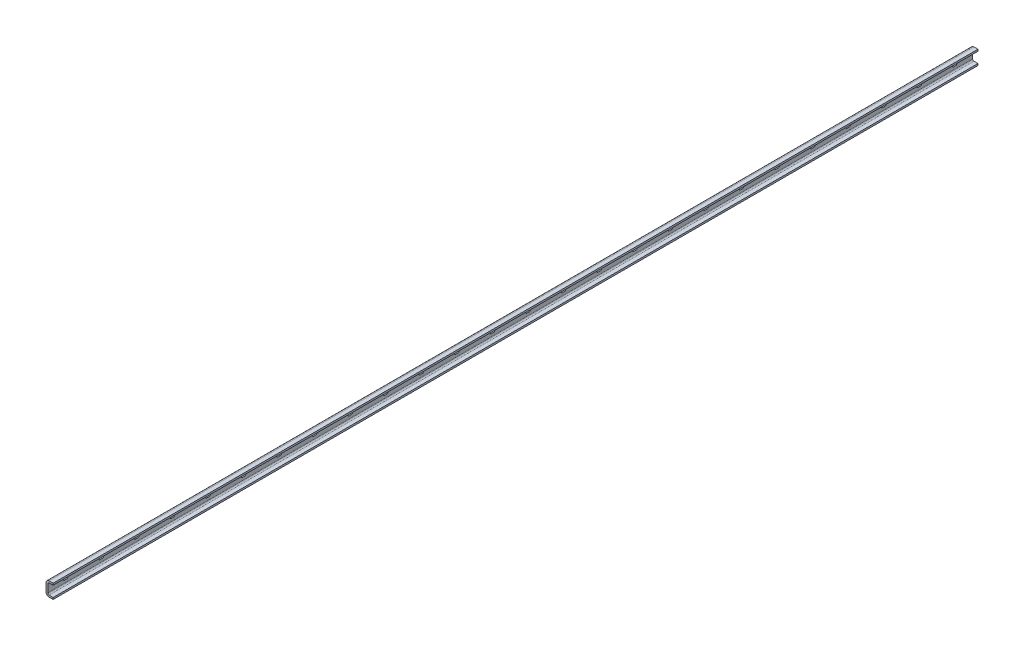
ISO-10303-21;
HEADER;
FILE_DESCRIPTION(('STEP AP214'),'2;1');
FILE_NAME('part.step','',(''),(''),'','','');
FILE_SCHEMA(('AUTOMOTIVE_DESIGN { 1 0 10303 214 1 1 1 1 }'));
ENDSEC;
DATA;
#1=APPLICATION_CONTEXT('core data for automotive mechanical design processes');
#2=APPLICATION_PROTOCOL_DEFINITION('international standard','automotive_design',2000,#1);
#3=PRODUCT_CONTEXT('',#1,'mechanical');
#4=PRODUCT('Part','Part','',(#3));
#5=PRODUCT_RELATED_PRODUCT_CATEGORY('part','',(#4));
#6=PRODUCT_DEFINITION_FORMATION('','',#4);
#7=PRODUCT_DEFINITION_CONTEXT('part definition',#1,'design');
#8=PRODUCT_DEFINITION('design','',#6,#7);
#9=PRODUCT_DEFINITION_SHAPE('','',#8);
#10=(LENGTH_UNIT() NAMED_UNIT(*) SI_UNIT(.MILLI.,.METRE.));
#11=(NAMED_UNIT(*) PLANE_ANGLE_UNIT() SI_UNIT($,.RADIAN.));
#12=(NAMED_UNIT(*) SI_UNIT($,.STERADIAN.) SOLID_ANGLE_UNIT());
#13=UNCERTAINTY_MEASURE_WITH_UNIT(LENGTH_MEASURE(1.E-05),#10,'distance_accuracy_value','');
#14=(GEOMETRIC_REPRESENTATION_CONTEXT(3) GLOBAL_UNCERTAINTY_ASSIGNED_CONTEXT((#13)) GLOBAL_UNIT_ASSIGNED_CONTEXT((#10,
#11,#12)) REPRESENTATION_CONTEXT('',''));
#15=CARTESIAN_POINT('',(0.,0.,0.));
#16=DIRECTION('',(0.,0.,1.));
#17=DIRECTION('',(1.,0.,0.));
#18=AXIS2_PLACEMENT_3D('',#15,#16,#17);
#19=CARTESIAN_POINT('',(7.,11.9,-2080.));
#20=DIRECTION('',(0.,-1.,0.));
#21=DIRECTION('',(0.,0.,-1.));
#22=AXIS2_PLACEMENT_3D('',#19,#20,#21);
#23=PLANE('',#22);
#24=DIRECTION('',(1.,0.,0.));
#25=VECTOR('',#24,1.);
#26=CARTESIAN_POINT('',(7.,11.9,0.));
#27=LINE('',#26,#25);
#28=CARTESIAN_POINT('',(7.,11.9,0.));
#29=VERTEX_POINT('',#28);
#30=CARTESIAN_POINT('',(16.,11.9,0.));
#31=VERTEX_POINT('',#30);
#32=EDGE_CURVE('E844',#29,#31,#27,.T.);
#33=ORIENTED_EDGE('',*,*,#32,.F.);
#34=DIRECTION('',(0.,0.,1.));
#35=VECTOR('',#34,1.);
#36=CARTESIAN_POINT('',(7.,11.9,-2080.));
#37=LINE('',#36,#35);
#38=CARTESIAN_POINT('',(7.,11.9,-2080.));
#39=VERTEX_POINT('',#38);
#40=EDGE_CURVE('E950',#39,#29,#37,.T.);
#41=ORIENTED_EDGE('',*,*,#40,.F.);
#42=DIRECTION('',(1.,0.,0.));
#43=VECTOR('',#42,1.);
#44=CARTESIAN_POINT('',(7.,11.9,-2080.));
#45=LINE('',#44,#43);
#46=CARTESIAN_POINT('',(16.,11.9,-2080.));
#47=VERTEX_POINT('',#46);
#48=EDGE_CURVE('E854',#39,#47,#45,.T.);
#49=ORIENTED_EDGE('',*,*,#48,.T.);
#50=DIRECTION('',(0.,0.,1.));
#51=VECTOR('',#50,1.);
#52=CARTESIAN_POINT('',(16.,11.9,-2080.));
#53=LINE('',#52,#51);
#54=EDGE_CURVE('E903',#47,#31,#53,.T.);
#55=ORIENTED_EDGE('',*,*,#54,.T.);
#56=EDGE_LOOP('',(#33,#41,#49,#55));
#57=FACE_BOUND('',#56,.T.);
#58=ADVANCED_FACE('F39',(#57),#23,.T.);
#59=CARTESIAN_POINT('',(7.00000000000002,8.89999999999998,-2080.));
#60=DIRECTION('',(0.,0.,1.));
#61=DIRECTION('',(1.,0.,0.));
#62=AXIS2_PLACEMENT_3D('',#59,#60,#61);
#63=CYLINDRICAL_SURFACE('',#62,3.00000000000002);
#64=CARTESIAN_POINT('',(7.00000000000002,8.89999999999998,0.));
#65=DIRECTION('',(0.,0.,-1.));
#66=DIRECTION('',(-1.,0.,0.));
#67=AXIS2_PLACEMENT_3D('',#64,#65,#66);
#68=CIRCLE('',#67,3.00000000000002);
#69=CARTESIAN_POINT('',(4.,8.89999999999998,0.));
#70=VERTEX_POINT('',#69);
#71=EDGE_CURVE('E859',#70,#29,#68,.T.);
#72=ORIENTED_EDGE('',*,*,#71,.F.);
#73=DIRECTION('',(0.,0.,1.));
#74=VECTOR('',#73,1.);
#75=CARTESIAN_POINT('',(4.,8.89999999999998,-2080.));
#76=LINE('',#75,#74);
#77=CARTESIAN_POINT('',(4.,8.89999999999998,-2080.));
#78=VERTEX_POINT('',#77);
#79=EDGE_CURVE('E954',#78,#70,#76,.T.);
#80=ORIENTED_EDGE('',*,*,#79,.F.);
#81=CARTESIAN_POINT('',(7.00000000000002,8.89999999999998,-2080.));
#82=DIRECTION('',(0.,0.,-1.));
#83=DIRECTION('',(-1.,0.,0.));
#84=AXIS2_PLACEMENT_3D('',#81,#82,#83);
#85=CIRCLE('',#84,3.00000000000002);
#86=EDGE_CURVE('E899',#78,#39,#85,.T.);
#87=ORIENTED_EDGE('',*,*,#86,.T.);
#88=ORIENTED_EDGE('',*,*,#40,.T.);
#89=EDGE_LOOP('',(#72,#80,#87,#88));
#90=FACE_BOUND('',#89,.T.);
#91=ADVANCED_FACE('F2048',(#90),#63,.F.);
#92=CARTESIAN_POINT('',(4.,-8.9,-2080.));
#93=DIRECTION('',(1.,0.,0.));
#94=DIRECTION('',(0.,0.,-1.));
#95=AXIS2_PLACEMENT_3D('',#92,#93,#94);
#96=PLANE('',#95);
#97=CARTESIAN_POINT('',(4.,0.,-117.5));
#98=DIRECTION('',(1.,0.,0.));
#99=DIRECTION('',(0.,0.,-1.));
#100=AXIS2_PLACEMENT_3D('',#97,#98,#99);
#101=CIRCLE('',#100,3.);
#102=CARTESIAN_POINT('',(4.,3.,-117.5));
#103=VERTEX_POINT('',#102);
#104=CARTESIAN_POINT('',(4.,-3.,-117.5));
#105=VERTEX_POINT('',#104);
#106=EDGE_CURVE('E802',#103,#105,#101,.T.);
#107=ORIENTED_EDGE('',*,*,#106,.F.);
#108=DIRECTION('',(0.,0.,1.));
#109=VECTOR('',#108,1.);
#110=CARTESIAN_POINT('',(4.,3.,-117.5));
#111=LINE('',#110,#109);
#112=CARTESIAN_POINT('',(4.,3.,-122.5));
#113=VERTEX_POINT('',#112);
#114=EDGE_CURVE('E779',#113,#103,#111,.T.);
#115=ORIENTED_EDGE('',*,*,#114,.F.);
#116=CARTESIAN_POINT('',(4.,0.,-122.5));
#117=DIRECTION('',(1.,0.,0.));
#118=DIRECTION('',(0.,0.,1.));
#119=AXIS2_PLACEMENT_3D('',#116,#117,#118);
#120=CIRCLE('',#119,3.);
#121=CARTESIAN_POINT('',(4.,-3.,-122.5));
#122=VERTEX_POINT('',#121);
#123=EDGE_CURVE('E770',#122,#113,#120,.T.);
#124=ORIENTED_EDGE('',*,*,#123,.F.);
#125=DIRECTION('',(0.,0.,-1.));
#126=VECTOR('',#125,1.);
#127=CARTESIAN_POINT('',(4.,-3.,-117.5));
#128=LINE('',#127,#126);
#129=EDGE_CURVE('E755',#105,#122,#128,.T.);
#130=ORIENTED_EDGE('',*,*,#129,.F.);
#131=EDGE_LOOP('',(#107,#115,#124,#130));
#132=FACE_BOUND('',#131,.T.);
#133=CARTESIAN_POINT('',(4.,0.,-37.5));
#134=DIRECTION('',(1.,0.,0.));
#135=DIRECTION('',(0.,0.,-1.));
#136=AXIS2_PLACEMENT_3D('',#133,#134,#135);
#137=CIRCLE('',#136,3.);
#138=CARTESIAN_POINT('',(4.,3.,-37.5));
#139=VERTEX_POINT('',#138);
#140=CARTESIAN_POINT('',(4.,-3.,-37.5000000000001));
#141=VERTEX_POINT('',#140);
#142=EDGE_CURVE('E809',#139,#141,#137,.T.);
#143=ORIENTED_EDGE('',*,*,#142,.F.);
#144=DIRECTION('',(0.,0.,1.));
#145=VECTOR('',#144,1.);
#146=CARTESIAN_POINT('',(4.,3.,-37.5));
#147=LINE('',#146,#145);
#148=CARTESIAN_POINT('',(4.,3.,-42.5));
#149=VERTEX_POINT('',#148);
#150=EDGE_CURVE('E815',#149,#139,#147,.T.);
#151=ORIENTED_EDGE('',*,*,#150,.F.);
#152=CARTESIAN_POINT('',(4.,0.,-42.5));
#153=DIRECTION('',(1.,0.,0.));
#154=DIRECTION('',(0.,0.,1.));
#155=AXIS2_PLACEMENT_3D('',#152,#153,#154);
#156=CIRCLE('',#155,3.);
#157=CARTESIAN_POINT('',(4.,-3.,-42.5));
#158=VERTEX_POINT('',#157);
#159=EDGE_CURVE('E834',#158,#149,#156,.T.);
#160=ORIENTED_EDGE('',*,*,#159,.F.);
#161=DIRECTION('',(0.,0.,-1.));
#162=VECTOR('',#161,1.);
#163=CARTESIAN_POINT('',(4.,-3.,-37.5));
#164=LINE('',#163,#162);
#165=EDGE_CURVE('E830',#141,#158,#164,.T.);
#166=ORIENTED_EDGE('',*,*,#165,.F.);
#167=EDGE_LOOP('',(#143,#151,#160,#166));
#168=FACE_BOUND('',#167,.T.);
#169=DIRECTION('',(0.,1.,0.));
#170=VECTOR('',#169,1.);
#171=CARTESIAN_POINT('',(4.,-8.9,0.));
#172=LINE('',#171,#170);
#173=CARTESIAN_POINT('',(4.,-8.9,0.));
#174=VERTEX_POINT('',#173);
#175=EDGE_CURVE('E943',#174,#70,#172,.T.);
#176=ORIENTED_EDGE('',*,*,#175,.F.);
#177=DIRECTION('',(0.,0.,1.));
#178=VECTOR('',#177,1.);
#179=CARTESIAN_POINT('',(4.,-8.9,-2080.));
#180=LINE('',#179,#178);
#181=CARTESIAN_POINT('',(4.,-8.9,-2080.));
#182=VERTEX_POINT('',#181);
#183=EDGE_CURVE('E957',#182,#174,#180,.T.);
#184=ORIENTED_EDGE('',*,*,#183,.F.);
#185=DIRECTION('',(0.,1.,0.));
#186=VECTOR('',#185,1.);
#187=CARTESIAN_POINT('',(4.,-8.9,-2080.));
#188=LINE('',#187,#186);
#189=EDGE_CURVE('E895',#182,#78,#188,.T.);
#190=ORIENTED_EDGE('',*,*,#189,.T.);
#191=ORIENTED_EDGE('',*,*,#79,.T.);
#192=EDGE_LOOP('',(#176,#184,#190,#191));
#193=FACE_BOUND('',#192,.T.);
#194=CARTESIAN_POINT('',(4.,0.,-197.5));
#195=DIRECTION('',(1.,0.,0.));
#196=DIRECTION('',(0.,0.,-1.));
#197=AXIS2_PLACEMENT_3D('',#194,#195,#196);
#198=CIRCLE('',#197,3.);
#199=CARTESIAN_POINT('',(4.,3.,-197.5));
#200=VERTEX_POINT('',#199);
#201=CARTESIAN_POINT('',(4.,-3.,-197.5));
#202=VERTEX_POINT('',#201);
#203=EDGE_CURVE('E953',#200,#202,#198,.T.);
#204=ORIENTED_EDGE('',*,*,#203,.F.);
#205=DIRECTION('',(0.,0.,1.));
#206=VECTOR('',#205,1.);
#207=CARTESIAN_POINT('',(4.,3.,-197.5));
#208=LINE('',#207,#206);
#209=CARTESIAN_POINT('',(4.,3.,-202.5));
#210=VERTEX_POINT('',#209);
#211=EDGE_CURVE('E988',#210,#200,#208,.T.);
#212=ORIENTED_EDGE('',*,*,#211,.F.);
#213=CARTESIAN_POINT('',(4.,0.,-202.5));
#214=DIRECTION('',(1.,0.,0.));
#215=DIRECTION('',(0.,0.,1.));
#216=AXIS2_PLACEMENT_3D('',#213,#214,#215);
#217=CIRCLE('',#216,3.);
#218=CARTESIAN_POINT('',(4.,-3.,-202.5));
#219=VERTEX_POINT('',#218);
#220=EDGE_CURVE('E992',#219,#210,#217,.T.);
#221=ORIENTED_EDGE('',*,*,#220,.F.);
#222=DIRECTION('',(0.,0.,-1.));
#223=VECTOR('',#222,1.);
#224=CARTESIAN_POINT('',(4.,-3.,-197.5));
#225=LINE('',#224,#223);
#226=EDGE_CURVE('E996',#202,#219,#225,.T.);
#227=ORIENTED_EDGE('',*,*,#226,.F.);
#228=EDGE_LOOP('',(#204,#212,#221,#227));
#229=FACE_BOUND('',#228,.T.);
#230=CARTESIAN_POINT('',(4.,0.,-277.5));
#231=DIRECTION('',(1.,0.,0.));
#232=DIRECTION('',(0.,0.,-1.));
#233=AXIS2_PLACEMENT_3D('',#230,#231,#232);
#234=CIRCLE('',#233,3.);
#235=CARTESIAN_POINT('',(4.,3.,-277.5));
#236=VERTEX_POINT('',#235);
#237=CARTESIAN_POINT('',(4.,-3.,-277.5));
#238=VERTEX_POINT('',#237);
#239=EDGE_CURVE('E1029',#236,#238,#234,.T.);
#240=ORIENTED_EDGE('',*,*,#239,.F.);
#241=DIRECTION('',(0.,0.,1.));
#242=VECTOR('',#241,1.);
#243=CARTESIAN_POINT('',(4.,3.,-277.5));
#244=LINE('',#243,#242);
#245=CARTESIAN_POINT('',(4.,3.,-282.5));
#246=VERTEX_POINT('',#245);
#247=EDGE_CURVE('E1032',#246,#236,#244,.T.);
#248=ORIENTED_EDGE('',*,*,#247,.F.);
#249=CARTESIAN_POINT('',(4.,0.,-282.5));
#250=DIRECTION('',(1.,0.,0.));
#251=DIRECTION('',(0.,0.,1.));
#252=AXIS2_PLACEMENT_3D('',#249,#250,#251);
#253=CIRCLE('',#252,3.);
#254=CARTESIAN_POINT('',(4.,-3.,-282.5));
#255=VERTEX_POINT('',#254);
#256=EDGE_CURVE('E1036',#255,#246,#253,.T.);
#257=ORIENTED_EDGE('',*,*,#256,.F.);
#258=DIRECTION('',(0.,0.,-1.));
#259=VECTOR('',#258,1.);
#260=CARTESIAN_POINT('',(4.,-3.,-277.5));
#261=LINE('',#260,#259);
#262=EDGE_CURVE('E1039',#238,#255,#261,.T.);
#263=ORIENTED_EDGE('',*,*,#262,.F.);
#264=EDGE_LOOP('',(#240,#248,#257,#263));
#265=FACE_BOUND('',#264,.T.);
#266=CARTESIAN_POINT('',(4.,0.,-357.5));
#267=DIRECTION('',(1.,0.,0.));
#268=DIRECTION('',(0.,0.,-1.));
#269=AXIS2_PLACEMENT_3D('',#266,#267,#268);
#270=CIRCLE('',#269,3.);
#271=CARTESIAN_POINT('',(4.,3.,-357.5));
#272=VERTEX_POINT('',#271);
#273=CARTESIAN_POINT('',(4.,-3.,-357.5));
#274=VERTEX_POINT('',#273);
#275=EDGE_CURVE('E1072',#272,#274,#270,.T.);
#276=ORIENTED_EDGE('',*,*,#275,.F.);
#277=DIRECTION('',(0.,0.,1.));
#278=VECTOR('',#277,1.);
#279=CARTESIAN_POINT('',(4.,3.,-357.5));
#280=LINE('',#279,#278);
#281=CARTESIAN_POINT('',(4.,3.,-362.5));
#282=VERTEX_POINT('',#281);
#283=EDGE_CURVE('E1075',#282,#272,#280,.T.);
#284=ORIENTED_EDGE('',*,*,#283,.F.);
#285=CARTESIAN_POINT('',(4.,0.,-362.5));
#286=DIRECTION('',(1.,0.,0.));
#287=DIRECTION('',(0.,0.,1.));
#288=AXIS2_PLACEMENT_3D('',#285,#286,#287);
#289=CIRCLE('',#288,3.);
#290=CARTESIAN_POINT('',(4.,-3.,-362.5));
#291=VERTEX_POINT('',#290);
#292=EDGE_CURVE('E1079',#291,#282,#289,.T.);
#293=ORIENTED_EDGE('',*,*,#292,.F.);
#294=DIRECTION('',(0.,0.,-1.));
#295=VECTOR('',#294,1.);
#296=CARTESIAN_POINT('',(4.,-3.,-357.5));
#297=LINE('',#296,#295);
#298=EDGE_CURVE('E1083',#274,#291,#297,.T.);
#299=ORIENTED_EDGE('',*,*,#298,.F.);
#300=EDGE_LOOP('',(#276,#284,#293,#299));
#301=FACE_BOUND('',#300,.T.);
#302=CARTESIAN_POINT('',(4.,0.,-437.5));
#303=DIRECTION('',(1.,0.,0.));
#304=DIRECTION('',(0.,0.,-1.));
#305=AXIS2_PLACEMENT_3D('',#302,#303,#304);
#306=CIRCLE('',#305,3.);
#307=CARTESIAN_POINT('',(4.,3.,-437.5));
#308=VERTEX_POINT('',#307);
#309=CARTESIAN_POINT('',(4.,-3.,-437.5));
#310=VERTEX_POINT('',#309);
#311=EDGE_CURVE('E1116',#308,#310,#306,.T.);
#312=ORIENTED_EDGE('',*,*,#311,.F.);
#313=DIRECTION('',(0.,0.,1.));
#314=VECTOR('',#313,1.);
#315=CARTESIAN_POINT('',(4.,3.,-437.5));
#316=LINE('',#315,#314);
#317=CARTESIAN_POINT('',(4.,3.,-442.5));
#318=VERTEX_POINT('',#317);
#319=EDGE_CURVE('E1119',#318,#308,#316,.T.);
#320=ORIENTED_EDGE('',*,*,#319,.F.);
#321=CARTESIAN_POINT('',(4.,0.,-442.5));
#322=DIRECTION('',(1.,0.,0.));
#323=DIRECTION('',(0.,0.,1.));
#324=AXIS2_PLACEMENT_3D('',#321,#322,#323);
#325=CIRCLE('',#324,3.);
#326=CARTESIAN_POINT('',(4.,-3.,-442.5));
#327=VERTEX_POINT('',#326);
#328=EDGE_CURVE('E1123',#327,#318,#325,.T.);
#329=ORIENTED_EDGE('',*,*,#328,.F.);
#330=DIRECTION('',(0.,0.,-1.));
#331=VECTOR('',#330,1.);
#332=CARTESIAN_POINT('',(4.,-3.,-437.5));
#333=LINE('',#332,#331);
#334=EDGE_CURVE('E1127',#310,#327,#333,.T.);
#335=ORIENTED_EDGE('',*,*,#334,.F.);
#336=EDGE_LOOP('',(#312,#320,#329,#335));
#337=FACE_BOUND('',#336,.T.);
#338=CARTESIAN_POINT('',(4.,0.,-517.5));
#339=DIRECTION('',(1.,0.,0.));
#340=DIRECTION('',(0.,0.,-1.));
#341=AXIS2_PLACEMENT_3D('',#338,#339,#340);
#342=CIRCLE('',#341,3.);
#343=CARTESIAN_POINT('',(4.,3.,-517.5));
#344=VERTEX_POINT('',#343);
#345=CARTESIAN_POINT('',(4.,-3.,-517.5));
#346=VERTEX_POINT('',#345);
#347=EDGE_CURVE('E1160',#344,#346,#342,.T.);
#348=ORIENTED_EDGE('',*,*,#347,.F.);
#349=DIRECTION('',(0.,0.,1.));
#350=VECTOR('',#349,1.);
#351=CARTESIAN_POINT('',(4.,3.,-517.5));
#352=LINE('',#351,#350);
#353=CARTESIAN_POINT('',(4.,3.,-522.5));
#354=VERTEX_POINT('',#353);
#355=EDGE_CURVE('E1163',#354,#344,#352,.T.);
#356=ORIENTED_EDGE('',*,*,#355,.F.);
#357=CARTESIAN_POINT('',(4.,0.,-522.5));
#358=DIRECTION('',(1.,0.,0.));
#359=DIRECTION('',(0.,0.,1.));
#360=AXIS2_PLACEMENT_3D('',#357,#358,#359);
#361=CIRCLE('',#360,3.);
#362=CARTESIAN_POINT('',(4.,-3.,-522.5));
#363=VERTEX_POINT('',#362);
#364=EDGE_CURVE('E1167',#363,#354,#361,.T.);
#365=ORIENTED_EDGE('',*,*,#364,.F.);
#366=DIRECTION('',(0.,0.,-1.));
#367=VECTOR('',#366,1.);
#368=CARTESIAN_POINT('',(4.,-3.,-517.5));
#369=LINE('',#368,#367);
#370=EDGE_CURVE('E1171',#346,#363,#369,.T.);
#371=ORIENTED_EDGE('',*,*,#370,.F.);
#372=EDGE_LOOP('',(#348,#356,#365,#371));
#373=FACE_BOUND('',#372,.T.);
#374=CARTESIAN_POINT('',(4.,0.,-597.5));
#375=DIRECTION('',(1.,0.,0.));
#376=DIRECTION('',(0.,0.,-1.));
#377=AXIS2_PLACEMENT_3D('',#374,#375,#376);
#378=CIRCLE('',#377,3.);
#379=CARTESIAN_POINT('',(4.,3.,-597.5));
#380=VERTEX_POINT('',#379);
#381=CARTESIAN_POINT('',(4.,-3.,-597.5));
#382=VERTEX_POINT('',#381);
#383=EDGE_CURVE('E1204',#380,#382,#378,.T.);
#384=ORIENTED_EDGE('',*,*,#383,.F.);
#385=DIRECTION('',(0.,0.,1.));
#386=VECTOR('',#385,1.);
#387=CARTESIAN_POINT('',(4.,3.,-597.5));
#388=LINE('',#387,#386);
#389=CARTESIAN_POINT('',(4.,3.,-602.5));
#390=VERTEX_POINT('',#389);
#391=EDGE_CURVE('E1207',#390,#380,#388,.T.);
#392=ORIENTED_EDGE('',*,*,#391,.F.);
#393=CARTESIAN_POINT('',(4.,0.,-602.5));
#394=DIRECTION('',(1.,0.,0.));
#395=DIRECTION('',(0.,0.,1.));
#396=AXIS2_PLACEMENT_3D('',#393,#394,#395);
#397=CIRCLE('',#396,3.);
#398=CARTESIAN_POINT('',(4.,-3.,-602.5));
#399=VERTEX_POINT('',#398);
#400=EDGE_CURVE('E1211',#399,#390,#397,.T.);
#401=ORIENTED_EDGE('',*,*,#400,.F.);
#402=DIRECTION('',(0.,0.,-1.));
#403=VECTOR('',#402,1.);
#404=CARTESIAN_POINT('',(4.,-3.,-597.5));
#405=LINE('',#404,#403);
#406=EDGE_CURVE('E1215',#382,#399,#405,.T.);
#407=ORIENTED_EDGE('',*,*,#406,.F.);
#408=EDGE_LOOP('',(#384,#392,#401,#407));
#409=FACE_BOUND('',#408,.T.);
#410=CARTESIAN_POINT('',(4.,0.,-677.5));
#411=DIRECTION('',(1.,0.,0.));
#412=DIRECTION('',(0.,0.,-1.));
#413=AXIS2_PLACEMENT_3D('',#410,#411,#412);
#414=CIRCLE('',#413,3.);
#415=CARTESIAN_POINT('',(4.,3.,-677.5));
#416=VERTEX_POINT('',#415);
#417=CARTESIAN_POINT('',(4.,-3.,-677.5));
#418=VERTEX_POINT('',#417);
#419=EDGE_CURVE('E1248',#416,#418,#414,.T.);
#420=ORIENTED_EDGE('',*,*,#419,.F.);
#421=DIRECTION('',(0.,0.,1.));
#422=VECTOR('',#421,1.);
#423=CARTESIAN_POINT('',(4.,3.,-677.5));
#424=LINE('',#423,#422);
#425=CARTESIAN_POINT('',(4.,3.,-682.5));
#426=VERTEX_POINT('',#425);
#427=EDGE_CURVE('E1251',#426,#416,#424,.T.);
#428=ORIENTED_EDGE('',*,*,#427,.F.);
#429=CARTESIAN_POINT('',(4.,0.,-682.5));
#430=DIRECTION('',(1.,0.,0.));
#431=DIRECTION('',(0.,0.,1.));
#432=AXIS2_PLACEMENT_3D('',#429,#430,#431);
#433=CIRCLE('',#432,3.);
#434=CARTESIAN_POINT('',(4.,-3.,-682.5));
#435=VERTEX_POINT('',#434);
#436=EDGE_CURVE('E1255',#435,#426,#433,.T.);
#437=ORIENTED_EDGE('',*,*,#436,.F.);
#438=DIRECTION('',(0.,0.,-1.));
#439=VECTOR('',#438,1.);
#440=CARTESIAN_POINT('',(4.,-3.,-677.5));
#441=LINE('',#440,#439);
#442=EDGE_CURVE('E1259',#418,#435,#441,.T.);
#443=ORIENTED_EDGE('',*,*,#442,.F.);
#444=EDGE_LOOP('',(#420,#428,#437,#443));
#445=FACE_BOUND('',#444,.T.);
#446=CARTESIAN_POINT('',(4.,0.,-757.5));
#447=DIRECTION('',(1.,0.,0.));
#448=DIRECTION('',(0.,0.,-1.));
#449=AXIS2_PLACEMENT_3D('',#446,#447,#448);
#450=CIRCLE('',#449,3.);
#451=CARTESIAN_POINT('',(4.,3.,-757.5));
#452=VERTEX_POINT('',#451);
#453=CARTESIAN_POINT('',(4.,-3.,-757.5));
#454=VERTEX_POINT('',#453);
#455=EDGE_CURVE('E1292',#452,#454,#450,.T.);
#456=ORIENTED_EDGE('',*,*,#455,.F.);
#457=DIRECTION('',(0.,0.,1.));
#458=VECTOR('',#457,1.);
#459=CARTESIAN_POINT('',(4.,3.,-757.5));
#460=LINE('',#459,#458);
#461=CARTESIAN_POINT('',(4.,3.,-762.5));
#462=VERTEX_POINT('',#461);
#463=EDGE_CURVE('E1295',#462,#452,#460,.T.);
#464=ORIENTED_EDGE('',*,*,#463,.F.);
#465=CARTESIAN_POINT('',(4.,0.,-762.5));
#466=DIRECTION('',(1.,0.,0.));
#467=DIRECTION('',(0.,0.,1.));
#468=AXIS2_PLACEMENT_3D('',#465,#466,#467);
#469=CIRCLE('',#468,3.);
#470=CARTESIAN_POINT('',(4.,-3.,-762.5));
#471=VERTEX_POINT('',#470);
#472=EDGE_CURVE('E1299',#471,#462,#469,.T.);
#473=ORIENTED_EDGE('',*,*,#472,.F.);
#474=DIRECTION('',(0.,0.,-1.));
#475=VECTOR('',#474,1.);
#476=CARTESIAN_POINT('',(4.,-3.,-757.5));
#477=LINE('',#476,#475);
#478=EDGE_CURVE('E1303',#454,#471,#477,.T.);
#479=ORIENTED_EDGE('',*,*,#478,.F.);
#480=EDGE_LOOP('',(#456,#464,#473,#479));
#481=FACE_BOUND('',#480,.T.);
#482=CARTESIAN_POINT('',(4.,0.,-837.5));
#483=DIRECTION('',(1.,0.,0.));
#484=DIRECTION('',(0.,0.,-1.));
#485=AXIS2_PLACEMENT_3D('',#482,#483,#484);
#486=CIRCLE('',#485,3.);
#487=CARTESIAN_POINT('',(4.,3.,-837.5));
#488=VERTEX_POINT('',#487);
#489=CARTESIAN_POINT('',(4.,-3.,-837.5));
#490=VERTEX_POINT('',#489);
#491=EDGE_CURVE('E1336',#488,#490,#486,.T.);
#492=ORIENTED_EDGE('',*,*,#491,.F.);
#493=DIRECTION('',(0.,0.,1.));
#494=VECTOR('',#493,1.);
#495=CARTESIAN_POINT('',(4.,3.,-837.5));
#496=LINE('',#495,#494);
#497=CARTESIAN_POINT('',(4.,3.,-842.5));
#498=VERTEX_POINT('',#497);
#499=EDGE_CURVE('E1339',#498,#488,#496,.T.);
#500=ORIENTED_EDGE('',*,*,#499,.F.);
#501=CARTESIAN_POINT('',(4.,0.,-842.5));
#502=DIRECTION('',(1.,0.,0.));
#503=DIRECTION('',(0.,0.,1.));
#504=AXIS2_PLACEMENT_3D('',#501,#502,#503);
#505=CIRCLE('',#504,3.);
#506=CARTESIAN_POINT('',(4.,-3.,-842.5));
#507=VERTEX_POINT('',#506);
#508=EDGE_CURVE('E1343',#507,#498,#505,.T.);
#509=ORIENTED_EDGE('',*,*,#508,.F.);
#510=DIRECTION('',(0.,0.,-1.));
#511=VECTOR('',#510,1.);
#512=CARTESIAN_POINT('',(4.,-3.,-837.5));
#513=LINE('',#512,#511);
#514=EDGE_CURVE('E1347',#490,#507,#513,.T.);
#515=ORIENTED_EDGE('',*,*,#514,.F.);
#516=EDGE_LOOP('',(#492,#500,#509,#515));
#517=FACE_BOUND('',#516,.T.);
#518=CARTESIAN_POINT('',(4.,0.,-917.5));
#519=DIRECTION('',(1.,0.,0.));
#520=DIRECTION('',(0.,0.,-1.));
#521=AXIS2_PLACEMENT_3D('',#518,#519,#520);
#522=CIRCLE('',#521,3.);
#523=CARTESIAN_POINT('',(4.,3.,-917.5));
#524=VERTEX_POINT('',#523);
#525=CARTESIAN_POINT('',(4.,-3.,-917.5));
#526=VERTEX_POINT('',#525);
#527=EDGE_CURVE('E1380',#524,#526,#522,.T.);
#528=ORIENTED_EDGE('',*,*,#527,.F.);
#529=DIRECTION('',(0.,0.,1.));
#530=VECTOR('',#529,1.);
#531=CARTESIAN_POINT('',(4.,3.,-917.5));
#532=LINE('',#531,#530);
#533=CARTESIAN_POINT('',(4.,3.,-922.5));
#534=VERTEX_POINT('',#533);
#535=EDGE_CURVE('E1383',#534,#524,#532,.T.);
#536=ORIENTED_EDGE('',*,*,#535,.F.);
#537=CARTESIAN_POINT('',(4.,0.,-922.5));
#538=DIRECTION('',(1.,0.,0.));
#539=DIRECTION('',(0.,0.,1.));
#540=AXIS2_PLACEMENT_3D('',#537,#538,#539);
#541=CIRCLE('',#540,3.);
#542=CARTESIAN_POINT('',(4.,-3.,-922.5));
#543=VERTEX_POINT('',#542);
#544=EDGE_CURVE('E1387',#543,#534,#541,.T.);
#545=ORIENTED_EDGE('',*,*,#544,.F.);
#546=DIRECTION('',(0.,0.,-1.));
#547=VECTOR('',#546,1.);
#548=CARTESIAN_POINT('',(4.,-3.,-917.5));
#549=LINE('',#548,#547);
#550=EDGE_CURVE('E1391',#526,#543,#549,.T.);
#551=ORIENTED_EDGE('',*,*,#550,.F.);
#552=EDGE_LOOP('',(#528,#536,#545,#551));
#553=FACE_BOUND('',#552,.T.);
#554=CARTESIAN_POINT('',(4.,0.,-997.5));
#555=DIRECTION('',(1.,0.,0.));
#556=DIRECTION('',(0.,0.,-1.));
#557=AXIS2_PLACEMENT_3D('',#554,#555,#556);
#558=CIRCLE('',#557,3.);
#559=CARTESIAN_POINT('',(4.,3.,-997.5));
#560=VERTEX_POINT('',#559);
#561=CARTESIAN_POINT('',(4.,-3.,-997.5));
#562=VERTEX_POINT('',#561);
#563=EDGE_CURVE('E1423',#560,#562,#558,.T.);
#564=ORIENTED_EDGE('',*,*,#563,.F.);
#565=DIRECTION('',(0.,0.,1.));
#566=VECTOR('',#565,1.);
#567=CARTESIAN_POINT('',(4.,3.,-997.5));
#568=LINE('',#567,#566);
#569=CARTESIAN_POINT('',(4.,3.,-1002.5));
#570=VERTEX_POINT('',#569);
#571=EDGE_CURVE('E1426',#570,#560,#568,.T.);
#572=ORIENTED_EDGE('',*,*,#571,.F.);
#573=CARTESIAN_POINT('',(4.,0.,-1002.5));
#574=DIRECTION('',(1.,0.,0.));
#575=DIRECTION('',(0.,0.,1.));
#576=AXIS2_PLACEMENT_3D('',#573,#574,#575);
#577=CIRCLE('',#576,3.);
#578=CARTESIAN_POINT('',(4.,-3.,-1002.5));
#579=VERTEX_POINT('',#578);
#580=EDGE_CURVE('E1430',#579,#570,#577,.T.);
#581=ORIENTED_EDGE('',*,*,#580,.F.);
#582=DIRECTION('',(0.,0.,-1.));
#583=VECTOR('',#582,1.);
#584=CARTESIAN_POINT('',(4.,-3.,-997.5));
#585=LINE('',#584,#583);
#586=EDGE_CURVE('E1434',#562,#579,#585,.T.);
#587=ORIENTED_EDGE('',*,*,#586,.F.);
#588=EDGE_LOOP('',(#564,#572,#581,#587));
#589=FACE_BOUND('',#588,.T.);
#590=CARTESIAN_POINT('',(4.,0.,-1077.5));
#591=DIRECTION('',(1.,0.,0.));
#592=DIRECTION('',(0.,0.,-1.));
#593=AXIS2_PLACEMENT_3D('',#590,#591,#592);
#594=CIRCLE('',#593,3.);
#595=CARTESIAN_POINT('',(4.,3.,-1077.5));
#596=VERTEX_POINT('',#595);
#597=CARTESIAN_POINT('',(4.,-3.,-1077.5));
#598=VERTEX_POINT('',#597);
#599=EDGE_CURVE('E1467',#596,#598,#594,.T.);
#600=ORIENTED_EDGE('',*,*,#599,.F.);
#601=DIRECTION('',(0.,0.,1.));
#602=VECTOR('',#601,1.);
#603=CARTESIAN_POINT('',(4.,3.,-1077.5));
#604=LINE('',#603,#602);
#605=CARTESIAN_POINT('',(4.,3.,-1082.5));
#606=VERTEX_POINT('',#605);
#607=EDGE_CURVE('E1470',#606,#596,#604,.T.);
#608=ORIENTED_EDGE('',*,*,#607,.F.);
#609=CARTESIAN_POINT('',(4.,0.,-1082.5));
#610=DIRECTION('',(1.,0.,0.));
#611=DIRECTION('',(0.,0.,1.));
#612=AXIS2_PLACEMENT_3D('',#609,#610,#611);
#613=CIRCLE('',#612,3.);
#614=CARTESIAN_POINT('',(4.,-3.,-1082.5));
#615=VERTEX_POINT('',#614);
#616=EDGE_CURVE('E1474',#615,#606,#613,.T.);
#617=ORIENTED_EDGE('',*,*,#616,.F.);
#618=DIRECTION('',(0.,0.,-1.));
#619=VECTOR('',#618,1.);
#620=CARTESIAN_POINT('',(4.,-3.,-1077.5));
#621=LINE('',#620,#619);
#622=EDGE_CURVE('E1478',#598,#615,#621,.T.);
#623=ORIENTED_EDGE('',*,*,#622,.F.);
#624=EDGE_LOOP('',(#600,#608,#617,#623));
#625=FACE_BOUND('',#624,.T.);
#626=CARTESIAN_POINT('',(4.,0.,-1157.5));
#627=DIRECTION('',(1.,0.,0.));
#628=DIRECTION('',(0.,0.,-1.));
#629=AXIS2_PLACEMENT_3D('',#626,#627,#628);
#630=CIRCLE('',#629,3.);
#631=CARTESIAN_POINT('',(4.,3.,-1157.5));
#632=VERTEX_POINT('',#631);
#633=CARTESIAN_POINT('',(4.,-3.,-1157.5));
#634=VERTEX_POINT('',#633);
#635=EDGE_CURVE('E1511',#632,#634,#630,.T.);
#636=ORIENTED_EDGE('',*,*,#635,.F.);
#637=DIRECTION('',(0.,0.,1.));
#638=VECTOR('',#637,1.);
#639=CARTESIAN_POINT('',(4.,3.,-1157.5));
#640=LINE('',#639,#638);
#641=CARTESIAN_POINT('',(4.,3.,-1162.5));
#642=VERTEX_POINT('',#641);
#643=EDGE_CURVE('E1514',#642,#632,#640,.T.);
#644=ORIENTED_EDGE('',*,*,#643,.F.);
#645=CARTESIAN_POINT('',(4.,0.,-1162.5));
#646=DIRECTION('',(1.,0.,0.));
#647=DIRECTION('',(0.,0.,1.));
#648=AXIS2_PLACEMENT_3D('',#645,#646,#647);
#649=CIRCLE('',#648,3.);
#650=CARTESIAN_POINT('',(4.,-3.,-1162.5));
#651=VERTEX_POINT('',#650);
#652=EDGE_CURVE('E1518',#651,#642,#649,.T.);
#653=ORIENTED_EDGE('',*,*,#652,.F.);
#654=DIRECTION('',(0.,0.,-1.));
#655=VECTOR('',#654,1.);
#656=CARTESIAN_POINT('',(4.,-3.,-1157.5));
#657=LINE('',#656,#655);
#658=EDGE_CURVE('E1522',#634,#651,#657,.T.);
#659=ORIENTED_EDGE('',*,*,#658,.F.);
#660=EDGE_LOOP('',(#636,#644,#653,#659));
#661=FACE_BOUND('',#660,.T.);
#662=CARTESIAN_POINT('',(4.,0.,-1237.5));
#663=DIRECTION('',(1.,0.,0.));
#664=DIRECTION('',(0.,0.,-1.));
#665=AXIS2_PLACEMENT_3D('',#662,#663,#664);
#666=CIRCLE('',#665,3.);
#667=CARTESIAN_POINT('',(4.,3.,-1237.5));
#668=VERTEX_POINT('',#667);
#669=CARTESIAN_POINT('',(4.,-3.,-1237.5));
#670=VERTEX_POINT('',#669);
#671=EDGE_CURVE('E1555',#668,#670,#666,.T.);
#672=ORIENTED_EDGE('',*,*,#671,.F.);
#673=DIRECTION('',(0.,0.,1.));
#674=VECTOR('',#673,1.);
#675=CARTESIAN_POINT('',(4.,3.,-1237.5));
#676=LINE('',#675,#674);
#677=CARTESIAN_POINT('',(4.,3.,-1242.5));
#678=VERTEX_POINT('',#677);
#679=EDGE_CURVE('E1558',#678,#668,#676,.T.);
#680=ORIENTED_EDGE('',*,*,#679,.F.);
#681=CARTESIAN_POINT('',(4.,0.,-1242.5));
#682=DIRECTION('',(1.,0.,0.));
#683=DIRECTION('',(0.,0.,1.));
#684=AXIS2_PLACEMENT_3D('',#681,#682,#683);
#685=CIRCLE('',#684,3.);
#686=CARTESIAN_POINT('',(4.,-3.,-1242.5));
#687=VERTEX_POINT('',#686);
#688=EDGE_CURVE('E1562',#687,#678,#685,.T.);
#689=ORIENTED_EDGE('',*,*,#688,.F.);
#690=DIRECTION('',(0.,0.,-1.));
#691=VECTOR('',#690,1.);
#692=CARTESIAN_POINT('',(4.,-3.,-1237.5));
#693=LINE('',#692,#691);
#694=EDGE_CURVE('E1566',#670,#687,#693,.T.);
#695=ORIENTED_EDGE('',*,*,#694,.F.);
#696=EDGE_LOOP('',(#672,#680,#689,#695));
#697=FACE_BOUND('',#696,.T.);
#698=CARTESIAN_POINT('',(4.,0.,-1317.5));
#699=DIRECTION('',(1.,0.,0.));
#700=DIRECTION('',(0.,0.,-1.));
#701=AXIS2_PLACEMENT_3D('',#698,#699,#700);
#702=CIRCLE('',#701,3.);
#703=CARTESIAN_POINT('',(4.,3.,-1317.5));
#704=VERTEX_POINT('',#703);
#705=CARTESIAN_POINT('',(4.,-3.,-1317.5));
#706=VERTEX_POINT('',#705);
#707=EDGE_CURVE('E1599',#704,#706,#702,.T.);
#708=ORIENTED_EDGE('',*,*,#707,.F.);
#709=DIRECTION('',(0.,0.,1.));
#710=VECTOR('',#709,1.);
#711=CARTESIAN_POINT('',(4.,3.,-1317.5));
#712=LINE('',#711,#710);
#713=CARTESIAN_POINT('',(4.,3.,-1322.5));
#714=VERTEX_POINT('',#713);
#715=EDGE_CURVE('E1602',#714,#704,#712,.T.);
#716=ORIENTED_EDGE('',*,*,#715,.F.);
#717=CARTESIAN_POINT('',(4.,0.,-1322.5));
#718=DIRECTION('',(1.,0.,0.));
#719=DIRECTION('',(0.,0.,1.));
#720=AXIS2_PLACEMENT_3D('',#717,#718,#719);
#721=CIRCLE('',#720,3.);
#722=CARTESIAN_POINT('',(4.,-3.,-1322.5));
#723=VERTEX_POINT('',#722);
#724=EDGE_CURVE('E1606',#723,#714,#721,.T.);
#725=ORIENTED_EDGE('',*,*,#724,.F.);
#726=DIRECTION('',(0.,0.,-1.));
#727=VECTOR('',#726,1.);
#728=CARTESIAN_POINT('',(4.,-3.,-1317.5));
#729=LINE('',#728,#727);
#730=EDGE_CURVE('E1610',#706,#723,#729,.T.);
#731=ORIENTED_EDGE('',*,*,#730,.F.);
#732=EDGE_LOOP('',(#708,#716,#725,#731));
#733=FACE_BOUND('',#732,.T.);
#734=CARTESIAN_POINT('',(4.,0.,-1397.5));
#735=DIRECTION('',(1.,0.,0.));
#736=DIRECTION('',(0.,0.,-1.));
#737=AXIS2_PLACEMENT_3D('',#734,#735,#736);
#738=CIRCLE('',#737,3.);
#739=CARTESIAN_POINT('',(4.,3.,-1397.5));
#740=VERTEX_POINT('',#739);
#741=CARTESIAN_POINT('',(4.,-3.,-1397.5));
#742=VERTEX_POINT('',#741);
#743=EDGE_CURVE('E1643',#740,#742,#738,.T.);
#744=ORIENTED_EDGE('',*,*,#743,.F.);
#745=DIRECTION('',(0.,0.,1.));
#746=VECTOR('',#745,1.);
#747=CARTESIAN_POINT('',(4.,3.,-1397.5));
#748=LINE('',#747,#746);
#749=CARTESIAN_POINT('',(4.,3.,-1402.5));
#750=VERTEX_POINT('',#749);
#751=EDGE_CURVE('E1646',#750,#740,#748,.T.);
#752=ORIENTED_EDGE('',*,*,#751,.F.);
#753=CARTESIAN_POINT('',(4.,0.,-1402.5));
#754=DIRECTION('',(1.,0.,0.));
#755=DIRECTION('',(0.,0.,1.));
#756=AXIS2_PLACEMENT_3D('',#753,#754,#755);
#757=CIRCLE('',#756,3.);
#758=CARTESIAN_POINT('',(4.,-3.,-1402.5));
#759=VERTEX_POINT('',#758);
#760=EDGE_CURVE('E1650',#759,#750,#757,.T.);
#761=ORIENTED_EDGE('',*,*,#760,.F.);
#762=DIRECTION('',(0.,0.,-1.));
#763=VECTOR('',#762,1.);
#764=CARTESIAN_POINT('',(4.,-3.,-1397.5));
#765=LINE('',#764,#763);
#766=EDGE_CURVE('E1654',#742,#759,#765,.T.);
#767=ORIENTED_EDGE('',*,*,#766,.F.);
#768=EDGE_LOOP('',(#744,#752,#761,#767));
#769=FACE_BOUND('',#768,.T.);
#770=CARTESIAN_POINT('',(4.,0.,-1477.5));
#771=DIRECTION('',(1.,0.,0.));
#772=DIRECTION('',(0.,0.,-1.));
#773=AXIS2_PLACEMENT_3D('',#770,#771,#772);
#774=CIRCLE('',#773,3.);
#775=CARTESIAN_POINT('',(4.,3.,-1477.5));
#776=VERTEX_POINT('',#775);
#777=CARTESIAN_POINT('',(4.,-3.,-1477.5));
#778=VERTEX_POINT('',#777);
#779=EDGE_CURVE('E1687',#776,#778,#774,.T.);
#780=ORIENTED_EDGE('',*,*,#779,.F.);
#781=DIRECTION('',(0.,0.,1.));
#782=VECTOR('',#781,1.);
#783=CARTESIAN_POINT('',(4.,3.,-1477.5));
#784=LINE('',#783,#782);
#785=CARTESIAN_POINT('',(4.,3.,-1482.5));
#786=VERTEX_POINT('',#785);
#787=EDGE_CURVE('E1690',#786,#776,#784,.T.);
#788=ORIENTED_EDGE('',*,*,#787,.F.);
#789=CARTESIAN_POINT('',(4.,0.,-1482.5));
#790=DIRECTION('',(1.,0.,0.));
#791=DIRECTION('',(0.,0.,1.));
#792=AXIS2_PLACEMENT_3D('',#789,#790,#791);
#793=CIRCLE('',#792,3.);
#794=CARTESIAN_POINT('',(4.,-3.,-1482.5));
#795=VERTEX_POINT('',#794);
#796=EDGE_CURVE('E1694',#795,#786,#793,.T.);
#797=ORIENTED_EDGE('',*,*,#796,.F.);
#798=DIRECTION('',(0.,0.,-1.));
#799=VECTOR('',#798,1.);
#800=CARTESIAN_POINT('',(4.,-3.,-1477.5));
#801=LINE('',#800,#799);
#802=EDGE_CURVE('E1698',#778,#795,#801,.T.);
#803=ORIENTED_EDGE('',*,*,#802,.F.);
#804=EDGE_LOOP('',(#780,#788,#797,#803));
#805=FACE_BOUND('',#804,.T.);
#806=CARTESIAN_POINT('',(4.,0.,-1557.5));
#807=DIRECTION('',(1.,0.,0.));
#808=DIRECTION('',(0.,0.,-1.));
#809=AXIS2_PLACEMENT_3D('',#806,#807,#808);
#810=CIRCLE('',#809,3.);
#811=CARTESIAN_POINT('',(4.,3.,-1557.5));
#812=VERTEX_POINT('',#811);
#813=CARTESIAN_POINT('',(4.,-3.,-1557.5));
#814=VERTEX_POINT('',#813);
#815=EDGE_CURVE('E1731',#812,#814,#810,.T.);
#816=ORIENTED_EDGE('',*,*,#815,.F.);
#817=DIRECTION('',(0.,0.,1.));
#818=VECTOR('',#817,1.);
#819=CARTESIAN_POINT('',(4.,3.,-1557.5));
#820=LINE('',#819,#818);
#821=CARTESIAN_POINT('',(4.,3.,-1562.5));
#822=VERTEX_POINT('',#821);
#823=EDGE_CURVE('E1734',#822,#812,#820,.T.);
#824=ORIENTED_EDGE('',*,*,#823,.F.);
#825=CARTESIAN_POINT('',(4.,0.,-1562.5));
#826=DIRECTION('',(1.,0.,0.));
#827=DIRECTION('',(0.,0.,1.));
#828=AXIS2_PLACEMENT_3D('',#825,#826,#827);
#829=CIRCLE('',#828,3.);
#830=CARTESIAN_POINT('',(4.,-3.,-1562.5));
#831=VERTEX_POINT('',#830);
#832=EDGE_CURVE('E1738',#831,#822,#829,.T.);
#833=ORIENTED_EDGE('',*,*,#832,.F.);
#834=DIRECTION('',(0.,0.,-1.));
#835=VECTOR('',#834,1.);
#836=CARTESIAN_POINT('',(4.,-3.,-1557.5));
#837=LINE('',#836,#835);
#838=EDGE_CURVE('E1742',#814,#831,#837,.T.);
#839=ORIENTED_EDGE('',*,*,#838,.F.);
#840=EDGE_LOOP('',(#816,#824,#833,#839));
#841=FACE_BOUND('',#840,.T.);
#842=CARTESIAN_POINT('',(4.,0.,-1637.5));
#843=DIRECTION('',(1.,0.,0.));
#844=DIRECTION('',(0.,0.,-1.));
#845=AXIS2_PLACEMENT_3D('',#842,#843,#844);
#846=CIRCLE('',#845,3.);
#847=CARTESIAN_POINT('',(4.,3.,-1637.5));
#848=VERTEX_POINT('',#847);
#849=CARTESIAN_POINT('',(4.,-3.,-1637.5));
#850=VERTEX_POINT('',#849);
#851=EDGE_CURVE('E1775',#848,#850,#846,.T.);
#852=ORIENTED_EDGE('',*,*,#851,.F.);
#853=DIRECTION('',(0.,0.,1.));
#854=VECTOR('',#853,1.);
#855=CARTESIAN_POINT('',(4.,3.,-1637.5));
#856=LINE('',#855,#854);
#857=CARTESIAN_POINT('',(4.,3.,-1642.5));
#858=VERTEX_POINT('',#857);
#859=EDGE_CURVE('E1778',#858,#848,#856,.T.);
#860=ORIENTED_EDGE('',*,*,#859,.F.);
#861=CARTESIAN_POINT('',(4.,0.,-1642.5));
#862=DIRECTION('',(1.,0.,0.));
#863=DIRECTION('',(0.,0.,1.));
#864=AXIS2_PLACEMENT_3D('',#861,#862,#863);
#865=CIRCLE('',#864,3.);
#866=CARTESIAN_POINT('',(4.,-3.,-1642.5));
#867=VERTEX_POINT('',#866);
#868=EDGE_CURVE('E1782',#867,#858,#865,.T.);
#869=ORIENTED_EDGE('',*,*,#868,.F.);
#870=DIRECTION('',(0.,0.,-1.));
#871=VECTOR('',#870,1.);
#872=CARTESIAN_POINT('',(4.,-3.,-1637.5));
#873=LINE('',#872,#871);
#874=EDGE_CURVE('E1786',#850,#867,#873,.T.);
#875=ORIENTED_EDGE('',*,*,#874,.F.);
#876=EDGE_LOOP('',(#852,#860,#869,#875));
#877=FACE_BOUND('',#876,.T.);
#878=CARTESIAN_POINT('',(4.,0.,-1717.5));
#879=DIRECTION('',(1.,0.,0.));
#880=DIRECTION('',(0.,0.,-1.));
#881=AXIS2_PLACEMENT_3D('',#878,#879,#880);
#882=CIRCLE('',#881,3.);
#883=CARTESIAN_POINT('',(4.,3.,-1717.5));
#884=VERTEX_POINT('',#883);
#885=CARTESIAN_POINT('',(4.,-3.,-1717.5));
#886=VERTEX_POINT('',#885);
#887=EDGE_CURVE('E1819',#884,#886,#882,.T.);
#888=ORIENTED_EDGE('',*,*,#887,.F.);
#889=DIRECTION('',(0.,0.,1.));
#890=VECTOR('',#889,1.);
#891=CARTESIAN_POINT('',(4.,3.,-1717.5));
#892=LINE('',#891,#890);
#893=CARTESIAN_POINT('',(4.,3.,-1722.5));
#894=VERTEX_POINT('',#893);
#895=EDGE_CURVE('E1822',#894,#884,#892,.T.);
#896=ORIENTED_EDGE('',*,*,#895,.F.);
#897=CARTESIAN_POINT('',(4.,0.,-1722.5));
#898=DIRECTION('',(1.,0.,0.));
#899=DIRECTION('',(0.,0.,1.));
#900=AXIS2_PLACEMENT_3D('',#897,#898,#899);
#901=CIRCLE('',#900,3.);
#902=CARTESIAN_POINT('',(4.,-3.,-1722.5));
#903=VERTEX_POINT('',#902);
#904=EDGE_CURVE('E1826',#903,#894,#901,.T.);
#905=ORIENTED_EDGE('',*,*,#904,.F.);
#906=DIRECTION('',(0.,0.,-1.));
#907=VECTOR('',#906,1.);
#908=CARTESIAN_POINT('',(4.,-3.,-1717.5));
#909=LINE('',#908,#907);
#910=EDGE_CURVE('E1830',#886,#903,#909,.T.);
#911=ORIENTED_EDGE('',*,*,#910,.F.);
#912=EDGE_LOOP('',(#888,#896,#905,#911));
#913=FACE_BOUND('',#912,.T.);
#914=CARTESIAN_POINT('',(4.,0.,-1797.5));
#915=DIRECTION('',(1.,0.,0.));
#916=DIRECTION('',(0.,0.,-1.));
#917=AXIS2_PLACEMENT_3D('',#914,#915,#916);
#918=CIRCLE('',#917,3.);
#919=CARTESIAN_POINT('',(4.,3.,-1797.5));
#920=VERTEX_POINT('',#919);
#921=CARTESIAN_POINT('',(4.,-3.,-1797.5));
#922=VERTEX_POINT('',#921);
#923=EDGE_CURVE('E1863',#920,#922,#918,.T.);
#924=ORIENTED_EDGE('',*,*,#923,.F.);
#925=DIRECTION('',(0.,0.,1.));
#926=VECTOR('',#925,1.);
#927=CARTESIAN_POINT('',(4.,3.,-1797.5));
#928=LINE('',#927,#926);
#929=CARTESIAN_POINT('',(4.,3.,-1802.5));
#930=VERTEX_POINT('',#929);
#931=EDGE_CURVE('E1866',#930,#920,#928,.T.);
#932=ORIENTED_EDGE('',*,*,#931,.F.);
#933=CARTESIAN_POINT('',(4.,0.,-1802.5));
#934=DIRECTION('',(1.,0.,0.));
#935=DIRECTION('',(0.,0.,1.));
#936=AXIS2_PLACEMENT_3D('',#933,#934,#935);
#937=CIRCLE('',#936,3.);
#938=CARTESIAN_POINT('',(4.,-3.,-1802.5));
#939=VERTEX_POINT('',#938);
#940=EDGE_CURVE('E1870',#939,#930,#937,.T.);
#941=ORIENTED_EDGE('',*,*,#940,.F.);
#942=DIRECTION('',(0.,0.,-1.));
#943=VECTOR('',#942,1.);
#944=CARTESIAN_POINT('',(4.,-3.,-1797.5));
#945=LINE('',#944,#943);
#946=EDGE_CURVE('E1874',#922,#939,#945,.T.);
#947=ORIENTED_EDGE('',*,*,#946,.F.);
#948=EDGE_LOOP('',(#924,#932,#941,#947));
#949=FACE_BOUND('',#948,.T.);
#950=CARTESIAN_POINT('',(4.,0.,-1877.5));
#951=DIRECTION('',(1.,0.,0.));
#952=DIRECTION('',(0.,0.,-1.));
#953=AXIS2_PLACEMENT_3D('',#950,#951,#952);
#954=CIRCLE('',#953,3.);
#955=CARTESIAN_POINT('',(4.,3.,-1877.5));
#956=VERTEX_POINT('',#955);
#957=CARTESIAN_POINT('',(4.,-3.,-1877.5));
#958=VERTEX_POINT('',#957);
#959=EDGE_CURVE('E1907',#956,#958,#954,.T.);
#960=ORIENTED_EDGE('',*,*,#959,.F.);
#961=DIRECTION('',(0.,0.,1.));
#962=VECTOR('',#961,1.);
#963=CARTESIAN_POINT('',(4.,3.,-1877.5));
#964=LINE('',#963,#962);
#965=CARTESIAN_POINT('',(4.,3.,-1882.5));
#966=VERTEX_POINT('',#965);
#967=EDGE_CURVE('E1910',#966,#956,#964,.T.);
#968=ORIENTED_EDGE('',*,*,#967,.F.);
#969=CARTESIAN_POINT('',(4.,0.,-1882.5));
#970=DIRECTION('',(1.,0.,0.));
#971=DIRECTION('',(0.,0.,1.));
#972=AXIS2_PLACEMENT_3D('',#969,#970,#971);
#973=CIRCLE('',#972,3.);
#974=CARTESIAN_POINT('',(4.,-3.,-1882.5));
#975=VERTEX_POINT('',#974);
#976=EDGE_CURVE('E1914',#975,#966,#973,.T.);
#977=ORIENTED_EDGE('',*,*,#976,.F.);
#978=DIRECTION('',(0.,0.,-1.));
#979=VECTOR('',#978,1.);
#980=CARTESIAN_POINT('',(4.,-3.,-1877.5));
#981=LINE('',#980,#979);
#982=EDGE_CURVE('E1918',#958,#975,#981,.T.);
#983=ORIENTED_EDGE('',*,*,#982,.F.);
#984=EDGE_LOOP('',(#960,#968,#977,#983));
#985=FACE_BOUND('',#984,.T.);
#986=CARTESIAN_POINT('',(4.,0.,-1957.5));
#987=DIRECTION('',(1.,0.,0.));
#988=DIRECTION('',(0.,0.,-1.));
#989=AXIS2_PLACEMENT_3D('',#986,#987,#988);
#990=CIRCLE('',#989,3.);
#991=CARTESIAN_POINT('',(4.,3.,-1957.5));
#992=VERTEX_POINT('',#991);
#993=CARTESIAN_POINT('',(4.,-3.,-1957.5));
#994=VERTEX_POINT('',#993);
#995=EDGE_CURVE('E1951',#992,#994,#990,.T.);
#996=ORIENTED_EDGE('',*,*,#995,.F.);
#997=DIRECTION('',(0.,0.,1.));
#998=VECTOR('',#997,1.);
#999=CARTESIAN_POINT('',(4.,3.,-1957.5));
#1000=LINE('',#999,#998);
#1001=CARTESIAN_POINT('',(4.,3.,-1962.5));
#1002=VERTEX_POINT('',#1001);
#1003=EDGE_CURVE('E1954',#1002,#992,#1000,.T.);
#1004=ORIENTED_EDGE('',*,*,#1003,.F.);
#1005=CARTESIAN_POINT('',(4.,0.,-1962.5));
#1006=DIRECTION('',(1.,0.,0.));
#1007=DIRECTION('',(0.,0.,1.));
#1008=AXIS2_PLACEMENT_3D('',#1005,#1006,#1007);
#1009=CIRCLE('',#1008,3.);
#1010=CARTESIAN_POINT('',(4.,-3.,-1962.5));
#1011=VERTEX_POINT('',#1010);
#1012=EDGE_CURVE('E1958',#1011,#1002,#1009,.T.);
#1013=ORIENTED_EDGE('',*,*,#1012,.F.);
#1014=DIRECTION('',(0.,0.,-1.));
#1015=VECTOR('',#1014,1.);
#1016=CARTESIAN_POINT('',(4.,-3.,-1957.5));
#1017=LINE('',#1016,#1015);
#1018=EDGE_CURVE('E1962',#994,#1011,#1017,.T.);
#1019=ORIENTED_EDGE('',*,*,#1018,.F.);
#1020=EDGE_LOOP('',(#996,#1004,#1013,#1019));
#1021=FACE_BOUND('',#1020,.T.);
#1022=CARTESIAN_POINT('',(4.,0.,-2037.5));
#1023=DIRECTION('',(1.,0.,0.));
#1024=DIRECTION('',(0.,0.,-1.));
#1025=AXIS2_PLACEMENT_3D('',#1022,#1023,#1024);
#1026=CIRCLE('',#1025,3.);
#1027=CARTESIAN_POINT('',(4.,3.,-2037.5));
#1028=VERTEX_POINT('',#1027);
#1029=CARTESIAN_POINT('',(4.,-3.,-2037.5));
#1030=VERTEX_POINT('',#1029);
#1031=EDGE_CURVE('E1995',#1028,#1030,#1026,.T.);
#1032=ORIENTED_EDGE('',*,*,#1031,.F.);
#1033=DIRECTION('',(0.,0.,1.));
#1034=VECTOR('',#1033,1.);
#1035=CARTESIAN_POINT('',(4.,3.,-2037.5));
#1036=LINE('',#1035,#1034);
#1037=CARTESIAN_POINT('',(4.,3.,-2042.5));
#1038=VERTEX_POINT('',#1037);
#1039=EDGE_CURVE('E1998',#1038,#1028,#1036,.T.);
#1040=ORIENTED_EDGE('',*,*,#1039,.F.);
#1041=CARTESIAN_POINT('',(4.,0.,-2042.5));
#1042=DIRECTION('',(1.,0.,0.));
#1043=DIRECTION('',(0.,0.,1.));
#1044=AXIS2_PLACEMENT_3D('',#1041,#1042,#1043);
#1045=CIRCLE('',#1044,3.);
#1046=CARTESIAN_POINT('',(4.,-3.,-2042.5));
#1047=VERTEX_POINT('',#1046);
#1048=EDGE_CURVE('E2002',#1047,#1038,#1045,.T.);
#1049=ORIENTED_EDGE('',*,*,#1048,.F.);
#1050=DIRECTION('',(0.,0.,-1.));
#1051=VECTOR('',#1050,1.);
#1052=CARTESIAN_POINT('',(4.,-3.,-2037.5));
#1053=LINE('',#1052,#1051);
#1054=EDGE_CURVE('E2006',#1030,#1047,#1053,.T.);
#1055=ORIENTED_EDGE('',*,*,#1054,.F.);
#1056=EDGE_LOOP('',(#1032,#1040,#1049,#1055));
#1057=FACE_BOUND('',#1056,.T.);
#1058=ADVANCED_FACE('F777',(#132,#168,#193,#229,#265,#301,#337,#373,#409,#445,#481,#517,#553,
#589,#625,#661,#697,#733,#769,#805,#841,#877,#913,#949,#985,#1021,#1057),#96,.T.);
#1059=CARTESIAN_POINT('',(7.,-8.9,-2080.));
#1060=DIRECTION('',(0.,0.,1.));
#1061=DIRECTION('',(1.,0.,0.));
#1062=AXIS2_PLACEMENT_3D('',#1059,#1060,#1061);
#1063=CYLINDRICAL_SURFACE('',#1062,3.);
#1064=CARTESIAN_POINT('',(7.,-8.9,0.));
#1065=DIRECTION('',(0.,0.,-1.));
#1066=DIRECTION('',(-1.,0.,0.));
#1067=AXIS2_PLACEMENT_3D('',#1064,#1065,#1066);
#1068=CIRCLE('',#1067,3.);
#1069=CARTESIAN_POINT('',(7.,-11.9,0.));
#1070=VERTEX_POINT('',#1069);
#1071=EDGE_CURVE('E939',#1070,#174,#1068,.T.);
#1072=ORIENTED_EDGE('',*,*,#1071,.F.);
#1073=DIRECTION('',(0.,0.,1.));
#1074=VECTOR('',#1073,1.);
#1075=CARTESIAN_POINT('',(7.,-11.9,-2080.));
#1076=LINE('',#1075,#1074);
#1077=CARTESIAN_POINT('',(7.,-11.9,-2080.));
#1078=VERTEX_POINT('',#1077);
#1079=EDGE_CURVE('E960',#1078,#1070,#1076,.T.);
#1080=ORIENTED_EDGE('',*,*,#1079,.F.);
#1081=CARTESIAN_POINT('',(7.,-8.9,-2080.));
#1082=DIRECTION('',(0.,0.,-1.));
#1083=DIRECTION('',(-1.,0.,0.));
#1084=AXIS2_PLACEMENT_3D('',#1081,#1082,#1083);
#1085=CIRCLE('',#1084,3.);
#1086=EDGE_CURVE('E891',#1078,#182,#1085,.T.);
#1087=ORIENTED_EDGE('',*,*,#1086,.T.);
#1088=ORIENTED_EDGE('',*,*,#183,.T.);
#1089=EDGE_LOOP('',(#1072,#1080,#1087,#1088));
#1090=FACE_BOUND('',#1089,.T.);
#1091=ADVANCED_FACE('F2441',(#1090),#1063,.F.);
#1092=CARTESIAN_POINT('',(16.,-11.9,-2080.));
#1093=DIRECTION('',(0.,1.,0.));
#1094=DIRECTION('',(0.,0.,1.));
#1095=AXIS2_PLACEMENT_3D('',#1092,#1093,#1094);
#1096=PLANE('',#1095);
#1097=DIRECTION('',(-1.,0.,0.));
#1098=VECTOR('',#1097,1.);
#1099=CARTESIAN_POINT('',(16.,-11.9,0.));
#1100=LINE('',#1099,#1098);
#1101=CARTESIAN_POINT('',(16.,-11.9,0.));
#1102=VERTEX_POINT('',#1101);
#1103=EDGE_CURVE('E935',#1102,#1070,#1100,.T.);
#1104=ORIENTED_EDGE('',*,*,#1103,.F.);
#1105=DIRECTION('',(0.,0.,1.));
#1106=VECTOR('',#1105,1.);
#1107=CARTESIAN_POINT('',(16.,-11.9,-2080.));
#1108=LINE('',#1107,#1106);
#1109=CARTESIAN_POINT('',(16.,-11.9,-2080.));
#1110=VERTEX_POINT('',#1109);
#1111=EDGE_CURVE('E963',#1110,#1102,#1108,.T.);
#1112=ORIENTED_EDGE('',*,*,#1111,.F.);
#1113=DIRECTION('',(-1.,0.,0.));
#1114=VECTOR('',#1113,1.);
#1115=CARTESIAN_POINT('',(16.,-11.9,-2080.));
#1116=LINE('',#1115,#1114);
#1117=EDGE_CURVE('E887',#1110,#1078,#1116,.T.);
#1118=ORIENTED_EDGE('',*,*,#1117,.T.);
#1119=ORIENTED_EDGE('',*,*,#1079,.T.);
#1120=EDGE_LOOP('',(#1104,#1112,#1118,#1119));
#1121=FACE_BOUND('',#1120,.T.);
#1122=ADVANCED_FACE('F2446',(#1121),#1096,.T.);
#1123=CARTESIAN_POINT('',(16.,-15.9,-2080.));
#1124=DIRECTION('',(1.,0.,0.));
#1125=DIRECTION('',(0.,0.,-1.));
#1126=AXIS2_PLACEMENT_3D('',#1123,#1124,#1125);
#1127=PLANE('',#1126);
#1128=DIRECTION('',(0.,1.,0.));
#1129=VECTOR('',#1128,1.);
#1130=CARTESIAN_POINT('',(16.,-15.9,0.));
#1131=LINE('',#1130,#1129);
#1132=CARTESIAN_POINT('',(16.,-15.9,0.));
#1133=VERTEX_POINT('',#1132);
#1134=EDGE_CURVE('E931',#1133,#1102,#1131,.T.);
#1135=ORIENTED_EDGE('',*,*,#1134,.F.);
#1136=DIRECTION('',(0.,0.,1.));
#1137=VECTOR('',#1136,1.);
#1138=CARTESIAN_POINT('',(16.,-15.9,-2080.));
#1139=LINE('',#1138,#1137);
#1140=CARTESIAN_POINT('',(16.,-15.9,-2080.));
#1141=VERTEX_POINT('',#1140);
#1142=EDGE_CURVE('E966',#1141,#1133,#1139,.T.);
#1143=ORIENTED_EDGE('',*,*,#1142,.F.);
#1144=DIRECTION('',(0.,1.,0.));
#1145=VECTOR('',#1144,1.);
#1146=CARTESIAN_POINT('',(16.,-15.9,-2080.));
#1147=LINE('',#1146,#1145);
#1148=EDGE_CURVE('E883',#1141,#1110,#1147,.T.);
#1149=ORIENTED_EDGE('',*,*,#1148,.T.);
#1150=ORIENTED_EDGE('',*,*,#1111,.T.);
#1151=EDGE_LOOP('',(#1135,#1143,#1149,#1150));
#1152=FACE_BOUND('',#1151,.T.);
#1153=ADVANCED_FACE('F2453',(#1152),#1127,.T.);
#1154=CARTESIAN_POINT('',(7.,-15.9,-2080.));
#1155=DIRECTION('',(0.,-1.,0.));
#1156=DIRECTION('',(0.,0.,-1.));
#1157=AXIS2_PLACEMENT_3D('',#1154,#1155,#1156);
#1158=PLANE('',#1157);
#1159=DIRECTION('',(1.,0.,0.));
#1160=VECTOR('',#1159,1.);
#1161=CARTESIAN_POINT('',(7.,-15.9,0.));
#1162=LINE('',#1161,#1160);
#1163=CARTESIAN_POINT('',(7.,-15.9,0.));
#1164=VERTEX_POINT('',#1163);
#1165=EDGE_CURVE('E927',#1164,#1133,#1162,.T.);
#1166=ORIENTED_EDGE('',*,*,#1165,.F.);
#1167=DIRECTION('',(0.,0.,1.));
#1168=VECTOR('',#1167,1.);
#1169=CARTESIAN_POINT('',(7.,-15.9,-2080.));
#1170=LINE('',#1169,#1168);
#1171=CARTESIAN_POINT('',(7.,-15.9,-2080.));
#1172=VERTEX_POINT('',#1171);
#1173=EDGE_CURVE('E969',#1172,#1164,#1170,.T.);
#1174=ORIENTED_EDGE('',*,*,#1173,.F.);
#1175=DIRECTION('',(1.,0.,0.));
#1176=VECTOR('',#1175,1.);
#1177=CARTESIAN_POINT('',(7.,-15.9,-2080.));
#1178=LINE('',#1177,#1176);
#1179=EDGE_CURVE('E879',#1172,#1141,#1178,.T.);
#1180=ORIENTED_EDGE('',*,*,#1179,.T.);
#1181=ORIENTED_EDGE('',*,*,#1142,.T.);
#1182=EDGE_LOOP('',(#1166,#1174,#1180,#1181));
#1183=FACE_BOUND('',#1182,.T.);
#1184=ADVANCED_FACE('F2457',(#1183),#1158,.T.);
#1185=CARTESIAN_POINT('',(6.99999999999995,-8.90000000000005,-2080.));
#1186=DIRECTION('',(0.,0.,1.));
#1187=DIRECTION('',(1.,0.,0.));
#1188=AXIS2_PLACEMENT_3D('',#1185,#1186,#1187);
#1189=CYLINDRICAL_SURFACE('',#1188,6.99999999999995);
#1190=CARTESIAN_POINT('',(6.99999999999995,-8.90000000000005,0.));
#1191=DIRECTION('',(0.,0.,1.));
#1192=DIRECTION('',(1.,0.,0.));
#1193=AXIS2_PLACEMENT_3D('',#1190,#1191,#1192);
#1194=CIRCLE('',#1193,6.99999999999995);
#1195=CARTESIAN_POINT('',(0.,-8.90000000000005,0.));
#1196=VERTEX_POINT('',#1195);
#1197=EDGE_CURVE('E923',#1196,#1164,#1194,.T.);
#1198=ORIENTED_EDGE('',*,*,#1197,.F.);
#1199=DIRECTION('',(0.,0.,1.));
#1200=VECTOR('',#1199,1.);
#1201=CARTESIAN_POINT('',(0.,-8.90000000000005,-2080.));
#1202=LINE('',#1201,#1200);
#1203=CARTESIAN_POINT('',(0.,-8.90000000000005,-2080.));
#1204=VERTEX_POINT('',#1203);
#1205=EDGE_CURVE('E972',#1204,#1196,#1202,.T.);
#1206=ORIENTED_EDGE('',*,*,#1205,.F.);
#1207=CARTESIAN_POINT('',(6.99999999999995,-8.90000000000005,-2080.));
#1208=DIRECTION('',(0.,0.,1.));
#1209=DIRECTION('',(1.,0.,0.));
#1210=AXIS2_PLACEMENT_3D('',#1207,#1208,#1209);
#1211=CIRCLE('',#1210,6.99999999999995);
#1212=EDGE_CURVE('E875',#1204,#1172,#1211,.T.);
#1213=ORIENTED_EDGE('',*,*,#1212,.T.);
#1214=ORIENTED_EDGE('',*,*,#1173,.T.);
#1215=EDGE_LOOP('',(#1198,#1206,#1213,#1214));
#1216=FACE_BOUND('',#1215,.T.);
#1217=ADVANCED_FACE('F2461',(#1216),#1189,.T.);
#1218=CARTESIAN_POINT('',(0.,8.9,-2080.));
#1219=DIRECTION('',(-1.,0.,0.));
#1220=DIRECTION('',(0.,-1.,0.));
#1221=AXIS2_PLACEMENT_3D('',#1218,#1219,#1220);
#1222=PLANE('',#1221);
#1223=CARTESIAN_POINT('',(0.,0.,-117.5));
#1224=DIRECTION('',(1.,0.,0.));
#1225=DIRECTION('',(0.,0.,-1.));
#1226=AXIS2_PLACEMENT_3D('',#1223,#1224,#1225);
#1227=CIRCLE('',#1226,3.);
#1228=CARTESIAN_POINT('',(0.,3.,-117.5));
#1229=VERTEX_POINT('',#1228);
#1230=CARTESIAN_POINT('',(0.,-3.,-117.5));
#1231=VERTEX_POINT('',#1230);
#1232=EDGE_CURVE('E805',#1229,#1231,#1227,.T.);
#1233=ORIENTED_EDGE('',*,*,#1232,.T.);
#1234=DIRECTION('',(0.,0.,-1.));
#1235=VECTOR('',#1234,1.);
#1236=CARTESIAN_POINT('',(0.,-3.,-117.5));
#1237=LINE('',#1236,#1235);
#1238=CARTESIAN_POINT('',(0.,-3.,-122.5));
#1239=VERTEX_POINT('',#1238);
#1240=EDGE_CURVE('E766',#1231,#1239,#1237,.T.);
#1241=ORIENTED_EDGE('',*,*,#1240,.T.);
#1242=CARTESIAN_POINT('',(0.,0.,-122.5));
#1243=DIRECTION('',(1.,0.,0.));
#1244=DIRECTION('',(0.,0.,1.));
#1245=AXIS2_PLACEMENT_3D('',#1242,#1243,#1244);
#1246=CIRCLE('',#1245,3.);
#1247=CARTESIAN_POINT('',(0.,3.,-122.5));
#1248=VERTEX_POINT('',#1247);
#1249=EDGE_CURVE('E773',#1239,#1248,#1246,.T.);
#1250=ORIENTED_EDGE('',*,*,#1249,.T.);
#1251=DIRECTION('',(0.,0.,1.));
#1252=VECTOR('',#1251,1.);
#1253=CARTESIAN_POINT('',(0.,3.,-117.5));
#1254=LINE('',#1253,#1252);
#1255=EDGE_CURVE('E798',#1248,#1229,#1254,.T.);
#1256=ORIENTED_EDGE('',*,*,#1255,.T.);
#1257=EDGE_LOOP('',(#1233,#1241,#1250,#1256));
#1258=FACE_BOUND('',#1257,.T.);
#1259=CARTESIAN_POINT('',(0.,0.,-37.5));
#1260=DIRECTION('',(1.,0.,0.));
#1261=DIRECTION('',(0.,0.,-1.));
#1262=AXIS2_PLACEMENT_3D('',#1259,#1260,#1261);
#1263=CIRCLE('',#1262,3.);
#1264=CARTESIAN_POINT('',(0.,3.,-37.5));
#1265=VERTEX_POINT('',#1264);
#1266=CARTESIAN_POINT('',(0.,-3.,-37.5));
#1267=VERTEX_POINT('',#1266);
#1268=EDGE_CURVE('E810',#1265,#1267,#1263,.T.);
#1269=ORIENTED_EDGE('',*,*,#1268,.T.);
#1270=DIRECTION('',(0.,0.,-1.));
#1271=VECTOR('',#1270,1.);
#1272=CARTESIAN_POINT('',(0.,-3.,-37.5));
#1273=LINE('',#1272,#1271);
#1274=CARTESIAN_POINT('',(0.,-3.,-42.5));
#1275=VERTEX_POINT('',#1274);
#1276=EDGE_CURVE('E814',#1267,#1275,#1273,.T.);
#1277=ORIENTED_EDGE('',*,*,#1276,.T.);
#1278=CARTESIAN_POINT('',(0.,0.,-42.5));
#1279=DIRECTION('',(1.,0.,0.));
#1280=DIRECTION('',(0.,0.,1.));
#1281=AXIS2_PLACEMENT_3D('',#1278,#1279,#1280);
#1282=CIRCLE('',#1281,3.);
#1283=CARTESIAN_POINT('',(0.,3.,-42.5));
#1284=VERTEX_POINT('',#1283);
#1285=EDGE_CURVE('E819',#1275,#1284,#1282,.T.);
#1286=ORIENTED_EDGE('',*,*,#1285,.T.);
#1287=DIRECTION('',(0.,0.,1.));
#1288=VECTOR('',#1287,1.);
#1289=CARTESIAN_POINT('',(0.,3.,-37.5));
#1290=LINE('',#1289,#1288);
#1291=EDGE_CURVE('E823',#1284,#1265,#1290,.T.);
#1292=ORIENTED_EDGE('',*,*,#1291,.T.);
#1293=EDGE_LOOP('',(#1269,#1277,#1286,#1292));
#1294=FACE_BOUND('',#1293,.T.);
#1295=DIRECTION('',(0.,-1.,0.));
#1296=VECTOR('',#1295,1.);
#1297=CARTESIAN_POINT('',(0.,8.9,0.));
#1298=LINE('',#1297,#1296);
#1299=CARTESIAN_POINT('',(0.,8.9,0.));
#1300=VERTEX_POINT('',#1299);
#1301=EDGE_CURVE('E919',#1300,#1196,#1298,.T.);
#1302=ORIENTED_EDGE('',*,*,#1301,.F.);
#1303=DIRECTION('',(0.,0.,1.));
#1304=VECTOR('',#1303,1.);
#1305=CARTESIAN_POINT('',(0.,8.9,-2080.));
#1306=LINE('',#1305,#1304);
#1307=CARTESIAN_POINT('',(0.,8.9,-2080.));
#1308=VERTEX_POINT('',#1307);
#1309=EDGE_CURVE('E975',#1308,#1300,#1306,.T.);
#1310=ORIENTED_EDGE('',*,*,#1309,.F.);
#1311=DIRECTION('',(0.,-1.,0.));
#1312=VECTOR('',#1311,1.);
#1313=CARTESIAN_POINT('',(0.,8.9,-2080.));
#1314=LINE('',#1313,#1312);
#1315=EDGE_CURVE('E871',#1308,#1204,#1314,.T.);
#1316=ORIENTED_EDGE('',*,*,#1315,.T.);
#1317=ORIENTED_EDGE('',*,*,#1205,.T.);
#1318=EDGE_LOOP('',(#1302,#1310,#1316,#1317));
#1319=FACE_BOUND('',#1318,.T.);
#1320=CARTESIAN_POINT('',(0.,0.,-197.5));
#1321=DIRECTION('',(1.,0.,0.));
#1322=DIRECTION('',(0.,0.,-1.));
#1323=AXIS2_PLACEMENT_3D('',#1320,#1321,#1322);
#1324=CIRCLE('',#1323,3.);
#1325=CARTESIAN_POINT('',(0.,3.,-197.5));
#1326=VERTEX_POINT('',#1325);
#1327=CARTESIAN_POINT('',(0.,-3.,-197.5));
#1328=VERTEX_POINT('',#1327);
#1329=EDGE_CURVE('E1000',#1326,#1328,#1324,.T.);
#1330=ORIENTED_EDGE('',*,*,#1329,.T.);
#1331=DIRECTION('',(0.,0.,-1.));
#1332=VECTOR('',#1331,1.);
#1333=CARTESIAN_POINT('',(0.,-3.,-197.5));
#1334=LINE('',#1333,#1332);
#1335=CARTESIAN_POINT('',(0.,-3.,-202.5));
#1336=VERTEX_POINT('',#1335);
#1337=EDGE_CURVE('E1003',#1328,#1336,#1334,.T.);
#1338=ORIENTED_EDGE('',*,*,#1337,.T.);
#1339=CARTESIAN_POINT('',(0.,0.,-202.5));
#1340=DIRECTION('',(1.,0.,0.));
#1341=DIRECTION('',(0.,0.,1.));
#1342=AXIS2_PLACEMENT_3D('',#1339,#1340,#1341);
#1343=CIRCLE('',#1342,3.);
#1344=CARTESIAN_POINT('',(0.,3.,-202.5));
#1345=VERTEX_POINT('',#1344);
#1346=EDGE_CURVE('E1006',#1336,#1345,#1343,.T.);
#1347=ORIENTED_EDGE('',*,*,#1346,.T.);
#1348=DIRECTION('',(0.,0.,1.));
#1349=VECTOR('',#1348,1.);
#1350=CARTESIAN_POINT('',(0.,3.,-197.5));
#1351=LINE('',#1350,#1349);
#1352=EDGE_CURVE('E1009',#1345,#1326,#1351,.T.);
#1353=ORIENTED_EDGE('',*,*,#1352,.T.);
#1354=EDGE_LOOP('',(#1330,#1338,#1347,#1353));
#1355=FACE_BOUND('',#1354,.T.);
#1356=CARTESIAN_POINT('',(0.,0.,-277.5));
#1357=DIRECTION('',(1.,0.,0.));
#1358=DIRECTION('',(0.,0.,-1.));
#1359=AXIS2_PLACEMENT_3D('',#1356,#1357,#1358);
#1360=CIRCLE('',#1359,3.);
#1361=CARTESIAN_POINT('',(0.,3.,-277.5));
#1362=VERTEX_POINT('',#1361);
#1363=CARTESIAN_POINT('',(0.,-3.,-277.5));
#1364=VERTEX_POINT('',#1363);
#1365=EDGE_CURVE('E1043',#1362,#1364,#1360,.T.);
#1366=ORIENTED_EDGE('',*,*,#1365,.T.);
#1367=DIRECTION('',(0.,0.,-1.));
#1368=VECTOR('',#1367,1.);
#1369=CARTESIAN_POINT('',(0.,-3.,-277.5));
#1370=LINE('',#1369,#1368);
#1371=CARTESIAN_POINT('',(0.,-3.,-282.5));
#1372=VERTEX_POINT('',#1371);
#1373=EDGE_CURVE('E1046',#1364,#1372,#1370,.T.);
#1374=ORIENTED_EDGE('',*,*,#1373,.T.);
#1375=CARTESIAN_POINT('',(0.,0.,-282.5));
#1376=DIRECTION('',(1.,0.,0.));
#1377=DIRECTION('',(0.,0.,1.));
#1378=AXIS2_PLACEMENT_3D('',#1375,#1376,#1377);
#1379=CIRCLE('',#1378,3.);
#1380=CARTESIAN_POINT('',(0.,3.,-282.5));
#1381=VERTEX_POINT('',#1380);
#1382=EDGE_CURVE('E1049',#1372,#1381,#1379,.T.);
#1383=ORIENTED_EDGE('',*,*,#1382,.T.);
#1384=DIRECTION('',(0.,0.,1.));
#1385=VECTOR('',#1384,1.);
#1386=CARTESIAN_POINT('',(0.,3.,-277.5));
#1387=LINE('',#1386,#1385);
#1388=EDGE_CURVE('E1052',#1381,#1362,#1387,.T.);
#1389=ORIENTED_EDGE('',*,*,#1388,.T.);
#1390=EDGE_LOOP('',(#1366,#1374,#1383,#1389));
#1391=FACE_BOUND('',#1390,.T.);
#1392=CARTESIAN_POINT('',(0.,0.,-357.5));
#1393=DIRECTION('',(1.,0.,0.));
#1394=DIRECTION('',(0.,0.,-1.));
#1395=AXIS2_PLACEMENT_3D('',#1392,#1393,#1394);
#1396=CIRCLE('',#1395,3.);
#1397=CARTESIAN_POINT('',(0.,3.,-357.5));
#1398=VERTEX_POINT('',#1397);
#1399=CARTESIAN_POINT('',(0.,-3.,-357.5));
#1400=VERTEX_POINT('',#1399);
#1401=EDGE_CURVE('E1087',#1398,#1400,#1396,.T.);
#1402=ORIENTED_EDGE('',*,*,#1401,.T.);
#1403=DIRECTION('',(0.,0.,-1.));
#1404=VECTOR('',#1403,1.);
#1405=CARTESIAN_POINT('',(0.,-3.,-357.5));
#1406=LINE('',#1405,#1404);
#1407=CARTESIAN_POINT('',(0.,-3.,-362.5));
#1408=VERTEX_POINT('',#1407);
#1409=EDGE_CURVE('E1090',#1400,#1408,#1406,.T.);
#1410=ORIENTED_EDGE('',*,*,#1409,.T.);
#1411=CARTESIAN_POINT('',(0.,0.,-362.5));
#1412=DIRECTION('',(1.,0.,0.));
#1413=DIRECTION('',(0.,0.,1.));
#1414=AXIS2_PLACEMENT_3D('',#1411,#1412,#1413);
#1415=CIRCLE('',#1414,3.);
#1416=CARTESIAN_POINT('',(0.,3.,-362.5));
#1417=VERTEX_POINT('',#1416);
#1418=EDGE_CURVE('E1093',#1408,#1417,#1415,.T.);
#1419=ORIENTED_EDGE('',*,*,#1418,.T.);
#1420=DIRECTION('',(0.,0.,1.));
#1421=VECTOR('',#1420,1.);
#1422=CARTESIAN_POINT('',(0.,3.,-357.5));
#1423=LINE('',#1422,#1421);
#1424=EDGE_CURVE('E1096',#1417,#1398,#1423,.T.);
#1425=ORIENTED_EDGE('',*,*,#1424,.T.);
#1426=EDGE_LOOP('',(#1402,#1410,#1419,#1425));
#1427=FACE_BOUND('',#1426,.T.);
#1428=CARTESIAN_POINT('',(0.,0.,-437.5));
#1429=DIRECTION('',(1.,0.,0.));
#1430=DIRECTION('',(0.,0.,-1.));
#1431=AXIS2_PLACEMENT_3D('',#1428,#1429,#1430);
#1432=CIRCLE('',#1431,3.);
#1433=CARTESIAN_POINT('',(0.,3.,-437.5));
#1434=VERTEX_POINT('',#1433);
#1435=CARTESIAN_POINT('',(0.,-3.,-437.5));
#1436=VERTEX_POINT('',#1435);
#1437=EDGE_CURVE('E1131',#1434,#1436,#1432,.T.);
#1438=ORIENTED_EDGE('',*,*,#1437,.T.);
#1439=DIRECTION('',(0.,0.,-1.));
#1440=VECTOR('',#1439,1.);
#1441=CARTESIAN_POINT('',(0.,-3.,-437.5));
#1442=LINE('',#1441,#1440);
#1443=CARTESIAN_POINT('',(0.,-3.,-442.5));
#1444=VERTEX_POINT('',#1443);
#1445=EDGE_CURVE('E1134',#1436,#1444,#1442,.T.);
#1446=ORIENTED_EDGE('',*,*,#1445,.T.);
#1447=CARTESIAN_POINT('',(0.,0.,-442.5));
#1448=DIRECTION('',(1.,0.,0.));
#1449=DIRECTION('',(0.,0.,1.));
#1450=AXIS2_PLACEMENT_3D('',#1447,#1448,#1449);
#1451=CIRCLE('',#1450,3.);
#1452=CARTESIAN_POINT('',(0.,3.,-442.5));
#1453=VERTEX_POINT('',#1452);
#1454=EDGE_CURVE('E1137',#1444,#1453,#1451,.T.);
#1455=ORIENTED_EDGE('',*,*,#1454,.T.);
#1456=DIRECTION('',(0.,0.,1.));
#1457=VECTOR('',#1456,1.);
#1458=CARTESIAN_POINT('',(0.,3.,-437.5));
#1459=LINE('',#1458,#1457);
#1460=EDGE_CURVE('E1140',#1453,#1434,#1459,.T.);
#1461=ORIENTED_EDGE('',*,*,#1460,.T.);
#1462=EDGE_LOOP('',(#1438,#1446,#1455,#1461));
#1463=FACE_BOUND('',#1462,.T.);
#1464=CARTESIAN_POINT('',(0.,0.,-517.5));
#1465=DIRECTION('',(1.,0.,0.));
#1466=DIRECTION('',(0.,0.,-1.));
#1467=AXIS2_PLACEMENT_3D('',#1464,#1465,#1466);
#1468=CIRCLE('',#1467,3.);
#1469=CARTESIAN_POINT('',(0.,3.,-517.5));
#1470=VERTEX_POINT('',#1469);
#1471=CARTESIAN_POINT('',(0.,-3.,-517.5));
#1472=VERTEX_POINT('',#1471);
#1473=EDGE_CURVE('E1175',#1470,#1472,#1468,.T.);
#1474=ORIENTED_EDGE('',*,*,#1473,.T.);
#1475=DIRECTION('',(0.,0.,-1.));
#1476=VECTOR('',#1475,1.);
#1477=CARTESIAN_POINT('',(0.,-3.,-517.5));
#1478=LINE('',#1477,#1476);
#1479=CARTESIAN_POINT('',(0.,-3.,-522.5));
#1480=VERTEX_POINT('',#1479);
#1481=EDGE_CURVE('E1178',#1472,#1480,#1478,.T.);
#1482=ORIENTED_EDGE('',*,*,#1481,.T.);
#1483=CARTESIAN_POINT('',(0.,0.,-522.5));
#1484=DIRECTION('',(1.,0.,0.));
#1485=DIRECTION('',(0.,0.,1.));
#1486=AXIS2_PLACEMENT_3D('',#1483,#1484,#1485);
#1487=CIRCLE('',#1486,3.);
#1488=CARTESIAN_POINT('',(0.,3.,-522.5));
#1489=VERTEX_POINT('',#1488);
#1490=EDGE_CURVE('E1181',#1480,#1489,#1487,.T.);
#1491=ORIENTED_EDGE('',*,*,#1490,.T.);
#1492=DIRECTION('',(0.,0.,1.));
#1493=VECTOR('',#1492,1.);
#1494=CARTESIAN_POINT('',(0.,3.,-517.5));
#1495=LINE('',#1494,#1493);
#1496=EDGE_CURVE('E1184',#1489,#1470,#1495,.T.);
#1497=ORIENTED_EDGE('',*,*,#1496,.T.);
#1498=EDGE_LOOP('',(#1474,#1482,#1491,#1497));
#1499=FACE_BOUND('',#1498,.T.);
#1500=CARTESIAN_POINT('',(0.,0.,-597.5));
#1501=DIRECTION('',(1.,0.,0.));
#1502=DIRECTION('',(0.,0.,-1.));
#1503=AXIS2_PLACEMENT_3D('',#1500,#1501,#1502);
#1504=CIRCLE('',#1503,3.);
#1505=CARTESIAN_POINT('',(0.,3.,-597.5));
#1506=VERTEX_POINT('',#1505);
#1507=CARTESIAN_POINT('',(0.,-3.,-597.5));
#1508=VERTEX_POINT('',#1507);
#1509=EDGE_CURVE('E1219',#1506,#1508,#1504,.T.);
#1510=ORIENTED_EDGE('',*,*,#1509,.T.);
#1511=DIRECTION('',(0.,0.,-1.));
#1512=VECTOR('',#1511,1.);
#1513=CARTESIAN_POINT('',(0.,-3.,-597.5));
#1514=LINE('',#1513,#1512);
#1515=CARTESIAN_POINT('',(0.,-3.,-602.5));
#1516=VERTEX_POINT('',#1515);
#1517=EDGE_CURVE('E1222',#1508,#1516,#1514,.T.);
#1518=ORIENTED_EDGE('',*,*,#1517,.T.);
#1519=CARTESIAN_POINT('',(0.,0.,-602.5));
#1520=DIRECTION('',(1.,0.,0.));
#1521=DIRECTION('',(0.,0.,1.));
#1522=AXIS2_PLACEMENT_3D('',#1519,#1520,#1521);
#1523=CIRCLE('',#1522,3.);
#1524=CARTESIAN_POINT('',(0.,3.,-602.5));
#1525=VERTEX_POINT('',#1524);
#1526=EDGE_CURVE('E1225',#1516,#1525,#1523,.T.);
#1527=ORIENTED_EDGE('',*,*,#1526,.T.);
#1528=DIRECTION('',(0.,0.,1.));
#1529=VECTOR('',#1528,1.);
#1530=CARTESIAN_POINT('',(0.,3.,-597.5));
#1531=LINE('',#1530,#1529);
#1532=EDGE_CURVE('E1228',#1525,#1506,#1531,.T.);
#1533=ORIENTED_EDGE('',*,*,#1532,.T.);
#1534=EDGE_LOOP('',(#1510,#1518,#1527,#1533));
#1535=FACE_BOUND('',#1534,.T.);
#1536=CARTESIAN_POINT('',(0.,0.,-677.5));
#1537=DIRECTION('',(1.,0.,0.));
#1538=DIRECTION('',(0.,0.,-1.));
#1539=AXIS2_PLACEMENT_3D('',#1536,#1537,#1538);
#1540=CIRCLE('',#1539,3.);
#1541=CARTESIAN_POINT('',(0.,3.,-677.5));
#1542=VERTEX_POINT('',#1541);
#1543=CARTESIAN_POINT('',(0.,-3.,-677.5));
#1544=VERTEX_POINT('',#1543);
#1545=EDGE_CURVE('E1263',#1542,#1544,#1540,.T.);
#1546=ORIENTED_EDGE('',*,*,#1545,.T.);
#1547=DIRECTION('',(0.,0.,-1.));
#1548=VECTOR('',#1547,1.);
#1549=CARTESIAN_POINT('',(0.,-3.,-677.5));
#1550=LINE('',#1549,#1548);
#1551=CARTESIAN_POINT('',(0.,-3.,-682.5));
#1552=VERTEX_POINT('',#1551);
#1553=EDGE_CURVE('E1266',#1544,#1552,#1550,.T.);
#1554=ORIENTED_EDGE('',*,*,#1553,.T.);
#1555=CARTESIAN_POINT('',(0.,0.,-682.5));
#1556=DIRECTION('',(1.,0.,0.));
#1557=DIRECTION('',(0.,0.,1.));
#1558=AXIS2_PLACEMENT_3D('',#1555,#1556,#1557);
#1559=CIRCLE('',#1558,3.);
#1560=CARTESIAN_POINT('',(0.,3.,-682.5));
#1561=VERTEX_POINT('',#1560);
#1562=EDGE_CURVE('E1269',#1552,#1561,#1559,.T.);
#1563=ORIENTED_EDGE('',*,*,#1562,.T.);
#1564=DIRECTION('',(0.,0.,1.));
#1565=VECTOR('',#1564,1.);
#1566=CARTESIAN_POINT('',(0.,3.,-677.5));
#1567=LINE('',#1566,#1565);
#1568=EDGE_CURVE('E1272',#1561,#1542,#1567,.T.);
#1569=ORIENTED_EDGE('',*,*,#1568,.T.);
#1570=EDGE_LOOP('',(#1546,#1554,#1563,#1569));
#1571=FACE_BOUND('',#1570,.T.);
#1572=CARTESIAN_POINT('',(0.,0.,-757.5));
#1573=DIRECTION('',(1.,0.,0.));
#1574=DIRECTION('',(0.,0.,-1.));
#1575=AXIS2_PLACEMENT_3D('',#1572,#1573,#1574);
#1576=CIRCLE('',#1575,3.);
#1577=CARTESIAN_POINT('',(0.,3.,-757.5));
#1578=VERTEX_POINT('',#1577);
#1579=CARTESIAN_POINT('',(0.,-3.,-757.5));
#1580=VERTEX_POINT('',#1579);
#1581=EDGE_CURVE('E1307',#1578,#1580,#1576,.T.);
#1582=ORIENTED_EDGE('',*,*,#1581,.T.);
#1583=DIRECTION('',(0.,0.,-1.));
#1584=VECTOR('',#1583,1.);
#1585=CARTESIAN_POINT('',(0.,-3.,-757.5));
#1586=LINE('',#1585,#1584);
#1587=CARTESIAN_POINT('',(0.,-3.,-762.5));
#1588=VERTEX_POINT('',#1587);
#1589=EDGE_CURVE('E1310',#1580,#1588,#1586,.T.);
#1590=ORIENTED_EDGE('',*,*,#1589,.T.);
#1591=CARTESIAN_POINT('',(0.,0.,-762.5));
#1592=DIRECTION('',(1.,0.,0.));
#1593=DIRECTION('',(0.,0.,1.));
#1594=AXIS2_PLACEMENT_3D('',#1591,#1592,#1593);
#1595=CIRCLE('',#1594,3.);
#1596=CARTESIAN_POINT('',(0.,3.,-762.5));
#1597=VERTEX_POINT('',#1596);
#1598=EDGE_CURVE('E1313',#1588,#1597,#1595,.T.);
#1599=ORIENTED_EDGE('',*,*,#1598,.T.);
#1600=DIRECTION('',(0.,0.,1.));
#1601=VECTOR('',#1600,1.);
#1602=CARTESIAN_POINT('',(0.,3.,-757.5));
#1603=LINE('',#1602,#1601);
#1604=EDGE_CURVE('E1316',#1597,#1578,#1603,.T.);
#1605=ORIENTED_EDGE('',*,*,#1604,.T.);
#1606=EDGE_LOOP('',(#1582,#1590,#1599,#1605));
#1607=FACE_BOUND('',#1606,.T.);
#1608=CARTESIAN_POINT('',(0.,0.,-837.5));
#1609=DIRECTION('',(1.,0.,0.));
#1610=DIRECTION('',(0.,0.,-1.));
#1611=AXIS2_PLACEMENT_3D('',#1608,#1609,#1610);
#1612=CIRCLE('',#1611,3.);
#1613=CARTESIAN_POINT('',(0.,3.,-837.5));
#1614=VERTEX_POINT('',#1613);
#1615=CARTESIAN_POINT('',(0.,-3.,-837.5));
#1616=VERTEX_POINT('',#1615);
#1617=EDGE_CURVE('E1351',#1614,#1616,#1612,.T.);
#1618=ORIENTED_EDGE('',*,*,#1617,.T.);
#1619=DIRECTION('',(0.,0.,-1.));
#1620=VECTOR('',#1619,1.);
#1621=CARTESIAN_POINT('',(0.,-3.,-837.5));
#1622=LINE('',#1621,#1620);
#1623=CARTESIAN_POINT('',(0.,-3.,-842.5));
#1624=VERTEX_POINT('',#1623);
#1625=EDGE_CURVE('E1354',#1616,#1624,#1622,.T.);
#1626=ORIENTED_EDGE('',*,*,#1625,.T.);
#1627=CARTESIAN_POINT('',(0.,0.,-842.5));
#1628=DIRECTION('',(1.,0.,0.));
#1629=DIRECTION('',(0.,0.,1.));
#1630=AXIS2_PLACEMENT_3D('',#1627,#1628,#1629);
#1631=CIRCLE('',#1630,3.);
#1632=CARTESIAN_POINT('',(0.,3.,-842.5));
#1633=VERTEX_POINT('',#1632);
#1634=EDGE_CURVE('E1357',#1624,#1633,#1631,.T.);
#1635=ORIENTED_EDGE('',*,*,#1634,.T.);
#1636=DIRECTION('',(0.,0.,1.));
#1637=VECTOR('',#1636,1.);
#1638=CARTESIAN_POINT('',(0.,3.,-837.5));
#1639=LINE('',#1638,#1637);
#1640=EDGE_CURVE('E1360',#1633,#1614,#1639,.T.);
#1641=ORIENTED_EDGE('',*,*,#1640,.T.);
#1642=EDGE_LOOP('',(#1618,#1626,#1635,#1641));
#1643=FACE_BOUND('',#1642,.T.);
#1644=CARTESIAN_POINT('',(0.,0.,-917.5));
#1645=DIRECTION('',(1.,0.,0.));
#1646=DIRECTION('',(0.,0.,-1.));
#1647=AXIS2_PLACEMENT_3D('',#1644,#1645,#1646);
#1648=CIRCLE('',#1647,3.);
#1649=CARTESIAN_POINT('',(0.,3.,-917.5));
#1650=VERTEX_POINT('',#1649);
#1651=CARTESIAN_POINT('',(0.,-3.,-917.5));
#1652=VERTEX_POINT('',#1651);
#1653=EDGE_CURVE('E1395',#1650,#1652,#1648,.T.);
#1654=ORIENTED_EDGE('',*,*,#1653,.T.);
#1655=DIRECTION('',(0.,0.,-1.));
#1656=VECTOR('',#1655,1.);
#1657=CARTESIAN_POINT('',(0.,-3.,-917.5));
#1658=LINE('',#1657,#1656);
#1659=CARTESIAN_POINT('',(0.,-3.,-922.5));
#1660=VERTEX_POINT('',#1659);
#1661=EDGE_CURVE('E1398',#1652,#1660,#1658,.T.);
#1662=ORIENTED_EDGE('',*,*,#1661,.T.);
#1663=CARTESIAN_POINT('',(0.,0.,-922.5));
#1664=DIRECTION('',(1.,0.,0.));
#1665=DIRECTION('',(0.,0.,1.));
#1666=AXIS2_PLACEMENT_3D('',#1663,#1664,#1665);
#1667=CIRCLE('',#1666,3.);
#1668=CARTESIAN_POINT('',(0.,3.,-922.5));
#1669=VERTEX_POINT('',#1668);
#1670=EDGE_CURVE('E1401',#1660,#1669,#1667,.T.);
#1671=ORIENTED_EDGE('',*,*,#1670,.T.);
#1672=DIRECTION('',(0.,0.,1.));
#1673=VECTOR('',#1672,1.);
#1674=CARTESIAN_POINT('',(0.,3.,-917.5));
#1675=LINE('',#1674,#1673);
#1676=EDGE_CURVE('E1404',#1669,#1650,#1675,.T.);
#1677=ORIENTED_EDGE('',*,*,#1676,.T.);
#1678=EDGE_LOOP('',(#1654,#1662,#1671,#1677));
#1679=FACE_BOUND('',#1678,.T.);
#1680=CARTESIAN_POINT('',(0.,0.,-997.5));
#1681=DIRECTION('',(1.,0.,0.));
#1682=DIRECTION('',(0.,0.,-1.));
#1683=AXIS2_PLACEMENT_3D('',#1680,#1681,#1682);
#1684=CIRCLE('',#1683,3.);
#1685=CARTESIAN_POINT('',(0.,3.,-997.5));
#1686=VERTEX_POINT('',#1685);
#1687=CARTESIAN_POINT('',(0.,-3.,-997.5));
#1688=VERTEX_POINT('',#1687);
#1689=EDGE_CURVE('E1438',#1686,#1688,#1684,.T.);
#1690=ORIENTED_EDGE('',*,*,#1689,.T.);
#1691=DIRECTION('',(0.,0.,-1.));
#1692=VECTOR('',#1691,1.);
#1693=CARTESIAN_POINT('',(0.,-3.,-997.5));
#1694=LINE('',#1693,#1692);
#1695=CARTESIAN_POINT('',(0.,-3.,-1002.5));
#1696=VERTEX_POINT('',#1695);
#1697=EDGE_CURVE('E1441',#1688,#1696,#1694,.T.);
#1698=ORIENTED_EDGE('',*,*,#1697,.T.);
#1699=CARTESIAN_POINT('',(0.,0.,-1002.5));
#1700=DIRECTION('',(1.,0.,0.));
#1701=DIRECTION('',(0.,0.,1.));
#1702=AXIS2_PLACEMENT_3D('',#1699,#1700,#1701);
#1703=CIRCLE('',#1702,3.);
#1704=CARTESIAN_POINT('',(0.,3.,-1002.5));
#1705=VERTEX_POINT('',#1704);
#1706=EDGE_CURVE('E1444',#1696,#1705,#1703,.T.);
#1707=ORIENTED_EDGE('',*,*,#1706,.T.);
#1708=DIRECTION('',(0.,0.,1.));
#1709=VECTOR('',#1708,1.);
#1710=CARTESIAN_POINT('',(0.,3.,-997.5));
#1711=LINE('',#1710,#1709);
#1712=EDGE_CURVE('E1447',#1705,#1686,#1711,.T.);
#1713=ORIENTED_EDGE('',*,*,#1712,.T.);
#1714=EDGE_LOOP('',(#1690,#1698,#1707,#1713));
#1715=FACE_BOUND('',#1714,.T.);
#1716=CARTESIAN_POINT('',(0.,0.,-1077.5));
#1717=DIRECTION('',(1.,0.,0.));
#1718=DIRECTION('',(0.,0.,-1.));
#1719=AXIS2_PLACEMENT_3D('',#1716,#1717,#1718);
#1720=CIRCLE('',#1719,3.);
#1721=CARTESIAN_POINT('',(0.,3.,-1077.5));
#1722=VERTEX_POINT('',#1721);
#1723=CARTESIAN_POINT('',(0.,-3.,-1077.5));
#1724=VERTEX_POINT('',#1723);
#1725=EDGE_CURVE('E1482',#1722,#1724,#1720,.T.);
#1726=ORIENTED_EDGE('',*,*,#1725,.T.);
#1727=DIRECTION('',(0.,0.,-1.));
#1728=VECTOR('',#1727,1.);
#1729=CARTESIAN_POINT('',(0.,-3.,-1077.5));
#1730=LINE('',#1729,#1728);
#1731=CARTESIAN_POINT('',(0.,-3.,-1082.5));
#1732=VERTEX_POINT('',#1731);
#1733=EDGE_CURVE('E1485',#1724,#1732,#1730,.T.);
#1734=ORIENTED_EDGE('',*,*,#1733,.T.);
#1735=CARTESIAN_POINT('',(0.,0.,-1082.5));
#1736=DIRECTION('',(1.,0.,0.));
#1737=DIRECTION('',(0.,0.,1.));
#1738=AXIS2_PLACEMENT_3D('',#1735,#1736,#1737);
#1739=CIRCLE('',#1738,3.);
#1740=CARTESIAN_POINT('',(0.,3.,-1082.5));
#1741=VERTEX_POINT('',#1740);
#1742=EDGE_CURVE('E1488',#1732,#1741,#1739,.T.);
#1743=ORIENTED_EDGE('',*,*,#1742,.T.);
#1744=DIRECTION('',(0.,0.,1.));
#1745=VECTOR('',#1744,1.);
#1746=CARTESIAN_POINT('',(0.,3.,-1077.5));
#1747=LINE('',#1746,#1745);
#1748=EDGE_CURVE('E1491',#1741,#1722,#1747,.T.);
#1749=ORIENTED_EDGE('',*,*,#1748,.T.);
#1750=EDGE_LOOP('',(#1726,#1734,#1743,#1749));
#1751=FACE_BOUND('',#1750,.T.);
#1752=CARTESIAN_POINT('',(0.,0.,-1157.5));
#1753=DIRECTION('',(1.,0.,0.));
#1754=DIRECTION('',(0.,0.,-1.));
#1755=AXIS2_PLACEMENT_3D('',#1752,#1753,#1754);
#1756=CIRCLE('',#1755,3.);
#1757=CARTESIAN_POINT('',(0.,3.,-1157.5));
#1758=VERTEX_POINT('',#1757);
#1759=CARTESIAN_POINT('',(0.,-3.,-1157.5));
#1760=VERTEX_POINT('',#1759);
#1761=EDGE_CURVE('E1526',#1758,#1760,#1756,.T.);
#1762=ORIENTED_EDGE('',*,*,#1761,.T.);
#1763=DIRECTION('',(0.,0.,-1.));
#1764=VECTOR('',#1763,1.);
#1765=CARTESIAN_POINT('',(0.,-3.,-1157.5));
#1766=LINE('',#1765,#1764);
#1767=CARTESIAN_POINT('',(0.,-3.,-1162.5));
#1768=VERTEX_POINT('',#1767);
#1769=EDGE_CURVE('E1529',#1760,#1768,#1766,.T.);
#1770=ORIENTED_EDGE('',*,*,#1769,.T.);
#1771=CARTESIAN_POINT('',(0.,0.,-1162.5));
#1772=DIRECTION('',(1.,0.,0.));
#1773=DIRECTION('',(0.,0.,1.));
#1774=AXIS2_PLACEMENT_3D('',#1771,#1772,#1773);
#1775=CIRCLE('',#1774,3.);
#1776=CARTESIAN_POINT('',(0.,3.,-1162.5));
#1777=VERTEX_POINT('',#1776);
#1778=EDGE_CURVE('E1532',#1768,#1777,#1775,.T.);
#1779=ORIENTED_EDGE('',*,*,#1778,.T.);
#1780=DIRECTION('',(0.,0.,1.));
#1781=VECTOR('',#1780,1.);
#1782=CARTESIAN_POINT('',(0.,3.,-1157.5));
#1783=LINE('',#1782,#1781);
#1784=EDGE_CURVE('E1535',#1777,#1758,#1783,.T.);
#1785=ORIENTED_EDGE('',*,*,#1784,.T.);
#1786=EDGE_LOOP('',(#1762,#1770,#1779,#1785));
#1787=FACE_BOUND('',#1786,.T.);
#1788=CARTESIAN_POINT('',(0.,0.,-1237.5));
#1789=DIRECTION('',(1.,0.,0.));
#1790=DIRECTION('',(0.,0.,-1.));
#1791=AXIS2_PLACEMENT_3D('',#1788,#1789,#1790);
#1792=CIRCLE('',#1791,3.);
#1793=CARTESIAN_POINT('',(0.,3.,-1237.5));
#1794=VERTEX_POINT('',#1793);
#1795=CARTESIAN_POINT('',(0.,-3.,-1237.5));
#1796=VERTEX_POINT('',#1795);
#1797=EDGE_CURVE('E1570',#1794,#1796,#1792,.T.);
#1798=ORIENTED_EDGE('',*,*,#1797,.T.);
#1799=DIRECTION('',(0.,0.,-1.));
#1800=VECTOR('',#1799,1.);
#1801=CARTESIAN_POINT('',(0.,-3.,-1237.5));
#1802=LINE('',#1801,#1800);
#1803=CARTESIAN_POINT('',(0.,-3.,-1242.5));
#1804=VERTEX_POINT('',#1803);
#1805=EDGE_CURVE('E1573',#1796,#1804,#1802,.T.);
#1806=ORIENTED_EDGE('',*,*,#1805,.T.);
#1807=CARTESIAN_POINT('',(0.,0.,-1242.5));
#1808=DIRECTION('',(1.,0.,0.));
#1809=DIRECTION('',(0.,0.,1.));
#1810=AXIS2_PLACEMENT_3D('',#1807,#1808,#1809);
#1811=CIRCLE('',#1810,3.);
#1812=CARTESIAN_POINT('',(0.,3.,-1242.5));
#1813=VERTEX_POINT('',#1812);
#1814=EDGE_CURVE('E1576',#1804,#1813,#1811,.T.);
#1815=ORIENTED_EDGE('',*,*,#1814,.T.);
#1816=DIRECTION('',(0.,0.,1.));
#1817=VECTOR('',#1816,1.);
#1818=CARTESIAN_POINT('',(0.,3.,-1237.5));
#1819=LINE('',#1818,#1817);
#1820=EDGE_CURVE('E1579',#1813,#1794,#1819,.T.);
#1821=ORIENTED_EDGE('',*,*,#1820,.T.);
#1822=EDGE_LOOP('',(#1798,#1806,#1815,#1821));
#1823=FACE_BOUND('',#1822,.T.);
#1824=CARTESIAN_POINT('',(0.,0.,-1317.5));
#1825=DIRECTION('',(1.,0.,0.));
#1826=DIRECTION('',(0.,0.,-1.));
#1827=AXIS2_PLACEMENT_3D('',#1824,#1825,#1826);
#1828=CIRCLE('',#1827,3.);
#1829=CARTESIAN_POINT('',(0.,3.,-1317.5));
#1830=VERTEX_POINT('',#1829);
#1831=CARTESIAN_POINT('',(0.,-3.,-1317.5));
#1832=VERTEX_POINT('',#1831);
#1833=EDGE_CURVE('E1614',#1830,#1832,#1828,.T.);
#1834=ORIENTED_EDGE('',*,*,#1833,.T.);
#1835=DIRECTION('',(0.,0.,-1.));
#1836=VECTOR('',#1835,1.);
#1837=CARTESIAN_POINT('',(0.,-3.,-1317.5));
#1838=LINE('',#1837,#1836);
#1839=CARTESIAN_POINT('',(0.,-3.,-1322.5));
#1840=VERTEX_POINT('',#1839);
#1841=EDGE_CURVE('E1617',#1832,#1840,#1838,.T.);
#1842=ORIENTED_EDGE('',*,*,#1841,.T.);
#1843=CARTESIAN_POINT('',(0.,0.,-1322.5));
#1844=DIRECTION('',(1.,0.,0.));
#1845=DIRECTION('',(0.,0.,1.));
#1846=AXIS2_PLACEMENT_3D('',#1843,#1844,#1845);
#1847=CIRCLE('',#1846,3.);
#1848=CARTESIAN_POINT('',(0.,3.,-1322.5));
#1849=VERTEX_POINT('',#1848);
#1850=EDGE_CURVE('E1620',#1840,#1849,#1847,.T.);
#1851=ORIENTED_EDGE('',*,*,#1850,.T.);
#1852=DIRECTION('',(0.,0.,1.));
#1853=VECTOR('',#1852,1.);
#1854=CARTESIAN_POINT('',(0.,3.,-1317.5));
#1855=LINE('',#1854,#1853);
#1856=EDGE_CURVE('E1623',#1849,#1830,#1855,.T.);
#1857=ORIENTED_EDGE('',*,*,#1856,.T.);
#1858=EDGE_LOOP('',(#1834,#1842,#1851,#1857));
#1859=FACE_BOUND('',#1858,.T.);
#1860=CARTESIAN_POINT('',(0.,0.,-1397.5));
#1861=DIRECTION('',(1.,0.,0.));
#1862=DIRECTION('',(0.,0.,-1.));
#1863=AXIS2_PLACEMENT_3D('',#1860,#1861,#1862);
#1864=CIRCLE('',#1863,3.);
#1865=CARTESIAN_POINT('',(0.,3.,-1397.5));
#1866=VERTEX_POINT('',#1865);
#1867=CARTESIAN_POINT('',(0.,-3.,-1397.5));
#1868=VERTEX_POINT('',#1867);
#1869=EDGE_CURVE('E1658',#1866,#1868,#1864,.T.);
#1870=ORIENTED_EDGE('',*,*,#1869,.T.);
#1871=DIRECTION('',(0.,0.,-1.));
#1872=VECTOR('',#1871,1.);
#1873=CARTESIAN_POINT('',(0.,-3.,-1397.5));
#1874=LINE('',#1873,#1872);
#1875=CARTESIAN_POINT('',(0.,-3.,-1402.5));
#1876=VERTEX_POINT('',#1875);
#1877=EDGE_CURVE('E1661',#1868,#1876,#1874,.T.);
#1878=ORIENTED_EDGE('',*,*,#1877,.T.);
#1879=CARTESIAN_POINT('',(0.,0.,-1402.5));
#1880=DIRECTION('',(1.,0.,0.));
#1881=DIRECTION('',(0.,0.,1.));
#1882=AXIS2_PLACEMENT_3D('',#1879,#1880,#1881);
#1883=CIRCLE('',#1882,3.);
#1884=CARTESIAN_POINT('',(0.,3.,-1402.5));
#1885=VERTEX_POINT('',#1884);
#1886=EDGE_CURVE('E1664',#1876,#1885,#1883,.T.);
#1887=ORIENTED_EDGE('',*,*,#1886,.T.);
#1888=DIRECTION('',(0.,0.,1.));
#1889=VECTOR('',#1888,1.);
#1890=CARTESIAN_POINT('',(0.,3.,-1397.5));
#1891=LINE('',#1890,#1889);
#1892=EDGE_CURVE('E1667',#1885,#1866,#1891,.T.);
#1893=ORIENTED_EDGE('',*,*,#1892,.T.);
#1894=EDGE_LOOP('',(#1870,#1878,#1887,#1893));
#1895=FACE_BOUND('',#1894,.T.);
#1896=CARTESIAN_POINT('',(0.,0.,-1477.5));
#1897=DIRECTION('',(1.,0.,0.));
#1898=DIRECTION('',(0.,0.,-1.));
#1899=AXIS2_PLACEMENT_3D('',#1896,#1897,#1898);
#1900=CIRCLE('',#1899,3.);
#1901=CARTESIAN_POINT('',(0.,3.,-1477.5));
#1902=VERTEX_POINT('',#1901);
#1903=CARTESIAN_POINT('',(0.,-3.,-1477.5));
#1904=VERTEX_POINT('',#1903);
#1905=EDGE_CURVE('E1702',#1902,#1904,#1900,.T.);
#1906=ORIENTED_EDGE('',*,*,#1905,.T.);
#1907=DIRECTION('',(0.,0.,-1.));
#1908=VECTOR('',#1907,1.);
#1909=CARTESIAN_POINT('',(0.,-3.,-1477.5));
#1910=LINE('',#1909,#1908);
#1911=CARTESIAN_POINT('',(0.,-3.,-1482.5));
#1912=VERTEX_POINT('',#1911);
#1913=EDGE_CURVE('E1705',#1904,#1912,#1910,.T.);
#1914=ORIENTED_EDGE('',*,*,#1913,.T.);
#1915=CARTESIAN_POINT('',(0.,0.,-1482.5));
#1916=DIRECTION('',(1.,0.,0.));
#1917=DIRECTION('',(0.,0.,1.));
#1918=AXIS2_PLACEMENT_3D('',#1915,#1916,#1917);
#1919=CIRCLE('',#1918,3.);
#1920=CARTESIAN_POINT('',(0.,3.,-1482.5));
#1921=VERTEX_POINT('',#1920);
#1922=EDGE_CURVE('E1708',#1912,#1921,#1919,.T.);
#1923=ORIENTED_EDGE('',*,*,#1922,.T.);
#1924=DIRECTION('',(0.,0.,1.));
#1925=VECTOR('',#1924,1.);
#1926=CARTESIAN_POINT('',(0.,3.,-1477.5));
#1927=LINE('',#1926,#1925);
#1928=EDGE_CURVE('E1711',#1921,#1902,#1927,.T.);
#1929=ORIENTED_EDGE('',*,*,#1928,.T.);
#1930=EDGE_LOOP('',(#1906,#1914,#1923,#1929));
#1931=FACE_BOUND('',#1930,.T.);
#1932=CARTESIAN_POINT('',(0.,0.,-1557.5));
#1933=DIRECTION('',(1.,0.,0.));
#1934=DIRECTION('',(0.,0.,-1.));
#1935=AXIS2_PLACEMENT_3D('',#1932,#1933,#1934);
#1936=CIRCLE('',#1935,3.);
#1937=CARTESIAN_POINT('',(0.,3.,-1557.5));
#1938=VERTEX_POINT('',#1937);
#1939=CARTESIAN_POINT('',(0.,-3.,-1557.5));
#1940=VERTEX_POINT('',#1939);
#1941=EDGE_CURVE('E1746',#1938,#1940,#1936,.T.);
#1942=ORIENTED_EDGE('',*,*,#1941,.T.);
#1943=DIRECTION('',(0.,0.,-1.));
#1944=VECTOR('',#1943,1.);
#1945=CARTESIAN_POINT('',(0.,-3.,-1557.5));
#1946=LINE('',#1945,#1944);
#1947=CARTESIAN_POINT('',(0.,-3.,-1562.5));
#1948=VERTEX_POINT('',#1947);
#1949=EDGE_CURVE('E1749',#1940,#1948,#1946,.T.);
#1950=ORIENTED_EDGE('',*,*,#1949,.T.);
#1951=CARTESIAN_POINT('',(0.,0.,-1562.5));
#1952=DIRECTION('',(1.,0.,0.));
#1953=DIRECTION('',(0.,0.,1.));
#1954=AXIS2_PLACEMENT_3D('',#1951,#1952,#1953);
#1955=CIRCLE('',#1954,3.);
#1956=CARTESIAN_POINT('',(0.,3.,-1562.5));
#1957=VERTEX_POINT('',#1956);
#1958=EDGE_CURVE('E1752',#1948,#1957,#1955,.T.);
#1959=ORIENTED_EDGE('',*,*,#1958,.T.);
#1960=DIRECTION('',(0.,0.,1.));
#1961=VECTOR('',#1960,1.);
#1962=CARTESIAN_POINT('',(0.,3.,-1557.5));
#1963=LINE('',#1962,#1961);
#1964=EDGE_CURVE('E1755',#1957,#1938,#1963,.T.);
#1965=ORIENTED_EDGE('',*,*,#1964,.T.);
#1966=EDGE_LOOP('',(#1942,#1950,#1959,#1965));
#1967=FACE_BOUND('',#1966,.T.);
#1968=CARTESIAN_POINT('',(0.,0.,-1637.5));
#1969=DIRECTION('',(1.,0.,0.));
#1970=DIRECTION('',(0.,0.,-1.));
#1971=AXIS2_PLACEMENT_3D('',#1968,#1969,#1970);
#1972=CIRCLE('',#1971,3.);
#1973=CARTESIAN_POINT('',(0.,3.,-1637.5));
#1974=VERTEX_POINT('',#1973);
#1975=CARTESIAN_POINT('',(0.,-3.,-1637.5));
#1976=VERTEX_POINT('',#1975);
#1977=EDGE_CURVE('E1790',#1974,#1976,#1972,.T.);
#1978=ORIENTED_EDGE('',*,*,#1977,.T.);
#1979=DIRECTION('',(0.,0.,-1.));
#1980=VECTOR('',#1979,1.);
#1981=CARTESIAN_POINT('',(0.,-3.,-1637.5));
#1982=LINE('',#1981,#1980);
#1983=CARTESIAN_POINT('',(0.,-3.,-1642.5));
#1984=VERTEX_POINT('',#1983);
#1985=EDGE_CURVE('E1793',#1976,#1984,#1982,.T.);
#1986=ORIENTED_EDGE('',*,*,#1985,.T.);
#1987=CARTESIAN_POINT('',(0.,0.,-1642.5));
#1988=DIRECTION('',(1.,0.,0.));
#1989=DIRECTION('',(0.,0.,1.));
#1990=AXIS2_PLACEMENT_3D('',#1987,#1988,#1989);
#1991=CIRCLE('',#1990,3.);
#1992=CARTESIAN_POINT('',(0.,3.,-1642.5));
#1993=VERTEX_POINT('',#1992);
#1994=EDGE_CURVE('E1796',#1984,#1993,#1991,.T.);
#1995=ORIENTED_EDGE('',*,*,#1994,.T.);
#1996=DIRECTION('',(0.,0.,1.));
#1997=VECTOR('',#1996,1.);
#1998=CARTESIAN_POINT('',(0.,3.,-1637.5));
#1999=LINE('',#1998,#1997);
#2000=EDGE_CURVE('E1799',#1993,#1974,#1999,.T.);
#2001=ORIENTED_EDGE('',*,*,#2000,.T.);
#2002=EDGE_LOOP('',(#1978,#1986,#1995,#2001));
#2003=FACE_BOUND('',#2002,.T.);
#2004=CARTESIAN_POINT('',(0.,0.,-1717.5));
#2005=DIRECTION('',(1.,0.,0.));
#2006=DIRECTION('',(0.,0.,-1.));
#2007=AXIS2_PLACEMENT_3D('',#2004,#2005,#2006);
#2008=CIRCLE('',#2007,3.);
#2009=CARTESIAN_POINT('',(0.,3.,-1717.5));
#2010=VERTEX_POINT('',#2009);
#2011=CARTESIAN_POINT('',(0.,-3.,-1717.5));
#2012=VERTEX_POINT('',#2011);
#2013=EDGE_CURVE('E1834',#2010,#2012,#2008,.T.);
#2014=ORIENTED_EDGE('',*,*,#2013,.T.);
#2015=DIRECTION('',(0.,0.,-1.));
#2016=VECTOR('',#2015,1.);
#2017=CARTESIAN_POINT('',(0.,-3.,-1717.5));
#2018=LINE('',#2017,#2016);
#2019=CARTESIAN_POINT('',(0.,-3.,-1722.5));
#2020=VERTEX_POINT('',#2019);
#2021=EDGE_CURVE('E1837',#2012,#2020,#2018,.T.);
#2022=ORIENTED_EDGE('',*,*,#2021,.T.);
#2023=CARTESIAN_POINT('',(0.,0.,-1722.5));
#2024=DIRECTION('',(1.,0.,0.));
#2025=DIRECTION('',(0.,0.,1.));
#2026=AXIS2_PLACEMENT_3D('',#2023,#2024,#2025);
#2027=CIRCLE('',#2026,3.);
#2028=CARTESIAN_POINT('',(0.,3.,-1722.5));
#2029=VERTEX_POINT('',#2028);
#2030=EDGE_CURVE('E1840',#2020,#2029,#2027,.T.);
#2031=ORIENTED_EDGE('',*,*,#2030,.T.);
#2032=DIRECTION('',(0.,0.,1.));
#2033=VECTOR('',#2032,1.);
#2034=CARTESIAN_POINT('',(0.,3.,-1717.5));
#2035=LINE('',#2034,#2033);
#2036=EDGE_CURVE('E1843',#2029,#2010,#2035,.T.);
#2037=ORIENTED_EDGE('',*,*,#2036,.T.);
#2038=EDGE_LOOP('',(#2014,#2022,#2031,#2037));
#2039=FACE_BOUND('',#2038,.T.);
#2040=CARTESIAN_POINT('',(0.,0.,-1797.5));
#2041=DIRECTION('',(1.,0.,0.));
#2042=DIRECTION('',(0.,0.,-1.));
#2043=AXIS2_PLACEMENT_3D('',#2040,#2041,#2042);
#2044=CIRCLE('',#2043,3.);
#2045=CARTESIAN_POINT('',(0.,3.,-1797.5));
#2046=VERTEX_POINT('',#2045);
#2047=CARTESIAN_POINT('',(0.,-3.,-1797.5));
#2048=VERTEX_POINT('',#2047);
#2049=EDGE_CURVE('E1878',#2046,#2048,#2044,.T.);
#2050=ORIENTED_EDGE('',*,*,#2049,.T.);
#2051=DIRECTION('',(0.,0.,-1.));
#2052=VECTOR('',#2051,1.);
#2053=CARTESIAN_POINT('',(0.,-3.,-1797.5));
#2054=LINE('',#2053,#2052);
#2055=CARTESIAN_POINT('',(0.,-3.,-1802.5));
#2056=VERTEX_POINT('',#2055);
#2057=EDGE_CURVE('E1881',#2048,#2056,#2054,.T.);
#2058=ORIENTED_EDGE('',*,*,#2057,.T.);
#2059=CARTESIAN_POINT('',(0.,0.,-1802.5));
#2060=DIRECTION('',(1.,0.,0.));
#2061=DIRECTION('',(0.,0.,1.));
#2062=AXIS2_PLACEMENT_3D('',#2059,#2060,#2061);
#2063=CIRCLE('',#2062,3.);
#2064=CARTESIAN_POINT('',(0.,3.,-1802.5));
#2065=VERTEX_POINT('',#2064);
#2066=EDGE_CURVE('E1884',#2056,#2065,#2063,.T.);
#2067=ORIENTED_EDGE('',*,*,#2066,.T.);
#2068=DIRECTION('',(0.,0.,1.));
#2069=VECTOR('',#2068,1.);
#2070=CARTESIAN_POINT('',(0.,3.,-1797.5));
#2071=LINE('',#2070,#2069);
#2072=EDGE_CURVE('E1887',#2065,#2046,#2071,.T.);
#2073=ORIENTED_EDGE('',*,*,#2072,.T.);
#2074=EDGE_LOOP('',(#2050,#2058,#2067,#2073));
#2075=FACE_BOUND('',#2074,.T.);
#2076=CARTESIAN_POINT('',(0.,0.,-1877.5));
#2077=DIRECTION('',(1.,0.,0.));
#2078=DIRECTION('',(0.,0.,-1.));
#2079=AXIS2_PLACEMENT_3D('',#2076,#2077,#2078);
#2080=CIRCLE('',#2079,3.);
#2081=CARTESIAN_POINT('',(0.,3.,-1877.5));
#2082=VERTEX_POINT('',#2081);
#2083=CARTESIAN_POINT('',(0.,-3.,-1877.5));
#2084=VERTEX_POINT('',#2083);
#2085=EDGE_CURVE('E1922',#2082,#2084,#2080,.T.);
#2086=ORIENTED_EDGE('',*,*,#2085,.T.);
#2087=DIRECTION('',(0.,0.,-1.));
#2088=VECTOR('',#2087,1.);
#2089=CARTESIAN_POINT('',(0.,-3.,-1877.5));
#2090=LINE('',#2089,#2088);
#2091=CARTESIAN_POINT('',(0.,-3.,-1882.5));
#2092=VERTEX_POINT('',#2091);
#2093=EDGE_CURVE('E1925',#2084,#2092,#2090,.T.);
#2094=ORIENTED_EDGE('',*,*,#2093,.T.);
#2095=CARTESIAN_POINT('',(0.,0.,-1882.5));
#2096=DIRECTION('',(1.,0.,0.));
#2097=DIRECTION('',(0.,0.,1.));
#2098=AXIS2_PLACEMENT_3D('',#2095,#2096,#2097);
#2099=CIRCLE('',#2098,3.);
#2100=CARTESIAN_POINT('',(0.,3.,-1882.5));
#2101=VERTEX_POINT('',#2100);
#2102=EDGE_CURVE('E1928',#2092,#2101,#2099,.T.);
#2103=ORIENTED_EDGE('',*,*,#2102,.T.);
#2104=DIRECTION('',(0.,0.,1.));
#2105=VECTOR('',#2104,1.);
#2106=CARTESIAN_POINT('',(0.,3.,-1877.5));
#2107=LINE('',#2106,#2105);
#2108=EDGE_CURVE('E1931',#2101,#2082,#2107,.T.);
#2109=ORIENTED_EDGE('',*,*,#2108,.T.);
#2110=EDGE_LOOP('',(#2086,#2094,#2103,#2109));
#2111=FACE_BOUND('',#2110,.T.);
#2112=CARTESIAN_POINT('',(0.,0.,-1957.5));
#2113=DIRECTION('',(1.,0.,0.));
#2114=DIRECTION('',(0.,0.,-1.));
#2115=AXIS2_PLACEMENT_3D('',#2112,#2113,#2114);
#2116=CIRCLE('',#2115,3.);
#2117=CARTESIAN_POINT('',(0.,3.,-1957.5));
#2118=VERTEX_POINT('',#2117);
#2119=CARTESIAN_POINT('',(0.,-3.,-1957.5));
#2120=VERTEX_POINT('',#2119);
#2121=EDGE_CURVE('E1966',#2118,#2120,#2116,.T.);
#2122=ORIENTED_EDGE('',*,*,#2121,.T.);
#2123=DIRECTION('',(0.,0.,-1.));
#2124=VECTOR('',#2123,1.);
#2125=CARTESIAN_POINT('',(0.,-3.,-1957.5));
#2126=LINE('',#2125,#2124);
#2127=CARTESIAN_POINT('',(0.,-3.,-1962.5));
#2128=VERTEX_POINT('',#2127);
#2129=EDGE_CURVE('E1969',#2120,#2128,#2126,.T.);
#2130=ORIENTED_EDGE('',*,*,#2129,.T.);
#2131=CARTESIAN_POINT('',(0.,0.,-1962.5));
#2132=DIRECTION('',(1.,0.,0.));
#2133=DIRECTION('',(0.,0.,1.));
#2134=AXIS2_PLACEMENT_3D('',#2131,#2132,#2133);
#2135=CIRCLE('',#2134,3.);
#2136=CARTESIAN_POINT('',(0.,3.,-1962.5));
#2137=VERTEX_POINT('',#2136);
#2138=EDGE_CURVE('E1972',#2128,#2137,#2135,.T.);
#2139=ORIENTED_EDGE('',*,*,#2138,.T.);
#2140=DIRECTION('',(0.,0.,1.));
#2141=VECTOR('',#2140,1.);
#2142=CARTESIAN_POINT('',(0.,3.,-1957.5));
#2143=LINE('',#2142,#2141);
#2144=EDGE_CURVE('E1975',#2137,#2118,#2143,.T.);
#2145=ORIENTED_EDGE('',*,*,#2144,.T.);
#2146=EDGE_LOOP('',(#2122,#2130,#2139,#2145));
#2147=FACE_BOUND('',#2146,.T.);
#2148=CARTESIAN_POINT('',(0.,0.,-2037.5));
#2149=DIRECTION('',(1.,0.,0.));
#2150=DIRECTION('',(0.,0.,-1.));
#2151=AXIS2_PLACEMENT_3D('',#2148,#2149,#2150);
#2152=CIRCLE('',#2151,3.);
#2153=CARTESIAN_POINT('',(0.,3.,-2037.5));
#2154=VERTEX_POINT('',#2153);
#2155=CARTESIAN_POINT('',(0.,-3.,-2037.5));
#2156=VERTEX_POINT('',#2155);
#2157=EDGE_CURVE('E55',#2154,#2156,#2152,.T.);
#2158=ORIENTED_EDGE('',*,*,#2157,.T.);
#2159=DIRECTION('',(0.,0.,-1.));
#2160=VECTOR('',#2159,1.);
#2161=CARTESIAN_POINT('',(0.,-3.,-2037.5));
#2162=LINE('',#2161,#2160);
#2163=CARTESIAN_POINT('',(0.,-3.,-2042.5));
#2164=VERTEX_POINT('',#2163);
#2165=EDGE_CURVE('E2012',#2156,#2164,#2162,.T.);
#2166=ORIENTED_EDGE('',*,*,#2165,.T.);
#2167=CARTESIAN_POINT('',(0.,0.,-2042.5));
#2168=DIRECTION('',(1.,0.,0.));
#2169=DIRECTION('',(0.,0.,1.));
#2170=AXIS2_PLACEMENT_3D('',#2167,#2168,#2169);
#2171=CIRCLE('',#2170,3.);
#2172=CARTESIAN_POINT('',(0.,3.,-2042.5));
#2173=VERTEX_POINT('',#2172);
#2174=EDGE_CURVE('E62',#2164,#2173,#2171,.T.);
#2175=ORIENTED_EDGE('',*,*,#2174,.T.);
#2176=DIRECTION('',(0.,0.,1.));
#2177=VECTOR('',#2176,1.);
#2178=CARTESIAN_POINT('',(0.,3.,-2037.5));
#2179=LINE('',#2178,#2177);
#2180=EDGE_CURVE('E2017',#2173,#2154,#2179,.T.);
#2181=ORIENTED_EDGE('',*,*,#2180,.T.);
#2182=EDGE_LOOP('',(#2158,#2166,#2175,#2181));
#2183=FACE_BOUND('',#2182,.T.);
#2184=ADVANCED_FACE('F2438',(#1258,#1294,#1319,#1355,#1391,#1427,#1463,#1499,#1535,#1571,#1607,
#1643,#1679,#1715,#1751,#1787,#1823,#1859,#1895,#1931,#1967,#2003,#2039,#2075,#2111,#2147,
#2183),#1222,.T.);
#2185=CARTESIAN_POINT('',(7.,8.9,-2080.));
#2186=DIRECTION('',(0.,0.,1.));
#2187=DIRECTION('',(1.,0.,0.));
#2188=AXIS2_PLACEMENT_3D('',#2185,#2186,#2187);
#2189=CYLINDRICAL_SURFACE('',#2188,7.);
#2190=CARTESIAN_POINT('',(7.,8.9,0.));
#2191=DIRECTION('',(0.,0.,1.));
#2192=DIRECTION('',(1.,0.,0.));
#2193=AXIS2_PLACEMENT_3D('',#2190,#2191,#2192);
#2194=CIRCLE('',#2193,7.);
#2195=CARTESIAN_POINT('',(7.,15.9,0.));
#2196=VERTEX_POINT('',#2195);
#2197=EDGE_CURVE('E915',#2196,#1300,#2194,.T.);
#2198=ORIENTED_EDGE('',*,*,#2197,.F.);
#2199=DIRECTION('',(0.,0.,1.));
#2200=VECTOR('',#2199,1.);
#2201=CARTESIAN_POINT('',(7.,15.9,-2080.));
#2202=LINE('',#2201,#2200);
#2203=CARTESIAN_POINT('',(7.,15.9,-2080.));
#2204=VERTEX_POINT('',#2203);
#2205=EDGE_CURVE('E978',#2204,#2196,#2202,.T.);
#2206=ORIENTED_EDGE('',*,*,#2205,.F.);
#2207=CARTESIAN_POINT('',(7.,8.9,-2080.));
#2208=DIRECTION('',(0.,0.,1.));
#2209=DIRECTION('',(1.,0.,0.));
#2210=AXIS2_PLACEMENT_3D('',#2207,#2208,#2209);
#2211=CIRCLE('',#2210,7.);
#2212=EDGE_CURVE('E867',#2204,#1308,#2211,.T.);
#2213=ORIENTED_EDGE('',*,*,#2212,.T.);
#2214=ORIENTED_EDGE('',*,*,#1309,.T.);
#2215=EDGE_LOOP('',(#2198,#2206,#2213,#2214));
#2216=FACE_BOUND('',#2215,.T.);
#2217=ADVANCED_FACE('F2468',(#2216),#2189,.T.);
#2218=CARTESIAN_POINT('',(16.,15.9,-2080.));
#2219=DIRECTION('',(0.,1.,0.));
#2220=DIRECTION('',(0.,0.,1.));
#2221=AXIS2_PLACEMENT_3D('',#2218,#2219,#2220);
#2222=PLANE('',#2221);
#2223=DIRECTION('',(-1.,0.,0.));
#2224=VECTOR('',#2223,1.);
#2225=CARTESIAN_POINT('',(16.,15.9,0.));
#2226=LINE('',#2225,#2224);
#2227=CARTESIAN_POINT('',(16.,15.9,0.));
#2228=VERTEX_POINT('',#2227);
#2229=EDGE_CURVE('E911',#2228,#2196,#2226,.T.);
#2230=ORIENTED_EDGE('',*,*,#2229,.F.);
#2231=DIRECTION('',(0.,0.,1.));
#2232=VECTOR('',#2231,1.);
#2233=CARTESIAN_POINT('',(16.,15.9,-2080.));
#2234=LINE('',#2233,#2232);
#2235=CARTESIAN_POINT('',(16.,15.9,-2080.));
#2236=VERTEX_POINT('',#2235);
#2237=EDGE_CURVE('E981',#2236,#2228,#2234,.T.);
#2238=ORIENTED_EDGE('',*,*,#2237,.F.);
#2239=DIRECTION('',(-1.,0.,0.));
#2240=VECTOR('',#2239,1.);
#2241=CARTESIAN_POINT('',(16.,15.9,-2080.));
#2242=LINE('',#2241,#2240);
#2243=EDGE_CURVE('E863',#2236,#2204,#2242,.T.);
#2244=ORIENTED_EDGE('',*,*,#2243,.T.);
#2245=ORIENTED_EDGE('',*,*,#2205,.T.);
#2246=EDGE_LOOP('',(#2230,#2238,#2244,#2245));
#2247=FACE_BOUND('',#2246,.T.);
#2248=ADVANCED_FACE('F2471',(#2247),#2222,.T.);
#2249=CARTESIAN_POINT('',(16.,11.9,-2080.));
#2250=DIRECTION('',(1.,0.,0.));
#2251=DIRECTION('',(0.,0.,-1.));
#2252=AXIS2_PLACEMENT_3D('',#2249,#2250,#2251);
#2253=PLANE('',#2252);
#2254=DIRECTION('',(0.,1.,0.));
#2255=VECTOR('',#2254,1.);
#2256=CARTESIAN_POINT('',(16.,11.9,0.));
#2257=LINE('',#2256,#2255);
#2258=EDGE_CURVE('E907',#31,#2228,#2257,.T.);
#2259=ORIENTED_EDGE('',*,*,#2258,.F.);
#2260=ORIENTED_EDGE('',*,*,#54,.F.);
#2261=DIRECTION('',(0.,1.,0.));
#2262=VECTOR('',#2261,1.);
#2263=CARTESIAN_POINT('',(16.,11.9,-2080.));
#2264=LINE('',#2263,#2262);
#2265=EDGE_CURVE('E858',#47,#2236,#2264,.T.);
#2266=ORIENTED_EDGE('',*,*,#2265,.T.);
#2267=ORIENTED_EDGE('',*,*,#2237,.T.);
#2268=EDGE_LOOP('',(#2259,#2260,#2266,#2267));
#2269=FACE_BOUND('',#2268,.T.);
#2270=ADVANCED_FACE('F2059',(#2269),#2253,.T.);
#2271=CARTESIAN_POINT('',(7.,8.9,-2080.));
#2272=DIRECTION('',(0.,0.,1.));
#2273=DIRECTION('',(1.,0.,0.));
#2274=AXIS2_PLACEMENT_3D('',#2271,#2272,#2273);
#2275=PLANE('',#2274);
#2276=ORIENTED_EDGE('',*,*,#48,.F.);
#2277=ORIENTED_EDGE('',*,*,#86,.F.);
#2278=ORIENTED_EDGE('',*,*,#189,.F.);
#2279=ORIENTED_EDGE('',*,*,#1086,.F.);
#2280=ORIENTED_EDGE('',*,*,#1117,.F.);
#2281=ORIENTED_EDGE('',*,*,#1148,.F.);
#2282=ORIENTED_EDGE('',*,*,#1179,.F.);
#2283=ORIENTED_EDGE('',*,*,#1212,.F.);
#2284=ORIENTED_EDGE('',*,*,#1315,.F.);
#2285=ORIENTED_EDGE('',*,*,#2212,.F.);
#2286=ORIENTED_EDGE('',*,*,#2243,.F.);
#2287=ORIENTED_EDGE('',*,*,#2265,.F.);
#2288=EDGE_LOOP('',(#2276,#2277,#2278,#2279,#2280,#2281,#2282,#2283,#2284,#2285,#2286,#2287));
#2289=FACE_BOUND('',#2288,.T.);
#2290=ADVANCED_FACE('F2478',(#2289),#2275,.F.);
#2291=CARTESIAN_POINT('',(7.,8.9,0.));
#2292=DIRECTION('',(0.,0.,1.));
#2293=DIRECTION('',(1.,0.,0.));
#2294=AXIS2_PLACEMENT_3D('',#2291,#2292,#2293);
#2295=PLANE('',#2294);
#2296=ORIENTED_EDGE('',*,*,#32,.T.);
#2297=ORIENTED_EDGE('',*,*,#2258,.T.);
#2298=ORIENTED_EDGE('',*,*,#2229,.T.);
#2299=ORIENTED_EDGE('',*,*,#2197,.T.);
#2300=ORIENTED_EDGE('',*,*,#1301,.T.);
#2301=ORIENTED_EDGE('',*,*,#1197,.T.);
#2302=ORIENTED_EDGE('',*,*,#1165,.T.);
#2303=ORIENTED_EDGE('',*,*,#1134,.T.);
#2304=ORIENTED_EDGE('',*,*,#1103,.T.);
#2305=ORIENTED_EDGE('',*,*,#1071,.T.);
#2306=ORIENTED_EDGE('',*,*,#175,.T.);
#2307=ORIENTED_EDGE('',*,*,#71,.T.);
#2308=EDGE_LOOP('',(#2296,#2297,#2298,#2299,#2300,#2301,#2302,#2303,#2304,#2305,#2306,#2307));
#2309=FACE_BOUND('',#2308,.T.);
#2310=ADVANCED_FACE('F2485',(#2309),#2295,.T.);
#2311=CARTESIAN_POINT('',(0.,0.,-37.5));
#2312=DIRECTION('',(1.,0.,0.));
#2313=DIRECTION('',(0.,0.,-1.));
#2314=AXIS2_PLACEMENT_3D('',#2311,#2312,#2313);
#2315=CYLINDRICAL_SURFACE('',#2314,3.);
#2316=ORIENTED_EDGE('',*,*,#142,.T.);
#2317=DIRECTION('',(1.,0.,0.));
#2318=VECTOR('',#2317,1.);
#2319=CARTESIAN_POINT('',(0.,-3.,-37.5));
#2320=LINE('',#2319,#2318);
#2321=EDGE_CURVE('E827',#1267,#141,#2320,.T.);
#2322=ORIENTED_EDGE('',*,*,#2321,.F.);
#2323=ORIENTED_EDGE('',*,*,#1268,.F.);
#2324=DIRECTION('',(1.,0.,0.));
#2325=VECTOR('',#2324,1.);
#2326=CARTESIAN_POINT('',(0.,3.,-37.5));
#2327=LINE('',#2326,#2325);
#2328=EDGE_CURVE('E841',#1265,#139,#2327,.T.);
#2329=ORIENTED_EDGE('',*,*,#2328,.T.);
#2330=EDGE_LOOP('',(#2316,#2322,#2323,#2329));
#2331=FACE_BOUND('',#2330,.T.);
#2332=ADVANCED_FACE('F2733',(#2331),#2315,.F.);
#2333=CARTESIAN_POINT('',(0.,3.,-37.5));
#2334=DIRECTION('',(0.,1.,0.));
#2335=DIRECTION('',(0.,0.,1.));
#2336=AXIS2_PLACEMENT_3D('',#2333,#2334,#2335);
#2337=PLANE('',#2336);
#2338=ORIENTED_EDGE('',*,*,#150,.T.);
#2339=ORIENTED_EDGE('',*,*,#2328,.F.);
#2340=ORIENTED_EDGE('',*,*,#1291,.F.);
#2341=DIRECTION('',(1.,0.,0.));
#2342=VECTOR('',#2341,1.);
#2343=CARTESIAN_POINT('',(0.,3.,-42.5));
#2344=LINE('',#2343,#2342);
#2345=EDGE_CURVE('E845',#1284,#149,#2344,.T.);
#2346=ORIENTED_EDGE('',*,*,#2345,.T.);
#2347=EDGE_LOOP('',(#2338,#2339,#2340,#2346));
#2348=FACE_BOUND('',#2347,.T.);
#2349=ADVANCED_FACE('F2737',(#2348),#2337,.F.);
#2350=CARTESIAN_POINT('',(0.,0.,-42.5));
#2351=DIRECTION('',(1.,0.,0.));
#2352=DIRECTION('',(0.,0.,-1.));
#2353=AXIS2_PLACEMENT_3D('',#2350,#2351,#2352);
#2354=CYLINDRICAL_SURFACE('',#2353,3.);
#2355=ORIENTED_EDGE('',*,*,#159,.T.);
#2356=ORIENTED_EDGE('',*,*,#2345,.F.);
#2357=ORIENTED_EDGE('',*,*,#1285,.F.);
#2358=DIRECTION('',(1.,0.,0.));
#2359=VECTOR('',#2358,1.);
#2360=CARTESIAN_POINT('',(0.,-3.,-42.5));
#2361=LINE('',#2360,#2359);
#2362=EDGE_CURVE('E848',#1275,#158,#2361,.T.);
#2363=ORIENTED_EDGE('',*,*,#2362,.T.);
#2364=EDGE_LOOP('',(#2355,#2356,#2357,#2363));
#2365=FACE_BOUND('',#2364,.T.);
#2366=ADVANCED_FACE('F2743',(#2365),#2354,.F.);
#2367=CARTESIAN_POINT('',(0.,-3.,-37.5));
#2368=DIRECTION('',(0.,-1.,0.));
#2369=DIRECTION('',(0.,0.,-1.));
#2370=AXIS2_PLACEMENT_3D('',#2367,#2368,#2369);
#2371=PLANE('',#2370);
#2372=ORIENTED_EDGE('',*,*,#165,.T.);
#2373=ORIENTED_EDGE('',*,*,#2362,.F.);
#2374=ORIENTED_EDGE('',*,*,#1276,.F.);
#2375=ORIENTED_EDGE('',*,*,#2321,.T.);
#2376=EDGE_LOOP('',(#2372,#2373,#2374,#2375));
#2377=FACE_BOUND('',#2376,.T.);
#2378=ADVANCED_FACE('F2739',(#2377),#2371,.F.);
#2379=CARTESIAN_POINT('',(0.,0.,-117.5));
#2380=DIRECTION('',(1.,0.,0.));
#2381=DIRECTION('',(0.,0.,-1.));
#2382=AXIS2_PLACEMENT_3D('',#2379,#2380,#2381);
#2383=CYLINDRICAL_SURFACE('',#2382,3.);
#2384=ORIENTED_EDGE('',*,*,#106,.T.);
#2385=DIRECTION('',(1.,0.,0.));
#2386=VECTOR('',#2385,1.);
#2387=CARTESIAN_POINT('',(0.,-3.,-117.5));
#2388=LINE('',#2387,#2386);
#2389=EDGE_CURVE('E761',#1231,#105,#2388,.T.);
#2390=ORIENTED_EDGE('',*,*,#2389,.F.);
#2391=ORIENTED_EDGE('',*,*,#1232,.F.);
#2392=DIRECTION('',(1.,0.,0.));
#2393=VECTOR('',#2392,1.);
#2394=CARTESIAN_POINT('',(0.,3.,-117.5));
#2395=LINE('',#2394,#2393);
#2396=EDGE_CURVE('E794',#1229,#103,#2395,.T.);
#2397=ORIENTED_EDGE('',*,*,#2396,.T.);
#2398=EDGE_LOOP('',(#2384,#2390,#2391,#2397));
#2399=FACE_BOUND('',#2398,.T.);
#2400=ADVANCED_FACE('F2742',(#2399),#2383,.F.);
#2401=CARTESIAN_POINT('',(0.,3.,-117.5));
#2402=DIRECTION('',(0.,1.,0.));
#2403=DIRECTION('',(0.,0.,1.));
#2404=AXIS2_PLACEMENT_3D('',#2401,#2402,#2403);
#2405=PLANE('',#2404);
#2406=ORIENTED_EDGE('',*,*,#114,.T.);
#2407=ORIENTED_EDGE('',*,*,#2396,.F.);
#2408=ORIENTED_EDGE('',*,*,#1255,.F.);
#2409=DIRECTION('',(1.,0.,0.));
#2410=VECTOR('',#2409,1.);
#2411=CARTESIAN_POINT('',(0.,3.,-122.5));
#2412=LINE('',#2411,#2410);
#2413=EDGE_CURVE('E781',#1248,#113,#2412,.T.);
#2414=ORIENTED_EDGE('',*,*,#2413,.T.);
#2415=EDGE_LOOP('',(#2406,#2407,#2408,#2414));
#2416=FACE_BOUND('',#2415,.T.);
#2417=ADVANCED_FACE('F2753',(#2416),#2405,.F.);
#2418=CARTESIAN_POINT('',(0.,0.,-122.5));
#2419=DIRECTION('',(1.,0.,0.));
#2420=DIRECTION('',(0.,0.,-1.));
#2421=AXIS2_PLACEMENT_3D('',#2418,#2419,#2420);
#2422=CYLINDRICAL_SURFACE('',#2421,3.);
#2423=ORIENTED_EDGE('',*,*,#123,.T.);
#2424=ORIENTED_EDGE('',*,*,#2413,.F.);
#2425=ORIENTED_EDGE('',*,*,#1249,.F.);
#2426=DIRECTION('',(1.,0.,0.));
#2427=VECTOR('',#2426,1.);
#2428=CARTESIAN_POINT('',(0.,-3.,-122.5));
#2429=LINE('',#2428,#2427);
#2430=EDGE_CURVE('E758',#1239,#122,#2429,.T.);
#2431=ORIENTED_EDGE('',*,*,#2430,.T.);
#2432=EDGE_LOOP('',(#2423,#2424,#2425,#2431));
#2433=FACE_BOUND('',#2432,.T.);
#2434=ADVANCED_FACE('F769',(#2433),#2422,.F.);
#2435=CARTESIAN_POINT('',(0.,-3.,-117.5));
#2436=DIRECTION('',(0.,-1.,0.));
#2437=DIRECTION('',(0.,0.,-1.));
#2438=AXIS2_PLACEMENT_3D('',#2435,#2436,#2437);
#2439=PLANE('',#2438);
#2440=ORIENTED_EDGE('',*,*,#129,.T.);
#2441=ORIENTED_EDGE('',*,*,#2430,.F.);
#2442=ORIENTED_EDGE('',*,*,#1240,.F.);
#2443=ORIENTED_EDGE('',*,*,#2389,.T.);
#2444=EDGE_LOOP('',(#2440,#2441,#2442,#2443));
#2445=FACE_BOUND('',#2444,.T.);
#2446=ADVANCED_FACE('F757',(#2445),#2439,.F.);
#2447=CARTESIAN_POINT('',(0.,-3.,-197.5));
#2448=DIRECTION('',(0.,-1.,0.));
#2449=DIRECTION('',(0.,0.,-1.));
#2450=AXIS2_PLACEMENT_3D('',#2447,#2448,#2449);
#2451=PLANE('',#2450);
#2452=ORIENTED_EDGE('',*,*,#226,.T.);
#2453=DIRECTION('',(1.,0.,0.));
#2454=VECTOR('',#2453,1.);
#2455=CARTESIAN_POINT('',(0.,-3.,-202.5));
#2456=LINE('',#2455,#2454);
#2457=EDGE_CURVE('E1025',#1336,#219,#2456,.T.);
#2458=ORIENTED_EDGE('',*,*,#2457,.F.);
#2459=ORIENTED_EDGE('',*,*,#1337,.F.);
#2460=DIRECTION('',(1.,0.,0.));
#2461=VECTOR('',#2460,1.);
#2462=CARTESIAN_POINT('',(0.,-3.,-197.5));
#2463=LINE('',#2462,#2461);
#2464=EDGE_CURVE('E1013',#1328,#202,#2463,.T.);
#2465=ORIENTED_EDGE('',*,*,#2464,.T.);
#2466=EDGE_LOOP('',(#2452,#2458,#2459,#2465));
#2467=FACE_BOUND('',#2466,.T.);
#2468=ADVANCED_FACE('F2073',(#2467),#2451,.F.);
#2469=CARTESIAN_POINT('',(0.,0.,-202.5));
#2470=DIRECTION('',(1.,0.,0.));
#2471=DIRECTION('',(0.,0.,-1.));
#2472=AXIS2_PLACEMENT_3D('',#2469,#2470,#2471);
#2473=CYLINDRICAL_SURFACE('',#2472,3.);
#2474=ORIENTED_EDGE('',*,*,#220,.T.);
#2475=DIRECTION('',(1.,0.,0.));
#2476=VECTOR('',#2475,1.);
#2477=CARTESIAN_POINT('',(0.,3.,-202.5));
#2478=LINE('',#2477,#2476);
#2479=EDGE_CURVE('E1021',#1345,#210,#2478,.T.);
#2480=ORIENTED_EDGE('',*,*,#2479,.F.);
#2481=ORIENTED_EDGE('',*,*,#1346,.F.);
#2482=ORIENTED_EDGE('',*,*,#2457,.T.);
#2483=EDGE_LOOP('',(#2474,#2480,#2481,#2482));
#2484=FACE_BOUND('',#2483,.T.);
#2485=ADVANCED_FACE('F2069',(#2484),#2473,.F.);
#2486=CARTESIAN_POINT('',(0.,3.,-197.5));
#2487=DIRECTION('',(0.,1.,0.));
#2488=DIRECTION('',(0.,0.,1.));
#2489=AXIS2_PLACEMENT_3D('',#2486,#2487,#2488);
#2490=PLANE('',#2489);
#2491=ORIENTED_EDGE('',*,*,#211,.T.);
#2492=DIRECTION('',(1.,0.,0.));
#2493=VECTOR('',#2492,1.);
#2494=CARTESIAN_POINT('',(0.,3.,-197.5));
#2495=LINE('',#2494,#2493);
#2496=EDGE_CURVE('E1017',#1326,#200,#2495,.T.);
#2497=ORIENTED_EDGE('',*,*,#2496,.F.);
#2498=ORIENTED_EDGE('',*,*,#1352,.F.);
#2499=ORIENTED_EDGE('',*,*,#2479,.T.);
#2500=EDGE_LOOP('',(#2491,#2497,#2498,#2499));
#2501=FACE_BOUND('',#2500,.T.);
#2502=ADVANCED_FACE('F2065',(#2501),#2490,.F.);
#2503=CARTESIAN_POINT('',(0.,0.,-197.5));
#2504=DIRECTION('',(1.,0.,0.));
#2505=DIRECTION('',(0.,0.,-1.));
#2506=AXIS2_PLACEMENT_3D('',#2503,#2504,#2505);
#2507=CYLINDRICAL_SURFACE('',#2506,3.);
#2508=ORIENTED_EDGE('',*,*,#203,.T.);
#2509=ORIENTED_EDGE('',*,*,#2464,.F.);
#2510=ORIENTED_EDGE('',*,*,#1329,.F.);
#2511=ORIENTED_EDGE('',*,*,#2496,.T.);
#2512=EDGE_LOOP('',(#2508,#2509,#2510,#2511));
#2513=FACE_BOUND('',#2512,.T.);
#2514=ADVANCED_FACE('F2061',(#2513),#2507,.F.);
#2515=CARTESIAN_POINT('',(0.,-3.,-277.5));
#2516=DIRECTION('',(0.,-1.,0.));
#2517=DIRECTION('',(0.,0.,-1.));
#2518=AXIS2_PLACEMENT_3D('',#2515,#2516,#2517);
#2519=PLANE('',#2518);
#2520=ORIENTED_EDGE('',*,*,#262,.T.);
#2521=DIRECTION('',(1.,0.,0.));
#2522=VECTOR('',#2521,1.);
#2523=CARTESIAN_POINT('',(0.,-3.,-282.5));
#2524=LINE('',#2523,#2522);
#2525=EDGE_CURVE('E1068',#1372,#255,#2524,.T.);
#2526=ORIENTED_EDGE('',*,*,#2525,.F.);
#2527=ORIENTED_EDGE('',*,*,#1373,.F.);
#2528=DIRECTION('',(1.,0.,0.));
#2529=VECTOR('',#2528,1.);
#2530=CARTESIAN_POINT('',(0.,-3.,-277.5));
#2531=LINE('',#2530,#2529);
#2532=EDGE_CURVE('E1056',#1364,#238,#2531,.T.);
#2533=ORIENTED_EDGE('',*,*,#2532,.T.);
#2534=EDGE_LOOP('',(#2520,#2526,#2527,#2533));
#2535=FACE_BOUND('',#2534,.T.);
#2536=ADVANCED_FACE('F2064',(#2535),#2519,.F.);
#2537=CARTESIAN_POINT('',(0.,0.,-282.5));
#2538=DIRECTION('',(1.,0.,0.));
#2539=DIRECTION('',(0.,0.,-1.));
#2540=AXIS2_PLACEMENT_3D('',#2537,#2538,#2539);
#2541=CYLINDRICAL_SURFACE('',#2540,3.);
#2542=ORIENTED_EDGE('',*,*,#256,.T.);
#2543=DIRECTION('',(1.,0.,0.));
#2544=VECTOR('',#2543,1.);
#2545=CARTESIAN_POINT('',(0.,3.,-282.5));
#2546=LINE('',#2545,#2544);
#2547=EDGE_CURVE('E1064',#1381,#246,#2546,.T.);
#2548=ORIENTED_EDGE('',*,*,#2547,.F.);
#2549=ORIENTED_EDGE('',*,*,#1382,.F.);
#2550=ORIENTED_EDGE('',*,*,#2525,.T.);
#2551=EDGE_LOOP('',(#2542,#2548,#2549,#2550));
#2552=FACE_BOUND('',#2551,.T.);
#2553=ADVANCED_FACE('F2086',(#2552),#2541,.F.);
#2554=CARTESIAN_POINT('',(0.,3.,-277.5));
#2555=DIRECTION('',(0.,1.,0.));
#2556=DIRECTION('',(0.,0.,1.));
#2557=AXIS2_PLACEMENT_3D('',#2554,#2555,#2556);
#2558=PLANE('',#2557);
#2559=ORIENTED_EDGE('',*,*,#247,.T.);
#2560=DIRECTION('',(1.,0.,0.));
#2561=VECTOR('',#2560,1.);
#2562=CARTESIAN_POINT('',(0.,3.,-277.5));
#2563=LINE('',#2562,#2561);
#2564=EDGE_CURVE('E1060',#1362,#236,#2563,.T.);
#2565=ORIENTED_EDGE('',*,*,#2564,.F.);
#2566=ORIENTED_EDGE('',*,*,#1388,.F.);
#2567=ORIENTED_EDGE('',*,*,#2547,.T.);
#2568=EDGE_LOOP('',(#2559,#2565,#2566,#2567));
#2569=FACE_BOUND('',#2568,.T.);
#2570=ADVANCED_FACE('F2082',(#2569),#2558,.F.);
#2571=CARTESIAN_POINT('',(0.,0.,-277.5));
#2572=DIRECTION('',(1.,0.,0.));
#2573=DIRECTION('',(0.,0.,-1.));
#2574=AXIS2_PLACEMENT_3D('',#2571,#2572,#2573);
#2575=CYLINDRICAL_SURFACE('',#2574,3.);
#2576=ORIENTED_EDGE('',*,*,#239,.T.);
#2577=ORIENTED_EDGE('',*,*,#2532,.F.);
#2578=ORIENTED_EDGE('',*,*,#1365,.F.);
#2579=ORIENTED_EDGE('',*,*,#2564,.T.);
#2580=EDGE_LOOP('',(#2576,#2577,#2578,#2579));
#2581=FACE_BOUND('',#2580,.T.);
#2582=ADVANCED_FACE('F2078',(#2581),#2575,.F.);
#2583=CARTESIAN_POINT('',(0.,-3.,-357.5));
#2584=DIRECTION('',(0.,-1.,0.));
#2585=DIRECTION('',(0.,0.,-1.));
#2586=AXIS2_PLACEMENT_3D('',#2583,#2584,#2585);
#2587=PLANE('',#2586);
#2588=ORIENTED_EDGE('',*,*,#298,.T.);
#2589=DIRECTION('',(1.,0.,0.));
#2590=VECTOR('',#2589,1.);
#2591=CARTESIAN_POINT('',(0.,-3.,-362.5));
#2592=LINE('',#2591,#2590);
#2593=EDGE_CURVE('E1112',#1408,#291,#2592,.T.);
#2594=ORIENTED_EDGE('',*,*,#2593,.F.);
#2595=ORIENTED_EDGE('',*,*,#1409,.F.);
#2596=DIRECTION('',(1.,0.,0.));
#2597=VECTOR('',#2596,1.);
#2598=CARTESIAN_POINT('',(0.,-3.,-357.5));
#2599=LINE('',#2598,#2597);
#2600=EDGE_CURVE('E1100',#1400,#274,#2599,.T.);
#2601=ORIENTED_EDGE('',*,*,#2600,.T.);
#2602=EDGE_LOOP('',(#2588,#2594,#2595,#2601));
#2603=FACE_BOUND('',#2602,.T.);
#2604=ADVANCED_FACE('F2081',(#2603),#2587,.F.);
#2605=CARTESIAN_POINT('',(0.,0.,-362.5));
#2606=DIRECTION('',(1.,0.,0.));
#2607=DIRECTION('',(0.,0.,-1.));
#2608=AXIS2_PLACEMENT_3D('',#2605,#2606,#2607);
#2609=CYLINDRICAL_SURFACE('',#2608,3.);
#2610=ORIENTED_EDGE('',*,*,#292,.T.);
#2611=DIRECTION('',(1.,0.,0.));
#2612=VECTOR('',#2611,1.);
#2613=CARTESIAN_POINT('',(0.,3.,-362.5));
#2614=LINE('',#2613,#2612);
#2615=EDGE_CURVE('E1108',#1417,#282,#2614,.T.);
#2616=ORIENTED_EDGE('',*,*,#2615,.F.);
#2617=ORIENTED_EDGE('',*,*,#1418,.F.);
#2618=ORIENTED_EDGE('',*,*,#2593,.T.);
#2619=EDGE_LOOP('',(#2610,#2616,#2617,#2618));
#2620=FACE_BOUND('',#2619,.T.);
#2621=ADVANCED_FACE('F2102',(#2620),#2609,.F.);
#2622=CARTESIAN_POINT('',(0.,3.,-357.5));
#2623=DIRECTION('',(0.,1.,0.));
#2624=DIRECTION('',(0.,0.,1.));
#2625=AXIS2_PLACEMENT_3D('',#2622,#2623,#2624);
#2626=PLANE('',#2625);
#2627=ORIENTED_EDGE('',*,*,#283,.T.);
#2628=DIRECTION('',(1.,0.,0.));
#2629=VECTOR('',#2628,1.);
#2630=CARTESIAN_POINT('',(0.,3.,-357.5));
#2631=LINE('',#2630,#2629);
#2632=EDGE_CURVE('E1104',#1398,#272,#2631,.T.);
#2633=ORIENTED_EDGE('',*,*,#2632,.F.);
#2634=ORIENTED_EDGE('',*,*,#1424,.F.);
#2635=ORIENTED_EDGE('',*,*,#2615,.T.);
#2636=EDGE_LOOP('',(#2627,#2633,#2634,#2635));
#2637=FACE_BOUND('',#2636,.T.);
#2638=ADVANCED_FACE('F2098',(#2637),#2626,.F.);
#2639=CARTESIAN_POINT('',(0.,0.,-357.5));
#2640=DIRECTION('',(1.,0.,0.));
#2641=DIRECTION('',(0.,0.,-1.));
#2642=AXIS2_PLACEMENT_3D('',#2639,#2640,#2641);
#2643=CYLINDRICAL_SURFACE('',#2642,3.);
#2644=ORIENTED_EDGE('',*,*,#275,.T.);
#2645=ORIENTED_EDGE('',*,*,#2600,.F.);
#2646=ORIENTED_EDGE('',*,*,#1401,.F.);
#2647=ORIENTED_EDGE('',*,*,#2632,.T.);
#2648=EDGE_LOOP('',(#2644,#2645,#2646,#2647));
#2649=FACE_BOUND('',#2648,.T.);
#2650=ADVANCED_FACE('F2094',(#2649),#2643,.F.);
#2651=CARTESIAN_POINT('',(0.,-3.,-437.5));
#2652=DIRECTION('',(0.,-1.,0.));
#2653=DIRECTION('',(0.,0.,-1.));
#2654=AXIS2_PLACEMENT_3D('',#2651,#2652,#2653);
#2655=PLANE('',#2654);
#2656=ORIENTED_EDGE('',*,*,#334,.T.);
#2657=DIRECTION('',(1.,0.,0.));
#2658=VECTOR('',#2657,1.);
#2659=CARTESIAN_POINT('',(0.,-3.,-442.5));
#2660=LINE('',#2659,#2658);
#2661=EDGE_CURVE('E1156',#1444,#327,#2660,.T.);
#2662=ORIENTED_EDGE('',*,*,#2661,.F.);
#2663=ORIENTED_EDGE('',*,*,#1445,.F.);
#2664=DIRECTION('',(1.,0.,0.));
#2665=VECTOR('',#2664,1.);
#2666=CARTESIAN_POINT('',(0.,-3.,-437.5));
#2667=LINE('',#2666,#2665);
#2668=EDGE_CURVE('E1144',#1436,#310,#2667,.T.);
#2669=ORIENTED_EDGE('',*,*,#2668,.T.);
#2670=EDGE_LOOP('',(#2656,#2662,#2663,#2669));
#2671=FACE_BOUND('',#2670,.T.);
#2672=ADVANCED_FACE('F2097',(#2671),#2655,.F.);
#2673=CARTESIAN_POINT('',(0.,0.,-442.5));
#2674=DIRECTION('',(1.,0.,0.));
#2675=DIRECTION('',(0.,0.,-1.));
#2676=AXIS2_PLACEMENT_3D('',#2673,#2674,#2675);
#2677=CYLINDRICAL_SURFACE('',#2676,3.);
#2678=ORIENTED_EDGE('',*,*,#328,.T.);
#2679=DIRECTION('',(1.,0.,0.));
#2680=VECTOR('',#2679,1.);
#2681=CARTESIAN_POINT('',(0.,3.,-442.5));
#2682=LINE('',#2681,#2680);
#2683=EDGE_CURVE('E1152',#1453,#318,#2682,.T.);
#2684=ORIENTED_EDGE('',*,*,#2683,.F.);
#2685=ORIENTED_EDGE('',*,*,#1454,.F.);
#2686=ORIENTED_EDGE('',*,*,#2661,.T.);
#2687=EDGE_LOOP('',(#2678,#2684,#2685,#2686));
#2688=FACE_BOUND('',#2687,.T.);
#2689=ADVANCED_FACE('F2118',(#2688),#2677,.F.);
#2690=CARTESIAN_POINT('',(0.,3.,-437.5));
#2691=DIRECTION('',(0.,1.,0.));
#2692=DIRECTION('',(0.,0.,1.));
#2693=AXIS2_PLACEMENT_3D('',#2690,#2691,#2692);
#2694=PLANE('',#2693);
#2695=ORIENTED_EDGE('',*,*,#319,.T.);
#2696=DIRECTION('',(1.,0.,0.));
#2697=VECTOR('',#2696,1.);
#2698=CARTESIAN_POINT('',(0.,3.,-437.5));
#2699=LINE('',#2698,#2697);
#2700=EDGE_CURVE('E1148',#1434,#308,#2699,.T.);
#2701=ORIENTED_EDGE('',*,*,#2700,.F.);
#2702=ORIENTED_EDGE('',*,*,#1460,.F.);
#2703=ORIENTED_EDGE('',*,*,#2683,.T.);
#2704=EDGE_LOOP('',(#2695,#2701,#2702,#2703));
#2705=FACE_BOUND('',#2704,.T.);
#2706=ADVANCED_FACE('F2114',(#2705),#2694,.F.);
#2707=CARTESIAN_POINT('',(0.,0.,-437.5));
#2708=DIRECTION('',(1.,0.,0.));
#2709=DIRECTION('',(0.,0.,-1.));
#2710=AXIS2_PLACEMENT_3D('',#2707,#2708,#2709);
#2711=CYLINDRICAL_SURFACE('',#2710,3.);
#2712=ORIENTED_EDGE('',*,*,#311,.T.);
#2713=ORIENTED_EDGE('',*,*,#2668,.F.);
#2714=ORIENTED_EDGE('',*,*,#1437,.F.);
#2715=ORIENTED_EDGE('',*,*,#2700,.T.);
#2716=EDGE_LOOP('',(#2712,#2713,#2714,#2715));
#2717=FACE_BOUND('',#2716,.T.);
#2718=ADVANCED_FACE('F2110',(#2717),#2711,.F.);
#2719=CARTESIAN_POINT('',(0.,-3.,-517.5));
#2720=DIRECTION('',(0.,-1.,0.));
#2721=DIRECTION('',(0.,0.,-1.));
#2722=AXIS2_PLACEMENT_3D('',#2719,#2720,#2721);
#2723=PLANE('',#2722);
#2724=ORIENTED_EDGE('',*,*,#370,.T.);
#2725=DIRECTION('',(1.,0.,0.));
#2726=VECTOR('',#2725,1.);
#2727=CARTESIAN_POINT('',(0.,-3.,-522.5));
#2728=LINE('',#2727,#2726);
#2729=EDGE_CURVE('E1200',#1480,#363,#2728,.T.);
#2730=ORIENTED_EDGE('',*,*,#2729,.F.);
#2731=ORIENTED_EDGE('',*,*,#1481,.F.);
#2732=DIRECTION('',(1.,0.,0.));
#2733=VECTOR('',#2732,1.);
#2734=CARTESIAN_POINT('',(0.,-3.,-517.5));
#2735=LINE('',#2734,#2733);
#2736=EDGE_CURVE('E1188',#1472,#346,#2735,.T.);
#2737=ORIENTED_EDGE('',*,*,#2736,.T.);
#2738=EDGE_LOOP('',(#2724,#2730,#2731,#2737));
#2739=FACE_BOUND('',#2738,.T.);
#2740=ADVANCED_FACE('F2113',(#2739),#2723,.F.);
#2741=CARTESIAN_POINT('',(0.,0.,-522.5));
#2742=DIRECTION('',(1.,0.,0.));
#2743=DIRECTION('',(0.,0.,-1.));
#2744=AXIS2_PLACEMENT_3D('',#2741,#2742,#2743);
#2745=CYLINDRICAL_SURFACE('',#2744,3.);
#2746=ORIENTED_EDGE('',*,*,#364,.T.);
#2747=DIRECTION('',(1.,0.,0.));
#2748=VECTOR('',#2747,1.);
#2749=CARTESIAN_POINT('',(0.,3.,-522.5));
#2750=LINE('',#2749,#2748);
#2751=EDGE_CURVE('E1196',#1489,#354,#2750,.T.);
#2752=ORIENTED_EDGE('',*,*,#2751,.F.);
#2753=ORIENTED_EDGE('',*,*,#1490,.F.);
#2754=ORIENTED_EDGE('',*,*,#2729,.T.);
#2755=EDGE_LOOP('',(#2746,#2752,#2753,#2754));
#2756=FACE_BOUND('',#2755,.T.);
#2757=ADVANCED_FACE('F2134',(#2756),#2745,.F.);
#2758=CARTESIAN_POINT('',(0.,3.,-517.5));
#2759=DIRECTION('',(0.,1.,0.));
#2760=DIRECTION('',(0.,0.,1.));
#2761=AXIS2_PLACEMENT_3D('',#2758,#2759,#2760);
#2762=PLANE('',#2761);
#2763=ORIENTED_EDGE('',*,*,#355,.T.);
#2764=DIRECTION('',(1.,0.,0.));
#2765=VECTOR('',#2764,1.);
#2766=CARTESIAN_POINT('',(0.,3.,-517.5));
#2767=LINE('',#2766,#2765);
#2768=EDGE_CURVE('E1192',#1470,#344,#2767,.T.);
#2769=ORIENTED_EDGE('',*,*,#2768,.F.);
#2770=ORIENTED_EDGE('',*,*,#1496,.F.);
#2771=ORIENTED_EDGE('',*,*,#2751,.T.);
#2772=EDGE_LOOP('',(#2763,#2769,#2770,#2771));
#2773=FACE_BOUND('',#2772,.T.);
#2774=ADVANCED_FACE('F2130',(#2773),#2762,.F.);
#2775=CARTESIAN_POINT('',(0.,0.,-517.5));
#2776=DIRECTION('',(1.,0.,0.));
#2777=DIRECTION('',(0.,0.,-1.));
#2778=AXIS2_PLACEMENT_3D('',#2775,#2776,#2777);
#2779=CYLINDRICAL_SURFACE('',#2778,3.);
#2780=ORIENTED_EDGE('',*,*,#347,.T.);
#2781=ORIENTED_EDGE('',*,*,#2736,.F.);
#2782=ORIENTED_EDGE('',*,*,#1473,.F.);
#2783=ORIENTED_EDGE('',*,*,#2768,.T.);
#2784=EDGE_LOOP('',(#2780,#2781,#2782,#2783));
#2785=FACE_BOUND('',#2784,.T.);
#2786=ADVANCED_FACE('F2126',(#2785),#2779,.F.);
#2787=CARTESIAN_POINT('',(0.,-3.,-597.5));
#2788=DIRECTION('',(0.,-1.,0.));
#2789=DIRECTION('',(0.,0.,-1.));
#2790=AXIS2_PLACEMENT_3D('',#2787,#2788,#2789);
#2791=PLANE('',#2790);
#2792=ORIENTED_EDGE('',*,*,#406,.T.);
#2793=DIRECTION('',(1.,0.,0.));
#2794=VECTOR('',#2793,1.);
#2795=CARTESIAN_POINT('',(0.,-3.,-602.5));
#2796=LINE('',#2795,#2794);
#2797=EDGE_CURVE('E1244',#1516,#399,#2796,.T.);
#2798=ORIENTED_EDGE('',*,*,#2797,.F.);
#2799=ORIENTED_EDGE('',*,*,#1517,.F.);
#2800=DIRECTION('',(1.,0.,0.));
#2801=VECTOR('',#2800,1.);
#2802=CARTESIAN_POINT('',(0.,-3.,-597.5));
#2803=LINE('',#2802,#2801);
#2804=EDGE_CURVE('E1232',#1508,#382,#2803,.T.);
#2805=ORIENTED_EDGE('',*,*,#2804,.T.);
#2806=EDGE_LOOP('',(#2792,#2798,#2799,#2805));
#2807=FACE_BOUND('',#2806,.T.);
#2808=ADVANCED_FACE('F2129',(#2807),#2791,.F.);
#2809=CARTESIAN_POINT('',(0.,0.,-602.5));
#2810=DIRECTION('',(1.,0.,0.));
#2811=DIRECTION('',(0.,0.,-1.));
#2812=AXIS2_PLACEMENT_3D('',#2809,#2810,#2811);
#2813=CYLINDRICAL_SURFACE('',#2812,3.);
#2814=ORIENTED_EDGE('',*,*,#400,.T.);
#2815=DIRECTION('',(1.,0.,0.));
#2816=VECTOR('',#2815,1.);
#2817=CARTESIAN_POINT('',(0.,3.,-602.5));
#2818=LINE('',#2817,#2816);
#2819=EDGE_CURVE('E1240',#1525,#390,#2818,.T.);
#2820=ORIENTED_EDGE('',*,*,#2819,.F.);
#2821=ORIENTED_EDGE('',*,*,#1526,.F.);
#2822=ORIENTED_EDGE('',*,*,#2797,.T.);
#2823=EDGE_LOOP('',(#2814,#2820,#2821,#2822));
#2824=FACE_BOUND('',#2823,.T.);
#2825=ADVANCED_FACE('F2150',(#2824),#2813,.F.);
#2826=CARTESIAN_POINT('',(0.,3.,-597.5));
#2827=DIRECTION('',(0.,1.,0.));
#2828=DIRECTION('',(0.,0.,1.));
#2829=AXIS2_PLACEMENT_3D('',#2826,#2827,#2828);
#2830=PLANE('',#2829);
#2831=ORIENTED_EDGE('',*,*,#391,.T.);
#2832=DIRECTION('',(1.,0.,0.));
#2833=VECTOR('',#2832,1.);
#2834=CARTESIAN_POINT('',(0.,3.,-597.5));
#2835=LINE('',#2834,#2833);
#2836=EDGE_CURVE('E1236',#1506,#380,#2835,.T.);
#2837=ORIENTED_EDGE('',*,*,#2836,.F.);
#2838=ORIENTED_EDGE('',*,*,#1532,.F.);
#2839=ORIENTED_EDGE('',*,*,#2819,.T.);
#2840=EDGE_LOOP('',(#2831,#2837,#2838,#2839));
#2841=FACE_BOUND('',#2840,.T.);
#2842=ADVANCED_FACE('F2146',(#2841),#2830,.F.);
#2843=CARTESIAN_POINT('',(0.,0.,-597.5));
#2844=DIRECTION('',(1.,0.,0.));
#2845=DIRECTION('',(0.,0.,-1.));
#2846=AXIS2_PLACEMENT_3D('',#2843,#2844,#2845);
#2847=CYLINDRICAL_SURFACE('',#2846,3.);
#2848=ORIENTED_EDGE('',*,*,#383,.T.);
#2849=ORIENTED_EDGE('',*,*,#2804,.F.);
#2850=ORIENTED_EDGE('',*,*,#1509,.F.);
#2851=ORIENTED_EDGE('',*,*,#2836,.T.);
#2852=EDGE_LOOP('',(#2848,#2849,#2850,#2851));
#2853=FACE_BOUND('',#2852,.T.);
#2854=ADVANCED_FACE('F2142',(#2853),#2847,.F.);
#2855=CARTESIAN_POINT('',(0.,-3.,-677.5));
#2856=DIRECTION('',(0.,-1.,0.));
#2857=DIRECTION('',(0.,0.,-1.));
#2858=AXIS2_PLACEMENT_3D('',#2855,#2856,#2857);
#2859=PLANE('',#2858);
#2860=ORIENTED_EDGE('',*,*,#442,.T.);
#2861=DIRECTION('',(1.,0.,0.));
#2862=VECTOR('',#2861,1.);
#2863=CARTESIAN_POINT('',(0.,-3.,-682.5));
#2864=LINE('',#2863,#2862);
#2865=EDGE_CURVE('E1288',#1552,#435,#2864,.T.);
#2866=ORIENTED_EDGE('',*,*,#2865,.F.);
#2867=ORIENTED_EDGE('',*,*,#1553,.F.);
#2868=DIRECTION('',(1.,0.,0.));
#2869=VECTOR('',#2868,1.);
#2870=CARTESIAN_POINT('',(0.,-3.,-677.5));
#2871=LINE('',#2870,#2869);
#2872=EDGE_CURVE('E1276',#1544,#418,#2871,.T.);
#2873=ORIENTED_EDGE('',*,*,#2872,.T.);
#2874=EDGE_LOOP('',(#2860,#2866,#2867,#2873));
#2875=FACE_BOUND('',#2874,.T.);
#2876=ADVANCED_FACE('F2145',(#2875),#2859,.F.);
#2877=CARTESIAN_POINT('',(0.,0.,-682.5));
#2878=DIRECTION('',(1.,0.,0.));
#2879=DIRECTION('',(0.,0.,-1.));
#2880=AXIS2_PLACEMENT_3D('',#2877,#2878,#2879);
#2881=CYLINDRICAL_SURFACE('',#2880,3.);
#2882=ORIENTED_EDGE('',*,*,#436,.T.);
#2883=DIRECTION('',(1.,0.,0.));
#2884=VECTOR('',#2883,1.);
#2885=CARTESIAN_POINT('',(0.,3.,-682.5));
#2886=LINE('',#2885,#2884);
#2887=EDGE_CURVE('E1284',#1561,#426,#2886,.T.);
#2888=ORIENTED_EDGE('',*,*,#2887,.F.);
#2889=ORIENTED_EDGE('',*,*,#1562,.F.);
#2890=ORIENTED_EDGE('',*,*,#2865,.T.);
#2891=EDGE_LOOP('',(#2882,#2888,#2889,#2890));
#2892=FACE_BOUND('',#2891,.T.);
#2893=ADVANCED_FACE('F2166',(#2892),#2881,.F.);
#2894=CARTESIAN_POINT('',(0.,3.,-677.5));
#2895=DIRECTION('',(0.,1.,0.));
#2896=DIRECTION('',(0.,0.,1.));
#2897=AXIS2_PLACEMENT_3D('',#2894,#2895,#2896);
#2898=PLANE('',#2897);
#2899=ORIENTED_EDGE('',*,*,#427,.T.);
#2900=DIRECTION('',(1.,0.,0.));
#2901=VECTOR('',#2900,1.);
#2902=CARTESIAN_POINT('',(0.,3.,-677.5));
#2903=LINE('',#2902,#2901);
#2904=EDGE_CURVE('E1280',#1542,#416,#2903,.T.);
#2905=ORIENTED_EDGE('',*,*,#2904,.F.);
#2906=ORIENTED_EDGE('',*,*,#1568,.F.);
#2907=ORIENTED_EDGE('',*,*,#2887,.T.);
#2908=EDGE_LOOP('',(#2899,#2905,#2906,#2907));
#2909=FACE_BOUND('',#2908,.T.);
#2910=ADVANCED_FACE('F2162',(#2909),#2898,.F.);
#2911=CARTESIAN_POINT('',(0.,0.,-677.5));
#2912=DIRECTION('',(1.,0.,0.));
#2913=DIRECTION('',(0.,0.,-1.));
#2914=AXIS2_PLACEMENT_3D('',#2911,#2912,#2913);
#2915=CYLINDRICAL_SURFACE('',#2914,3.);
#2916=ORIENTED_EDGE('',*,*,#419,.T.);
#2917=ORIENTED_EDGE('',*,*,#2872,.F.);
#2918=ORIENTED_EDGE('',*,*,#1545,.F.);
#2919=ORIENTED_EDGE('',*,*,#2904,.T.);
#2920=EDGE_LOOP('',(#2916,#2917,#2918,#2919));
#2921=FACE_BOUND('',#2920,.T.);
#2922=ADVANCED_FACE('F2158',(#2921),#2915,.F.);
#2923=CARTESIAN_POINT('',(0.,-3.,-757.5));
#2924=DIRECTION('',(0.,-1.,0.));
#2925=DIRECTION('',(0.,0.,-1.));
#2926=AXIS2_PLACEMENT_3D('',#2923,#2924,#2925);
#2927=PLANE('',#2926);
#2928=ORIENTED_EDGE('',*,*,#478,.T.);
#2929=DIRECTION('',(1.,0.,0.));
#2930=VECTOR('',#2929,1.);
#2931=CARTESIAN_POINT('',(0.,-3.,-762.5));
#2932=LINE('',#2931,#2930);
#2933=EDGE_CURVE('E1332',#1588,#471,#2932,.T.);
#2934=ORIENTED_EDGE('',*,*,#2933,.F.);
#2935=ORIENTED_EDGE('',*,*,#1589,.F.);
#2936=DIRECTION('',(1.,0.,0.));
#2937=VECTOR('',#2936,1.);
#2938=CARTESIAN_POINT('',(0.,-3.,-757.5));
#2939=LINE('',#2938,#2937);
#2940=EDGE_CURVE('E1320',#1580,#454,#2939,.T.);
#2941=ORIENTED_EDGE('',*,*,#2940,.T.);
#2942=EDGE_LOOP('',(#2928,#2934,#2935,#2941));
#2943=FACE_BOUND('',#2942,.T.);
#2944=ADVANCED_FACE('F2161',(#2943),#2927,.F.);
#2945=CARTESIAN_POINT('',(0.,0.,-762.5));
#2946=DIRECTION('',(1.,0.,0.));
#2947=DIRECTION('',(0.,0.,-1.));
#2948=AXIS2_PLACEMENT_3D('',#2945,#2946,#2947);
#2949=CYLINDRICAL_SURFACE('',#2948,3.);
#2950=ORIENTED_EDGE('',*,*,#472,.T.);
#2951=DIRECTION('',(1.,0.,0.));
#2952=VECTOR('',#2951,1.);
#2953=CARTESIAN_POINT('',(0.,3.,-762.5));
#2954=LINE('',#2953,#2952);
#2955=EDGE_CURVE('E1328',#1597,#462,#2954,.T.);
#2956=ORIENTED_EDGE('',*,*,#2955,.F.);
#2957=ORIENTED_EDGE('',*,*,#1598,.F.);
#2958=ORIENTED_EDGE('',*,*,#2933,.T.);
#2959=EDGE_LOOP('',(#2950,#2956,#2957,#2958));
#2960=FACE_BOUND('',#2959,.T.);
#2961=ADVANCED_FACE('F2182',(#2960),#2949,.F.);
#2962=CARTESIAN_POINT('',(0.,3.,-757.5));
#2963=DIRECTION('',(0.,1.,0.));
#2964=DIRECTION('',(0.,0.,1.));
#2965=AXIS2_PLACEMENT_3D('',#2962,#2963,#2964);
#2966=PLANE('',#2965);
#2967=ORIENTED_EDGE('',*,*,#463,.T.);
#2968=DIRECTION('',(1.,0.,0.));
#2969=VECTOR('',#2968,1.);
#2970=CARTESIAN_POINT('',(0.,3.,-757.5));
#2971=LINE('',#2970,#2969);
#2972=EDGE_CURVE('E1324',#1578,#452,#2971,.T.);
#2973=ORIENTED_EDGE('',*,*,#2972,.F.);
#2974=ORIENTED_EDGE('',*,*,#1604,.F.);
#2975=ORIENTED_EDGE('',*,*,#2955,.T.);
#2976=EDGE_LOOP('',(#2967,#2973,#2974,#2975));
#2977=FACE_BOUND('',#2976,.T.);
#2978=ADVANCED_FACE('F2178',(#2977),#2966,.F.);
#2979=CARTESIAN_POINT('',(0.,0.,-757.5));
#2980=DIRECTION('',(1.,0.,0.));
#2981=DIRECTION('',(0.,0.,-1.));
#2982=AXIS2_PLACEMENT_3D('',#2979,#2980,#2981);
#2983=CYLINDRICAL_SURFACE('',#2982,3.);
#2984=ORIENTED_EDGE('',*,*,#455,.T.);
#2985=ORIENTED_EDGE('',*,*,#2940,.F.);
#2986=ORIENTED_EDGE('',*,*,#1581,.F.);
#2987=ORIENTED_EDGE('',*,*,#2972,.T.);
#2988=EDGE_LOOP('',(#2984,#2985,#2986,#2987));
#2989=FACE_BOUND('',#2988,.T.);
#2990=ADVANCED_FACE('F2174',(#2989),#2983,.F.);
#2991=CARTESIAN_POINT('',(0.,-3.,-837.5));
#2992=DIRECTION('',(0.,-1.,0.));
#2993=DIRECTION('',(0.,0.,-1.));
#2994=AXIS2_PLACEMENT_3D('',#2991,#2992,#2993);
#2995=PLANE('',#2994);
#2996=ORIENTED_EDGE('',*,*,#514,.T.);
#2997=DIRECTION('',(1.,0.,0.));
#2998=VECTOR('',#2997,1.);
#2999=CARTESIAN_POINT('',(0.,-3.,-842.5));
#3000=LINE('',#2999,#2998);
#3001=EDGE_CURVE('E1376',#1624,#507,#3000,.T.);
#3002=ORIENTED_EDGE('',*,*,#3001,.F.);
#3003=ORIENTED_EDGE('',*,*,#1625,.F.);
#3004=DIRECTION('',(1.,0.,0.));
#3005=VECTOR('',#3004,1.);
#3006=CARTESIAN_POINT('',(0.,-3.,-837.5));
#3007=LINE('',#3006,#3005);
#3008=EDGE_CURVE('E1364',#1616,#490,#3007,.T.);
#3009=ORIENTED_EDGE('',*,*,#3008,.T.);
#3010=EDGE_LOOP('',(#2996,#3002,#3003,#3009));
#3011=FACE_BOUND('',#3010,.T.);
#3012=ADVANCED_FACE('F2177',(#3011),#2995,.F.);
#3013=CARTESIAN_POINT('',(0.,0.,-842.5));
#3014=DIRECTION('',(1.,0.,0.));
#3015=DIRECTION('',(0.,0.,-1.));
#3016=AXIS2_PLACEMENT_3D('',#3013,#3014,#3015);
#3017=CYLINDRICAL_SURFACE('',#3016,3.);
#3018=ORIENTED_EDGE('',*,*,#508,.T.);
#3019=DIRECTION('',(1.,0.,0.));
#3020=VECTOR('',#3019,1.);
#3021=CARTESIAN_POINT('',(0.,3.,-842.5));
#3022=LINE('',#3021,#3020);
#3023=EDGE_CURVE('E1372',#1633,#498,#3022,.T.);
#3024=ORIENTED_EDGE('',*,*,#3023,.F.);
#3025=ORIENTED_EDGE('',*,*,#1634,.F.);
#3026=ORIENTED_EDGE('',*,*,#3001,.T.);
#3027=EDGE_LOOP('',(#3018,#3024,#3025,#3026));
#3028=FACE_BOUND('',#3027,.T.);
#3029=ADVANCED_FACE('F2198',(#3028),#3017,.F.);
#3030=CARTESIAN_POINT('',(0.,3.,-837.5));
#3031=DIRECTION('',(0.,1.,0.));
#3032=DIRECTION('',(0.,0.,1.));
#3033=AXIS2_PLACEMENT_3D('',#3030,#3031,#3032);
#3034=PLANE('',#3033);
#3035=ORIENTED_EDGE('',*,*,#499,.T.);
#3036=DIRECTION('',(1.,0.,0.));
#3037=VECTOR('',#3036,1.);
#3038=CARTESIAN_POINT('',(0.,3.,-837.5));
#3039=LINE('',#3038,#3037);
#3040=EDGE_CURVE('E1368',#1614,#488,#3039,.T.);
#3041=ORIENTED_EDGE('',*,*,#3040,.F.);
#3042=ORIENTED_EDGE('',*,*,#1640,.F.);
#3043=ORIENTED_EDGE('',*,*,#3023,.T.);
#3044=EDGE_LOOP('',(#3035,#3041,#3042,#3043));
#3045=FACE_BOUND('',#3044,.T.);
#3046=ADVANCED_FACE('F2194',(#3045),#3034,.F.);
#3047=CARTESIAN_POINT('',(0.,0.,-837.5));
#3048=DIRECTION('',(1.,0.,0.));
#3049=DIRECTION('',(0.,0.,-1.));
#3050=AXIS2_PLACEMENT_3D('',#3047,#3048,#3049);
#3051=CYLINDRICAL_SURFACE('',#3050,3.);
#3052=ORIENTED_EDGE('',*,*,#491,.T.);
#3053=ORIENTED_EDGE('',*,*,#3008,.F.);
#3054=ORIENTED_EDGE('',*,*,#1617,.F.);
#3055=ORIENTED_EDGE('',*,*,#3040,.T.);
#3056=EDGE_LOOP('',(#3052,#3053,#3054,#3055));
#3057=FACE_BOUND('',#3056,.T.);
#3058=ADVANCED_FACE('F2190',(#3057),#3051,.F.);
#3059=CARTESIAN_POINT('',(0.,-3.,-917.5));
#3060=DIRECTION('',(0.,-1.,0.));
#3061=DIRECTION('',(0.,0.,-1.));
#3062=AXIS2_PLACEMENT_3D('',#3059,#3060,#3061);
#3063=PLANE('',#3062);
#3064=ORIENTED_EDGE('',*,*,#550,.T.);
#3065=DIRECTION('',(1.,0.,0.));
#3066=VECTOR('',#3065,1.);
#3067=CARTESIAN_POINT('',(0.,-3.,-922.5));
#3068=LINE('',#3067,#3066);
#3069=EDGE_CURVE('E1419',#1660,#543,#3068,.T.);
#3070=ORIENTED_EDGE('',*,*,#3069,.F.);
#3071=ORIENTED_EDGE('',*,*,#1661,.F.);
#3072=DIRECTION('',(1.,0.,0.));
#3073=VECTOR('',#3072,1.);
#3074=CARTESIAN_POINT('',(0.,-3.,-917.5));
#3075=LINE('',#3074,#3073);
#3076=EDGE_CURVE('E1408',#1652,#526,#3075,.T.);
#3077=ORIENTED_EDGE('',*,*,#3076,.T.);
#3078=EDGE_LOOP('',(#3064,#3070,#3071,#3077));
#3079=FACE_BOUND('',#3078,.T.);
#3080=ADVANCED_FACE('F2193',(#3079),#3063,.F.);
#3081=CARTESIAN_POINT('',(0.,0.,-922.5));
#3082=DIRECTION('',(1.,0.,0.));
#3083=DIRECTION('',(0.,0.,-1.));
#3084=AXIS2_PLACEMENT_3D('',#3081,#3082,#3083);
#3085=CYLINDRICAL_SURFACE('',#3084,3.);
#3086=ORIENTED_EDGE('',*,*,#544,.T.);
#3087=DIRECTION('',(1.,0.,0.));
#3088=VECTOR('',#3087,1.);
#3089=CARTESIAN_POINT('',(0.,3.,-922.5));
#3090=LINE('',#3089,#3088);
#3091=EDGE_CURVE('E1415',#1669,#534,#3090,.T.);
#3092=ORIENTED_EDGE('',*,*,#3091,.F.);
#3093=ORIENTED_EDGE('',*,*,#1670,.F.);
#3094=ORIENTED_EDGE('',*,*,#3069,.T.);
#3095=EDGE_LOOP('',(#3086,#3092,#3093,#3094));
#3096=FACE_BOUND('',#3095,.T.);
#3097=ADVANCED_FACE('F2214',(#3096),#3085,.F.);
#3098=CARTESIAN_POINT('',(0.,3.,-917.5));
#3099=DIRECTION('',(0.,1.,0.));
#3100=DIRECTION('',(0.,0.,1.));
#3101=AXIS2_PLACEMENT_3D('',#3098,#3099,#3100);
#3102=PLANE('',#3101);
#3103=ORIENTED_EDGE('',*,*,#535,.T.);
#3104=DIRECTION('',(1.,0.,0.));
#3105=VECTOR('',#3104,1.);
#3106=CARTESIAN_POINT('',(0.,3.,-917.5));
#3107=LINE('',#3106,#3105);
#3108=EDGE_CURVE('E1412',#1650,#524,#3107,.T.);
#3109=ORIENTED_EDGE('',*,*,#3108,.F.);
#3110=ORIENTED_EDGE('',*,*,#1676,.F.);
#3111=ORIENTED_EDGE('',*,*,#3091,.T.);
#3112=EDGE_LOOP('',(#3103,#3109,#3110,#3111));
#3113=FACE_BOUND('',#3112,.T.);
#3114=ADVANCED_FACE('F2210',(#3113),#3102,.F.);
#3115=CARTESIAN_POINT('',(0.,0.,-917.5));
#3116=DIRECTION('',(1.,0.,0.));
#3117=DIRECTION('',(0.,0.,-1.));
#3118=AXIS2_PLACEMENT_3D('',#3115,#3116,#3117);
#3119=CYLINDRICAL_SURFACE('',#3118,3.);
#3120=ORIENTED_EDGE('',*,*,#527,.T.);
#3121=ORIENTED_EDGE('',*,*,#3076,.F.);
#3122=ORIENTED_EDGE('',*,*,#1653,.F.);
#3123=ORIENTED_EDGE('',*,*,#3108,.T.);
#3124=EDGE_LOOP('',(#3120,#3121,#3122,#3123));
#3125=FACE_BOUND('',#3124,.T.);
#3126=ADVANCED_FACE('F2206',(#3125),#3119,.F.);
#3127=CARTESIAN_POINT('',(0.,-3.,-997.5));
#3128=DIRECTION('',(0.,-1.,0.));
#3129=DIRECTION('',(0.,0.,-1.));
#3130=AXIS2_PLACEMENT_3D('',#3127,#3128,#3129);
#3131=PLANE('',#3130);
#3132=ORIENTED_EDGE('',*,*,#586,.T.);
#3133=DIRECTION('',(1.,0.,0.));
#3134=VECTOR('',#3133,1.);
#3135=CARTESIAN_POINT('',(0.,-3.,-1002.5));
#3136=LINE('',#3135,#3134);
#3137=EDGE_CURVE('E1463',#1696,#579,#3136,.T.);
#3138=ORIENTED_EDGE('',*,*,#3137,.F.);
#3139=ORIENTED_EDGE('',*,*,#1697,.F.);
#3140=DIRECTION('',(1.,0.,0.));
#3141=VECTOR('',#3140,1.);
#3142=CARTESIAN_POINT('',(0.,-3.,-997.5));
#3143=LINE('',#3142,#3141);
#3144=EDGE_CURVE('E1451',#1688,#562,#3143,.T.);
#3145=ORIENTED_EDGE('',*,*,#3144,.T.);
#3146=EDGE_LOOP('',(#3132,#3138,#3139,#3145));
#3147=FACE_BOUND('',#3146,.T.);
#3148=ADVANCED_FACE('F2209',(#3147),#3131,.F.);
#3149=CARTESIAN_POINT('',(0.,0.,-1002.5));
#3150=DIRECTION('',(1.,0.,0.));
#3151=DIRECTION('',(0.,0.,-1.));
#3152=AXIS2_PLACEMENT_3D('',#3149,#3150,#3151);
#3153=CYLINDRICAL_SURFACE('',#3152,3.);
#3154=ORIENTED_EDGE('',*,*,#580,.T.);
#3155=DIRECTION('',(1.,0.,0.));
#3156=VECTOR('',#3155,1.);
#3157=CARTESIAN_POINT('',(0.,3.,-1002.5));
#3158=LINE('',#3157,#3156);
#3159=EDGE_CURVE('E1459',#1705,#570,#3158,.T.);
#3160=ORIENTED_EDGE('',*,*,#3159,.F.);
#3161=ORIENTED_EDGE('',*,*,#1706,.F.);
#3162=ORIENTED_EDGE('',*,*,#3137,.T.);
#3163=EDGE_LOOP('',(#3154,#3160,#3161,#3162));
#3164=FACE_BOUND('',#3163,.T.);
#3165=ADVANCED_FACE('F2230',(#3164),#3153,.F.);
#3166=CARTESIAN_POINT('',(0.,3.,-997.5));
#3167=DIRECTION('',(0.,1.,0.));
#3168=DIRECTION('',(0.,0.,1.));
#3169=AXIS2_PLACEMENT_3D('',#3166,#3167,#3168);
#3170=PLANE('',#3169);
#3171=ORIENTED_EDGE('',*,*,#571,.T.);
#3172=DIRECTION('',(1.,0.,0.));
#3173=VECTOR('',#3172,1.);
#3174=CARTESIAN_POINT('',(0.,3.,-997.5));
#3175=LINE('',#3174,#3173);
#3176=EDGE_CURVE('E1455',#1686,#560,#3175,.T.);
#3177=ORIENTED_EDGE('',*,*,#3176,.F.);
#3178=ORIENTED_EDGE('',*,*,#1712,.F.);
#3179=ORIENTED_EDGE('',*,*,#3159,.T.);
#3180=EDGE_LOOP('',(#3171,#3177,#3178,#3179));
#3181=FACE_BOUND('',#3180,.T.);
#3182=ADVANCED_FACE('F2226',(#3181),#3170,.F.);
#3183=CARTESIAN_POINT('',(0.,0.,-997.5));
#3184=DIRECTION('',(1.,0.,0.));
#3185=DIRECTION('',(0.,0.,-1.));
#3186=AXIS2_PLACEMENT_3D('',#3183,#3184,#3185);
#3187=CYLINDRICAL_SURFACE('',#3186,3.);
#3188=ORIENTED_EDGE('',*,*,#563,.T.);
#3189=ORIENTED_EDGE('',*,*,#3144,.F.);
#3190=ORIENTED_EDGE('',*,*,#1689,.F.);
#3191=ORIENTED_EDGE('',*,*,#3176,.T.);
#3192=EDGE_LOOP('',(#3188,#3189,#3190,#3191));
#3193=FACE_BOUND('',#3192,.T.);
#3194=ADVANCED_FACE('F2222',(#3193),#3187,.F.);
#3195=CARTESIAN_POINT('',(0.,-3.,-1077.5));
#3196=DIRECTION('',(0.,-1.,0.));
#3197=DIRECTION('',(0.,0.,-1.));
#3198=AXIS2_PLACEMENT_3D('',#3195,#3196,#3197);
#3199=PLANE('',#3198);
#3200=ORIENTED_EDGE('',*,*,#622,.T.);
#3201=DIRECTION('',(1.,0.,0.));
#3202=VECTOR('',#3201,1.);
#3203=CARTESIAN_POINT('',(0.,-3.,-1082.5));
#3204=LINE('',#3203,#3202);
#3205=EDGE_CURVE('E1507',#1732,#615,#3204,.T.);
#3206=ORIENTED_EDGE('',*,*,#3205,.F.);
#3207=ORIENTED_EDGE('',*,*,#1733,.F.);
#3208=DIRECTION('',(1.,0.,0.));
#3209=VECTOR('',#3208,1.);
#3210=CARTESIAN_POINT('',(0.,-3.,-1077.5));
#3211=LINE('',#3210,#3209);
#3212=EDGE_CURVE('E1495',#1724,#598,#3211,.T.);
#3213=ORIENTED_EDGE('',*,*,#3212,.T.);
#3214=EDGE_LOOP('',(#3200,#3206,#3207,#3213));
#3215=FACE_BOUND('',#3214,.T.);
#3216=ADVANCED_FACE('F2225',(#3215),#3199,.F.);
#3217=CARTESIAN_POINT('',(0.,0.,-1082.5));
#3218=DIRECTION('',(1.,0.,0.));
#3219=DIRECTION('',(0.,0.,-1.));
#3220=AXIS2_PLACEMENT_3D('',#3217,#3218,#3219);
#3221=CYLINDRICAL_SURFACE('',#3220,3.);
#3222=ORIENTED_EDGE('',*,*,#616,.T.);
#3223=DIRECTION('',(1.,0.,0.));
#3224=VECTOR('',#3223,1.);
#3225=CARTESIAN_POINT('',(0.,3.,-1082.5));
#3226=LINE('',#3225,#3224);
#3227=EDGE_CURVE('E1503',#1741,#606,#3226,.T.);
#3228=ORIENTED_EDGE('',*,*,#3227,.F.);
#3229=ORIENTED_EDGE('',*,*,#1742,.F.);
#3230=ORIENTED_EDGE('',*,*,#3205,.T.);
#3231=EDGE_LOOP('',(#3222,#3228,#3229,#3230));
#3232=FACE_BOUND('',#3231,.T.);
#3233=ADVANCED_FACE('F2246',(#3232),#3221,.F.);
#3234=CARTESIAN_POINT('',(0.,3.,-1077.5));
#3235=DIRECTION('',(0.,1.,0.));
#3236=DIRECTION('',(0.,0.,1.));
#3237=AXIS2_PLACEMENT_3D('',#3234,#3235,#3236);
#3238=PLANE('',#3237);
#3239=ORIENTED_EDGE('',*,*,#607,.T.);
#3240=DIRECTION('',(1.,0.,0.));
#3241=VECTOR('',#3240,1.);
#3242=CARTESIAN_POINT('',(0.,3.,-1077.5));
#3243=LINE('',#3242,#3241);
#3244=EDGE_CURVE('E1499',#1722,#596,#3243,.T.);
#3245=ORIENTED_EDGE('',*,*,#3244,.F.);
#3246=ORIENTED_EDGE('',*,*,#1748,.F.);
#3247=ORIENTED_EDGE('',*,*,#3227,.T.);
#3248=EDGE_LOOP('',(#3239,#3245,#3246,#3247));
#3249=FACE_BOUND('',#3248,.T.);
#3250=ADVANCED_FACE('F2242',(#3249),#3238,.F.);
#3251=CARTESIAN_POINT('',(0.,0.,-1077.5));
#3252=DIRECTION('',(1.,0.,0.));
#3253=DIRECTION('',(0.,0.,-1.));
#3254=AXIS2_PLACEMENT_3D('',#3251,#3252,#3253);
#3255=CYLINDRICAL_SURFACE('',#3254,3.);
#3256=ORIENTED_EDGE('',*,*,#599,.T.);
#3257=ORIENTED_EDGE('',*,*,#3212,.F.);
#3258=ORIENTED_EDGE('',*,*,#1725,.F.);
#3259=ORIENTED_EDGE('',*,*,#3244,.T.);
#3260=EDGE_LOOP('',(#3256,#3257,#3258,#3259));
#3261=FACE_BOUND('',#3260,.T.);
#3262=ADVANCED_FACE('F2238',(#3261),#3255,.F.);
#3263=CARTESIAN_POINT('',(0.,-3.,-1157.5));
#3264=DIRECTION('',(0.,-1.,0.));
#3265=DIRECTION('',(0.,0.,-1.));
#3266=AXIS2_PLACEMENT_3D('',#3263,#3264,#3265);
#3267=PLANE('',#3266);
#3268=ORIENTED_EDGE('',*,*,#658,.T.);
#3269=DIRECTION('',(1.,0.,0.));
#3270=VECTOR('',#3269,1.);
#3271=CARTESIAN_POINT('',(0.,-3.,-1162.5));
#3272=LINE('',#3271,#3270);
#3273=EDGE_CURVE('E1551',#1768,#651,#3272,.T.);
#3274=ORIENTED_EDGE('',*,*,#3273,.F.);
#3275=ORIENTED_EDGE('',*,*,#1769,.F.);
#3276=DIRECTION('',(1.,0.,0.));
#3277=VECTOR('',#3276,1.);
#3278=CARTESIAN_POINT('',(0.,-3.,-1157.5));
#3279=LINE('',#3278,#3277);
#3280=EDGE_CURVE('E1539',#1760,#634,#3279,.T.);
#3281=ORIENTED_EDGE('',*,*,#3280,.T.);
#3282=EDGE_LOOP('',(#3268,#3274,#3275,#3281));
#3283=FACE_BOUND('',#3282,.T.);
#3284=ADVANCED_FACE('F2241',(#3283),#3267,.F.);
#3285=CARTESIAN_POINT('',(0.,0.,-1162.5));
#3286=DIRECTION('',(1.,0.,0.));
#3287=DIRECTION('',(0.,0.,-1.));
#3288=AXIS2_PLACEMENT_3D('',#3285,#3286,#3287);
#3289=CYLINDRICAL_SURFACE('',#3288,3.);
#3290=ORIENTED_EDGE('',*,*,#652,.T.);
#3291=DIRECTION('',(1.,0.,0.));
#3292=VECTOR('',#3291,1.);
#3293=CARTESIAN_POINT('',(0.,3.,-1162.5));
#3294=LINE('',#3293,#3292);
#3295=EDGE_CURVE('E1547',#1777,#642,#3294,.T.);
#3296=ORIENTED_EDGE('',*,*,#3295,.F.);
#3297=ORIENTED_EDGE('',*,*,#1778,.F.);
#3298=ORIENTED_EDGE('',*,*,#3273,.T.);
#3299=EDGE_LOOP('',(#3290,#3296,#3297,#3298));
#3300=FACE_BOUND('',#3299,.T.);
#3301=ADVANCED_FACE('F2262',(#3300),#3289,.F.);
#3302=CARTESIAN_POINT('',(0.,3.,-1157.5));
#3303=DIRECTION('',(0.,1.,0.));
#3304=DIRECTION('',(0.,0.,1.));
#3305=AXIS2_PLACEMENT_3D('',#3302,#3303,#3304);
#3306=PLANE('',#3305);
#3307=ORIENTED_EDGE('',*,*,#643,.T.);
#3308=DIRECTION('',(1.,0.,0.));
#3309=VECTOR('',#3308,1.);
#3310=CARTESIAN_POINT('',(0.,3.,-1157.5));
#3311=LINE('',#3310,#3309);
#3312=EDGE_CURVE('E1543',#1758,#632,#3311,.T.);
#3313=ORIENTED_EDGE('',*,*,#3312,.F.);
#3314=ORIENTED_EDGE('',*,*,#1784,.F.);
#3315=ORIENTED_EDGE('',*,*,#3295,.T.);
#3316=EDGE_LOOP('',(#3307,#3313,#3314,#3315));
#3317=FACE_BOUND('',#3316,.T.);
#3318=ADVANCED_FACE('F2258',(#3317),#3306,.F.);
#3319=CARTESIAN_POINT('',(0.,0.,-1157.5));
#3320=DIRECTION('',(1.,0.,0.));
#3321=DIRECTION('',(0.,0.,-1.));
#3322=AXIS2_PLACEMENT_3D('',#3319,#3320,#3321);
#3323=CYLINDRICAL_SURFACE('',#3322,3.);
#3324=ORIENTED_EDGE('',*,*,#635,.T.);
#3325=ORIENTED_EDGE('',*,*,#3280,.F.);
#3326=ORIENTED_EDGE('',*,*,#1761,.F.);
#3327=ORIENTED_EDGE('',*,*,#3312,.T.);
#3328=EDGE_LOOP('',(#3324,#3325,#3326,#3327));
#3329=FACE_BOUND('',#3328,.T.);
#3330=ADVANCED_FACE('F2254',(#3329),#3323,.F.);
#3331=CARTESIAN_POINT('',(0.,-3.,-1237.5));
#3332=DIRECTION('',(0.,-1.,0.));
#3333=DIRECTION('',(0.,0.,-1.));
#3334=AXIS2_PLACEMENT_3D('',#3331,#3332,#3333);
#3335=PLANE('',#3334);
#3336=ORIENTED_EDGE('',*,*,#694,.T.);
#3337=DIRECTION('',(1.,0.,0.));
#3338=VECTOR('',#3337,1.);
#3339=CARTESIAN_POINT('',(0.,-3.,-1242.5));
#3340=LINE('',#3339,#3338);
#3341=EDGE_CURVE('E1595',#1804,#687,#3340,.T.);
#3342=ORIENTED_EDGE('',*,*,#3341,.F.);
#3343=ORIENTED_EDGE('',*,*,#1805,.F.);
#3344=DIRECTION('',(1.,0.,0.));
#3345=VECTOR('',#3344,1.);
#3346=CARTESIAN_POINT('',(0.,-3.,-1237.5));
#3347=LINE('',#3346,#3345);
#3348=EDGE_CURVE('E1583',#1796,#670,#3347,.T.);
#3349=ORIENTED_EDGE('',*,*,#3348,.T.);
#3350=EDGE_LOOP('',(#3336,#3342,#3343,#3349));
#3351=FACE_BOUND('',#3350,.T.);
#3352=ADVANCED_FACE('F2257',(#3351),#3335,.F.);
#3353=CARTESIAN_POINT('',(0.,0.,-1242.5));
#3354=DIRECTION('',(1.,0.,0.));
#3355=DIRECTION('',(0.,0.,-1.));
#3356=AXIS2_PLACEMENT_3D('',#3353,#3354,#3355);
#3357=CYLINDRICAL_SURFACE('',#3356,3.);
#3358=ORIENTED_EDGE('',*,*,#688,.T.);
#3359=DIRECTION('',(1.,0.,0.));
#3360=VECTOR('',#3359,1.);
#3361=CARTESIAN_POINT('',(0.,3.,-1242.5));
#3362=LINE('',#3361,#3360);
#3363=EDGE_CURVE('E1591',#1813,#678,#3362,.T.);
#3364=ORIENTED_EDGE('',*,*,#3363,.F.);
#3365=ORIENTED_EDGE('',*,*,#1814,.F.);
#3366=ORIENTED_EDGE('',*,*,#3341,.T.);
#3367=EDGE_LOOP('',(#3358,#3364,#3365,#3366));
#3368=FACE_BOUND('',#3367,.T.);
#3369=ADVANCED_FACE('F2278',(#3368),#3357,.F.);
#3370=CARTESIAN_POINT('',(0.,3.,-1237.5));
#3371=DIRECTION('',(0.,1.,0.));
#3372=DIRECTION('',(0.,0.,1.));
#3373=AXIS2_PLACEMENT_3D('',#3370,#3371,#3372);
#3374=PLANE('',#3373);
#3375=ORIENTED_EDGE('',*,*,#679,.T.);
#3376=DIRECTION('',(1.,0.,0.));
#3377=VECTOR('',#3376,1.);
#3378=CARTESIAN_POINT('',(0.,3.,-1237.5));
#3379=LINE('',#3378,#3377);
#3380=EDGE_CURVE('E1587',#1794,#668,#3379,.T.);
#3381=ORIENTED_EDGE('',*,*,#3380,.F.);
#3382=ORIENTED_EDGE('',*,*,#1820,.F.);
#3383=ORIENTED_EDGE('',*,*,#3363,.T.);
#3384=EDGE_LOOP('',(#3375,#3381,#3382,#3383));
#3385=FACE_BOUND('',#3384,.T.);
#3386=ADVANCED_FACE('F2274',(#3385),#3374,.F.);
#3387=CARTESIAN_POINT('',(0.,0.,-1237.5));
#3388=DIRECTION('',(1.,0.,0.));
#3389=DIRECTION('',(0.,0.,-1.));
#3390=AXIS2_PLACEMENT_3D('',#3387,#3388,#3389);
#3391=CYLINDRICAL_SURFACE('',#3390,3.);
#3392=ORIENTED_EDGE('',*,*,#671,.T.);
#3393=ORIENTED_EDGE('',*,*,#3348,.F.);
#3394=ORIENTED_EDGE('',*,*,#1797,.F.);
#3395=ORIENTED_EDGE('',*,*,#3380,.T.);
#3396=EDGE_LOOP('',(#3392,#3393,#3394,#3395));
#3397=FACE_BOUND('',#3396,.T.);
#3398=ADVANCED_FACE('F2270',(#3397),#3391,.F.);
#3399=CARTESIAN_POINT('',(0.,-3.,-1317.5));
#3400=DIRECTION('',(0.,-1.,0.));
#3401=DIRECTION('',(0.,0.,-1.));
#3402=AXIS2_PLACEMENT_3D('',#3399,#3400,#3401);
#3403=PLANE('',#3402);
#3404=ORIENTED_EDGE('',*,*,#730,.T.);
#3405=DIRECTION('',(1.,0.,0.));
#3406=VECTOR('',#3405,1.);
#3407=CARTESIAN_POINT('',(0.,-3.,-1322.5));
#3408=LINE('',#3407,#3406);
#3409=EDGE_CURVE('E1639',#1840,#723,#3408,.T.);
#3410=ORIENTED_EDGE('',*,*,#3409,.F.);
#3411=ORIENTED_EDGE('',*,*,#1841,.F.);
#3412=DIRECTION('',(1.,0.,0.));
#3413=VECTOR('',#3412,1.);
#3414=CARTESIAN_POINT('',(0.,-3.,-1317.5));
#3415=LINE('',#3414,#3413);
#3416=EDGE_CURVE('E1627',#1832,#706,#3415,.T.);
#3417=ORIENTED_EDGE('',*,*,#3416,.T.);
#3418=EDGE_LOOP('',(#3404,#3410,#3411,#3417));
#3419=FACE_BOUND('',#3418,.T.);
#3420=ADVANCED_FACE('F2273',(#3419),#3403,.F.);
#3421=CARTESIAN_POINT('',(0.,0.,-1322.5));
#3422=DIRECTION('',(1.,0.,0.));
#3423=DIRECTION('',(0.,0.,-1.));
#3424=AXIS2_PLACEMENT_3D('',#3421,#3422,#3423);
#3425=CYLINDRICAL_SURFACE('',#3424,3.);
#3426=ORIENTED_EDGE('',*,*,#724,.T.);
#3427=DIRECTION('',(1.,0.,0.));
#3428=VECTOR('',#3427,1.);
#3429=CARTESIAN_POINT('',(0.,3.,-1322.5));
#3430=LINE('',#3429,#3428);
#3431=EDGE_CURVE('E1635',#1849,#714,#3430,.T.);
#3432=ORIENTED_EDGE('',*,*,#3431,.F.);
#3433=ORIENTED_EDGE('',*,*,#1850,.F.);
#3434=ORIENTED_EDGE('',*,*,#3409,.T.);
#3435=EDGE_LOOP('',(#3426,#3432,#3433,#3434));
#3436=FACE_BOUND('',#3435,.T.);
#3437=ADVANCED_FACE('F2294',(#3436),#3425,.F.);
#3438=CARTESIAN_POINT('',(0.,3.,-1317.5));
#3439=DIRECTION('',(0.,1.,0.));
#3440=DIRECTION('',(0.,0.,1.));
#3441=AXIS2_PLACEMENT_3D('',#3438,#3439,#3440);
#3442=PLANE('',#3441);
#3443=ORIENTED_EDGE('',*,*,#715,.T.);
#3444=DIRECTION('',(1.,0.,0.));
#3445=VECTOR('',#3444,1.);
#3446=CARTESIAN_POINT('',(0.,3.,-1317.5));
#3447=LINE('',#3446,#3445);
#3448=EDGE_CURVE('E1631',#1830,#704,#3447,.T.);
#3449=ORIENTED_EDGE('',*,*,#3448,.F.);
#3450=ORIENTED_EDGE('',*,*,#1856,.F.);
#3451=ORIENTED_EDGE('',*,*,#3431,.T.);
#3452=EDGE_LOOP('',(#3443,#3449,#3450,#3451));
#3453=FACE_BOUND('',#3452,.T.);
#3454=ADVANCED_FACE('F2290',(#3453),#3442,.F.);
#3455=CARTESIAN_POINT('',(0.,0.,-1317.5));
#3456=DIRECTION('',(1.,0.,0.));
#3457=DIRECTION('',(0.,0.,-1.));
#3458=AXIS2_PLACEMENT_3D('',#3455,#3456,#3457);
#3459=CYLINDRICAL_SURFACE('',#3458,3.);
#3460=ORIENTED_EDGE('',*,*,#707,.T.);
#3461=ORIENTED_EDGE('',*,*,#3416,.F.);
#3462=ORIENTED_EDGE('',*,*,#1833,.F.);
#3463=ORIENTED_EDGE('',*,*,#3448,.T.);
#3464=EDGE_LOOP('',(#3460,#3461,#3462,#3463));
#3465=FACE_BOUND('',#3464,.T.);
#3466=ADVANCED_FACE('F2286',(#3465),#3459,.F.);
#3467=CARTESIAN_POINT('',(0.,-3.,-1397.5));
#3468=DIRECTION('',(0.,-1.,0.));
#3469=DIRECTION('',(0.,0.,-1.));
#3470=AXIS2_PLACEMENT_3D('',#3467,#3468,#3469);
#3471=PLANE('',#3470);
#3472=ORIENTED_EDGE('',*,*,#766,.T.);
#3473=DIRECTION('',(1.,0.,0.));
#3474=VECTOR('',#3473,1.);
#3475=CARTESIAN_POINT('',(0.,-3.,-1402.5));
#3476=LINE('',#3475,#3474);
#3477=EDGE_CURVE('E1683',#1876,#759,#3476,.T.);
#3478=ORIENTED_EDGE('',*,*,#3477,.F.);
#3479=ORIENTED_EDGE('',*,*,#1877,.F.);
#3480=DIRECTION('',(1.,0.,0.));
#3481=VECTOR('',#3480,1.);
#3482=CARTESIAN_POINT('',(0.,-3.,-1397.5));
#3483=LINE('',#3482,#3481);
#3484=EDGE_CURVE('E1671',#1868,#742,#3483,.T.);
#3485=ORIENTED_EDGE('',*,*,#3484,.T.);
#3486=EDGE_LOOP('',(#3472,#3478,#3479,#3485));
#3487=FACE_BOUND('',#3486,.T.);
#3488=ADVANCED_FACE('F2289',(#3487),#3471,.F.);
#3489=CARTESIAN_POINT('',(0.,0.,-1402.5));
#3490=DIRECTION('',(1.,0.,0.));
#3491=DIRECTION('',(0.,0.,-1.));
#3492=AXIS2_PLACEMENT_3D('',#3489,#3490,#3491);
#3493=CYLINDRICAL_SURFACE('',#3492,3.);
#3494=ORIENTED_EDGE('',*,*,#760,.T.);
#3495=DIRECTION('',(1.,0.,0.));
#3496=VECTOR('',#3495,1.);
#3497=CARTESIAN_POINT('',(0.,3.,-1402.5));
#3498=LINE('',#3497,#3496);
#3499=EDGE_CURVE('E1679',#1885,#750,#3498,.T.);
#3500=ORIENTED_EDGE('',*,*,#3499,.F.);
#3501=ORIENTED_EDGE('',*,*,#1886,.F.);
#3502=ORIENTED_EDGE('',*,*,#3477,.T.);
#3503=EDGE_LOOP('',(#3494,#3500,#3501,#3502));
#3504=FACE_BOUND('',#3503,.T.);
#3505=ADVANCED_FACE('F2310',(#3504),#3493,.F.);
#3506=CARTESIAN_POINT('',(0.,3.,-1397.5));
#3507=DIRECTION('',(0.,1.,0.));
#3508=DIRECTION('',(0.,0.,1.));
#3509=AXIS2_PLACEMENT_3D('',#3506,#3507,#3508);
#3510=PLANE('',#3509);
#3511=ORIENTED_EDGE('',*,*,#751,.T.);
#3512=DIRECTION('',(1.,0.,0.));
#3513=VECTOR('',#3512,1.);
#3514=CARTESIAN_POINT('',(0.,3.,-1397.5));
#3515=LINE('',#3514,#3513);
#3516=EDGE_CURVE('E1675',#1866,#740,#3515,.T.);
#3517=ORIENTED_EDGE('',*,*,#3516,.F.);
#3518=ORIENTED_EDGE('',*,*,#1892,.F.);
#3519=ORIENTED_EDGE('',*,*,#3499,.T.);
#3520=EDGE_LOOP('',(#3511,#3517,#3518,#3519));
#3521=FACE_BOUND('',#3520,.T.);
#3522=ADVANCED_FACE('F2306',(#3521),#3510,.F.);
#3523=CARTESIAN_POINT('',(0.,0.,-1397.5));
#3524=DIRECTION('',(1.,0.,0.));
#3525=DIRECTION('',(0.,0.,-1.));
#3526=AXIS2_PLACEMENT_3D('',#3523,#3524,#3525);
#3527=CYLINDRICAL_SURFACE('',#3526,3.);
#3528=ORIENTED_EDGE('',*,*,#743,.T.);
#3529=ORIENTED_EDGE('',*,*,#3484,.F.);
#3530=ORIENTED_EDGE('',*,*,#1869,.F.);
#3531=ORIENTED_EDGE('',*,*,#3516,.T.);
#3532=EDGE_LOOP('',(#3528,#3529,#3530,#3531));
#3533=FACE_BOUND('',#3532,.T.);
#3534=ADVANCED_FACE('F2302',(#3533),#3527,.F.);
#3535=CARTESIAN_POINT('',(0.,-3.,-1477.5));
#3536=DIRECTION('',(0.,-1.,0.));
#3537=DIRECTION('',(0.,0.,-1.));
#3538=AXIS2_PLACEMENT_3D('',#3535,#3536,#3537);
#3539=PLANE('',#3538);
#3540=ORIENTED_EDGE('',*,*,#802,.T.);
#3541=DIRECTION('',(1.,0.,0.));
#3542=VECTOR('',#3541,1.);
#3543=CARTESIAN_POINT('',(0.,-3.,-1482.5));
#3544=LINE('',#3543,#3542);
#3545=EDGE_CURVE('E1727',#1912,#795,#3544,.T.);
#3546=ORIENTED_EDGE('',*,*,#3545,.F.);
#3547=ORIENTED_EDGE('',*,*,#1913,.F.);
#3548=DIRECTION('',(1.,0.,0.));
#3549=VECTOR('',#3548,1.);
#3550=CARTESIAN_POINT('',(0.,-3.,-1477.5));
#3551=LINE('',#3550,#3549);
#3552=EDGE_CURVE('E1715',#1904,#778,#3551,.T.);
#3553=ORIENTED_EDGE('',*,*,#3552,.T.);
#3554=EDGE_LOOP('',(#3540,#3546,#3547,#3553));
#3555=FACE_BOUND('',#3554,.T.);
#3556=ADVANCED_FACE('F2305',(#3555),#3539,.F.);
#3557=CARTESIAN_POINT('',(0.,0.,-1482.5));
#3558=DIRECTION('',(1.,0.,0.));
#3559=DIRECTION('',(0.,0.,-1.));
#3560=AXIS2_PLACEMENT_3D('',#3557,#3558,#3559);
#3561=CYLINDRICAL_SURFACE('',#3560,3.);
#3562=ORIENTED_EDGE('',*,*,#796,.T.);
#3563=DIRECTION('',(1.,0.,0.));
#3564=VECTOR('',#3563,1.);
#3565=CARTESIAN_POINT('',(0.,3.,-1482.5));
#3566=LINE('',#3565,#3564);
#3567=EDGE_CURVE('E1723',#1921,#786,#3566,.T.);
#3568=ORIENTED_EDGE('',*,*,#3567,.F.);
#3569=ORIENTED_EDGE('',*,*,#1922,.F.);
#3570=ORIENTED_EDGE('',*,*,#3545,.T.);
#3571=EDGE_LOOP('',(#3562,#3568,#3569,#3570));
#3572=FACE_BOUND('',#3571,.T.);
#3573=ADVANCED_FACE('F2326',(#3572),#3561,.F.);
#3574=CARTESIAN_POINT('',(0.,3.,-1477.5));
#3575=DIRECTION('',(0.,1.,0.));
#3576=DIRECTION('',(0.,0.,1.));
#3577=AXIS2_PLACEMENT_3D('',#3574,#3575,#3576);
#3578=PLANE('',#3577);
#3579=ORIENTED_EDGE('',*,*,#787,.T.);
#3580=DIRECTION('',(1.,0.,0.));
#3581=VECTOR('',#3580,1.);
#3582=CARTESIAN_POINT('',(0.,3.,-1477.5));
#3583=LINE('',#3582,#3581);
#3584=EDGE_CURVE('E1719',#1902,#776,#3583,.T.);
#3585=ORIENTED_EDGE('',*,*,#3584,.F.);
#3586=ORIENTED_EDGE('',*,*,#1928,.F.);
#3587=ORIENTED_EDGE('',*,*,#3567,.T.);
#3588=EDGE_LOOP('',(#3579,#3585,#3586,#3587));
#3589=FACE_BOUND('',#3588,.T.);
#3590=ADVANCED_FACE('F2322',(#3589),#3578,.F.);
#3591=CARTESIAN_POINT('',(0.,0.,-1477.5));
#3592=DIRECTION('',(1.,0.,0.));
#3593=DIRECTION('',(0.,0.,-1.));
#3594=AXIS2_PLACEMENT_3D('',#3591,#3592,#3593);
#3595=CYLINDRICAL_SURFACE('',#3594,3.);
#3596=ORIENTED_EDGE('',*,*,#779,.T.);
#3597=ORIENTED_EDGE('',*,*,#3552,.F.);
#3598=ORIENTED_EDGE('',*,*,#1905,.F.);
#3599=ORIENTED_EDGE('',*,*,#3584,.T.);
#3600=EDGE_LOOP('',(#3596,#3597,#3598,#3599));
#3601=FACE_BOUND('',#3600,.T.);
#3602=ADVANCED_FACE('F2318',(#3601),#3595,.F.);
#3603=CARTESIAN_POINT('',(0.,-3.,-1557.5));
#3604=DIRECTION('',(0.,-1.,0.));
#3605=DIRECTION('',(0.,0.,-1.));
#3606=AXIS2_PLACEMENT_3D('',#3603,#3604,#3605);
#3607=PLANE('',#3606);
#3608=ORIENTED_EDGE('',*,*,#838,.T.);
#3609=DIRECTION('',(1.,0.,0.));
#3610=VECTOR('',#3609,1.);
#3611=CARTESIAN_POINT('',(0.,-3.,-1562.5));
#3612=LINE('',#3611,#3610);
#3613=EDGE_CURVE('E1771',#1948,#831,#3612,.T.);
#3614=ORIENTED_EDGE('',*,*,#3613,.F.);
#3615=ORIENTED_EDGE('',*,*,#1949,.F.);
#3616=DIRECTION('',(1.,0.,0.));
#3617=VECTOR('',#3616,1.);
#3618=CARTESIAN_POINT('',(0.,-3.,-1557.5));
#3619=LINE('',#3618,#3617);
#3620=EDGE_CURVE('E1759',#1940,#814,#3619,.T.);
#3621=ORIENTED_EDGE('',*,*,#3620,.T.);
#3622=EDGE_LOOP('',(#3608,#3614,#3615,#3621));
#3623=FACE_BOUND('',#3622,.T.);
#3624=ADVANCED_FACE('F2321',(#3623),#3607,.F.);
#3625=CARTESIAN_POINT('',(0.,0.,-1562.5));
#3626=DIRECTION('',(1.,0.,0.));
#3627=DIRECTION('',(0.,0.,-1.));
#3628=AXIS2_PLACEMENT_3D('',#3625,#3626,#3627);
#3629=CYLINDRICAL_SURFACE('',#3628,3.);
#3630=ORIENTED_EDGE('',*,*,#832,.T.);
#3631=DIRECTION('',(1.,0.,0.));
#3632=VECTOR('',#3631,1.);
#3633=CARTESIAN_POINT('',(0.,3.,-1562.5));
#3634=LINE('',#3633,#3632);
#3635=EDGE_CURVE('E1767',#1957,#822,#3634,.T.);
#3636=ORIENTED_EDGE('',*,*,#3635,.F.);
#3637=ORIENTED_EDGE('',*,*,#1958,.F.);
#3638=ORIENTED_EDGE('',*,*,#3613,.T.);
#3639=EDGE_LOOP('',(#3630,#3636,#3637,#3638));
#3640=FACE_BOUND('',#3639,.T.);
#3641=ADVANCED_FACE('F2342',(#3640),#3629,.F.);
#3642=CARTESIAN_POINT('',(0.,3.,-1557.5));
#3643=DIRECTION('',(0.,1.,0.));
#3644=DIRECTION('',(0.,0.,1.));
#3645=AXIS2_PLACEMENT_3D('',#3642,#3643,#3644);
#3646=PLANE('',#3645);
#3647=ORIENTED_EDGE('',*,*,#823,.T.);
#3648=DIRECTION('',(1.,0.,0.));
#3649=VECTOR('',#3648,1.);
#3650=CARTESIAN_POINT('',(0.,3.,-1557.5));
#3651=LINE('',#3650,#3649);
#3652=EDGE_CURVE('E1763',#1938,#812,#3651,.T.);
#3653=ORIENTED_EDGE('',*,*,#3652,.F.);
#3654=ORIENTED_EDGE('',*,*,#1964,.F.);
#3655=ORIENTED_EDGE('',*,*,#3635,.T.);
#3656=EDGE_LOOP('',(#3647,#3653,#3654,#3655));
#3657=FACE_BOUND('',#3656,.T.);
#3658=ADVANCED_FACE('F2338',(#3657),#3646,.F.);
#3659=CARTESIAN_POINT('',(0.,0.,-1557.5));
#3660=DIRECTION('',(1.,0.,0.));
#3661=DIRECTION('',(0.,0.,-1.));
#3662=AXIS2_PLACEMENT_3D('',#3659,#3660,#3661);
#3663=CYLINDRICAL_SURFACE('',#3662,3.);
#3664=ORIENTED_EDGE('',*,*,#815,.T.);
#3665=ORIENTED_EDGE('',*,*,#3620,.F.);
#3666=ORIENTED_EDGE('',*,*,#1941,.F.);
#3667=ORIENTED_EDGE('',*,*,#3652,.T.);
#3668=EDGE_LOOP('',(#3664,#3665,#3666,#3667));
#3669=FACE_BOUND('',#3668,.T.);
#3670=ADVANCED_FACE('F2334',(#3669),#3663,.F.);
#3671=CARTESIAN_POINT('',(0.,-3.,-1637.5));
#3672=DIRECTION('',(0.,-1.,0.));
#3673=DIRECTION('',(0.,0.,-1.));
#3674=AXIS2_PLACEMENT_3D('',#3671,#3672,#3673);
#3675=PLANE('',#3674);
#3676=ORIENTED_EDGE('',*,*,#874,.T.);
#3677=DIRECTION('',(1.,0.,0.));
#3678=VECTOR('',#3677,1.);
#3679=CARTESIAN_POINT('',(0.,-3.,-1642.5));
#3680=LINE('',#3679,#3678);
#3681=EDGE_CURVE('E1815',#1984,#867,#3680,.T.);
#3682=ORIENTED_EDGE('',*,*,#3681,.F.);
#3683=ORIENTED_EDGE('',*,*,#1985,.F.);
#3684=DIRECTION('',(1.,0.,0.));
#3685=VECTOR('',#3684,1.);
#3686=CARTESIAN_POINT('',(0.,-3.,-1637.5));
#3687=LINE('',#3686,#3685);
#3688=EDGE_CURVE('E1803',#1976,#850,#3687,.T.);
#3689=ORIENTED_EDGE('',*,*,#3688,.T.);
#3690=EDGE_LOOP('',(#3676,#3682,#3683,#3689));
#3691=FACE_BOUND('',#3690,.T.);
#3692=ADVANCED_FACE('F2337',(#3691),#3675,.F.);
#3693=CARTESIAN_POINT('',(0.,0.,-1642.5));
#3694=DIRECTION('',(1.,0.,0.));
#3695=DIRECTION('',(0.,0.,-1.));
#3696=AXIS2_PLACEMENT_3D('',#3693,#3694,#3695);
#3697=CYLINDRICAL_SURFACE('',#3696,3.);
#3698=ORIENTED_EDGE('',*,*,#868,.T.);
#3699=DIRECTION('',(1.,0.,0.));
#3700=VECTOR('',#3699,1.);
#3701=CARTESIAN_POINT('',(0.,3.,-1642.5));
#3702=LINE('',#3701,#3700);
#3703=EDGE_CURVE('E1811',#1993,#858,#3702,.T.);
#3704=ORIENTED_EDGE('',*,*,#3703,.F.);
#3705=ORIENTED_EDGE('',*,*,#1994,.F.);
#3706=ORIENTED_EDGE('',*,*,#3681,.T.);
#3707=EDGE_LOOP('',(#3698,#3704,#3705,#3706));
#3708=FACE_BOUND('',#3707,.T.);
#3709=ADVANCED_FACE('F2358',(#3708),#3697,.F.);
#3710=CARTESIAN_POINT('',(0.,3.,-1637.5));
#3711=DIRECTION('',(0.,1.,0.));
#3712=DIRECTION('',(0.,0.,1.));
#3713=AXIS2_PLACEMENT_3D('',#3710,#3711,#3712);
#3714=PLANE('',#3713);
#3715=ORIENTED_EDGE('',*,*,#859,.T.);
#3716=DIRECTION('',(1.,0.,0.));
#3717=VECTOR('',#3716,1.);
#3718=CARTESIAN_POINT('',(0.,3.,-1637.5));
#3719=LINE('',#3718,#3717);
#3720=EDGE_CURVE('E1807',#1974,#848,#3719,.T.);
#3721=ORIENTED_EDGE('',*,*,#3720,.F.);
#3722=ORIENTED_EDGE('',*,*,#2000,.F.);
#3723=ORIENTED_EDGE('',*,*,#3703,.T.);
#3724=EDGE_LOOP('',(#3715,#3721,#3722,#3723));
#3725=FACE_BOUND('',#3724,.T.);
#3726=ADVANCED_FACE('F2354',(#3725),#3714,.F.);
#3727=CARTESIAN_POINT('',(0.,0.,-1637.5));
#3728=DIRECTION('',(1.,0.,0.));
#3729=DIRECTION('',(0.,0.,-1.));
#3730=AXIS2_PLACEMENT_3D('',#3727,#3728,#3729);
#3731=CYLINDRICAL_SURFACE('',#3730,3.);
#3732=ORIENTED_EDGE('',*,*,#851,.T.);
#3733=ORIENTED_EDGE('',*,*,#3688,.F.);
#3734=ORIENTED_EDGE('',*,*,#1977,.F.);
#3735=ORIENTED_EDGE('',*,*,#3720,.T.);
#3736=EDGE_LOOP('',(#3732,#3733,#3734,#3735));
#3737=FACE_BOUND('',#3736,.T.);
#3738=ADVANCED_FACE('F2350',(#3737),#3731,.F.);
#3739=CARTESIAN_POINT('',(0.,-3.,-1717.5));
#3740=DIRECTION('',(0.,-1.,0.));
#3741=DIRECTION('',(0.,0.,-1.));
#3742=AXIS2_PLACEMENT_3D('',#3739,#3740,#3741);
#3743=PLANE('',#3742);
#3744=ORIENTED_EDGE('',*,*,#910,.T.);
#3745=DIRECTION('',(1.,0.,0.));
#3746=VECTOR('',#3745,1.);
#3747=CARTESIAN_POINT('',(0.,-3.,-1722.5));
#3748=LINE('',#3747,#3746);
#3749=EDGE_CURVE('E1859',#2020,#903,#3748,.T.);
#3750=ORIENTED_EDGE('',*,*,#3749,.F.);
#3751=ORIENTED_EDGE('',*,*,#2021,.F.);
#3752=DIRECTION('',(1.,0.,0.));
#3753=VECTOR('',#3752,1.);
#3754=CARTESIAN_POINT('',(0.,-3.,-1717.5));
#3755=LINE('',#3754,#3753);
#3756=EDGE_CURVE('E1847',#2012,#886,#3755,.T.);
#3757=ORIENTED_EDGE('',*,*,#3756,.T.);
#3758=EDGE_LOOP('',(#3744,#3750,#3751,#3757));
#3759=FACE_BOUND('',#3758,.T.);
#3760=ADVANCED_FACE('F2353',(#3759),#3743,.F.);
#3761=CARTESIAN_POINT('',(0.,0.,-1722.5));
#3762=DIRECTION('',(1.,0.,0.));
#3763=DIRECTION('',(0.,0.,-1.));
#3764=AXIS2_PLACEMENT_3D('',#3761,#3762,#3763);
#3765=CYLINDRICAL_SURFACE('',#3764,3.);
#3766=ORIENTED_EDGE('',*,*,#904,.T.);
#3767=DIRECTION('',(1.,0.,0.));
#3768=VECTOR('',#3767,1.);
#3769=CARTESIAN_POINT('',(0.,3.,-1722.5));
#3770=LINE('',#3769,#3768);
#3771=EDGE_CURVE('E1855',#2029,#894,#3770,.T.);
#3772=ORIENTED_EDGE('',*,*,#3771,.F.);
#3773=ORIENTED_EDGE('',*,*,#2030,.F.);
#3774=ORIENTED_EDGE('',*,*,#3749,.T.);
#3775=EDGE_LOOP('',(#3766,#3772,#3773,#3774));
#3776=FACE_BOUND('',#3775,.T.);
#3777=ADVANCED_FACE('F2374',(#3776),#3765,.F.);
#3778=CARTESIAN_POINT('',(0.,3.,-1717.5));
#3779=DIRECTION('',(0.,1.,0.));
#3780=DIRECTION('',(0.,0.,1.));
#3781=AXIS2_PLACEMENT_3D('',#3778,#3779,#3780);
#3782=PLANE('',#3781);
#3783=ORIENTED_EDGE('',*,*,#895,.T.);
#3784=DIRECTION('',(1.,0.,0.));
#3785=VECTOR('',#3784,1.);
#3786=CARTESIAN_POINT('',(0.,3.,-1717.5));
#3787=LINE('',#3786,#3785);
#3788=EDGE_CURVE('E1851',#2010,#884,#3787,.T.);
#3789=ORIENTED_EDGE('',*,*,#3788,.F.);
#3790=ORIENTED_EDGE('',*,*,#2036,.F.);
#3791=ORIENTED_EDGE('',*,*,#3771,.T.);
#3792=EDGE_LOOP('',(#3783,#3789,#3790,#3791));
#3793=FACE_BOUND('',#3792,.T.);
#3794=ADVANCED_FACE('F2370',(#3793),#3782,.F.);
#3795=CARTESIAN_POINT('',(0.,0.,-1717.5));
#3796=DIRECTION('',(1.,0.,0.));
#3797=DIRECTION('',(0.,0.,-1.));
#3798=AXIS2_PLACEMENT_3D('',#3795,#3796,#3797);
#3799=CYLINDRICAL_SURFACE('',#3798,3.);
#3800=ORIENTED_EDGE('',*,*,#887,.T.);
#3801=ORIENTED_EDGE('',*,*,#3756,.F.);
#3802=ORIENTED_EDGE('',*,*,#2013,.F.);
#3803=ORIENTED_EDGE('',*,*,#3788,.T.);
#3804=EDGE_LOOP('',(#3800,#3801,#3802,#3803));
#3805=FACE_BOUND('',#3804,.T.);
#3806=ADVANCED_FACE('F2366',(#3805),#3799,.F.);
#3807=CARTESIAN_POINT('',(0.,-3.,-1797.5));
#3808=DIRECTION('',(0.,-1.,0.));
#3809=DIRECTION('',(0.,0.,-1.));
#3810=AXIS2_PLACEMENT_3D('',#3807,#3808,#3809);
#3811=PLANE('',#3810);
#3812=ORIENTED_EDGE('',*,*,#946,.T.);
#3813=DIRECTION('',(1.,0.,0.));
#3814=VECTOR('',#3813,1.);
#3815=CARTESIAN_POINT('',(0.,-3.,-1802.5));
#3816=LINE('',#3815,#3814);
#3817=EDGE_CURVE('E1903',#2056,#939,#3816,.T.);
#3818=ORIENTED_EDGE('',*,*,#3817,.F.);
#3819=ORIENTED_EDGE('',*,*,#2057,.F.);
#3820=DIRECTION('',(1.,0.,0.));
#3821=VECTOR('',#3820,1.);
#3822=CARTESIAN_POINT('',(0.,-3.,-1797.5));
#3823=LINE('',#3822,#3821);
#3824=EDGE_CURVE('E1891',#2048,#922,#3823,.T.);
#3825=ORIENTED_EDGE('',*,*,#3824,.T.);
#3826=EDGE_LOOP('',(#3812,#3818,#3819,#3825));
#3827=FACE_BOUND('',#3826,.T.);
#3828=ADVANCED_FACE('F2369',(#3827),#3811,.F.);
#3829=CARTESIAN_POINT('',(0.,0.,-1802.5));
#3830=DIRECTION('',(1.,0.,0.));
#3831=DIRECTION('',(0.,0.,-1.));
#3832=AXIS2_PLACEMENT_3D('',#3829,#3830,#3831);
#3833=CYLINDRICAL_SURFACE('',#3832,3.);
#3834=ORIENTED_EDGE('',*,*,#940,.T.);
#3835=DIRECTION('',(1.,0.,0.));
#3836=VECTOR('',#3835,1.);
#3837=CARTESIAN_POINT('',(0.,3.,-1802.5));
#3838=LINE('',#3837,#3836);
#3839=EDGE_CURVE('E1899',#2065,#930,#3838,.T.);
#3840=ORIENTED_EDGE('',*,*,#3839,.F.);
#3841=ORIENTED_EDGE('',*,*,#2066,.F.);
#3842=ORIENTED_EDGE('',*,*,#3817,.T.);
#3843=EDGE_LOOP('',(#3834,#3840,#3841,#3842));
#3844=FACE_BOUND('',#3843,.T.);
#3845=ADVANCED_FACE('F2390',(#3844),#3833,.F.);
#3846=CARTESIAN_POINT('',(0.,3.,-1797.5));
#3847=DIRECTION('',(0.,1.,0.));
#3848=DIRECTION('',(0.,0.,1.));
#3849=AXIS2_PLACEMENT_3D('',#3846,#3847,#3848);
#3850=PLANE('',#3849);
#3851=ORIENTED_EDGE('',*,*,#931,.T.);
#3852=DIRECTION('',(1.,0.,0.));
#3853=VECTOR('',#3852,1.);
#3854=CARTESIAN_POINT('',(0.,3.,-1797.5));
#3855=LINE('',#3854,#3853);
#3856=EDGE_CURVE('E1895',#2046,#920,#3855,.T.);
#3857=ORIENTED_EDGE('',*,*,#3856,.F.);
#3858=ORIENTED_EDGE('',*,*,#2072,.F.);
#3859=ORIENTED_EDGE('',*,*,#3839,.T.);
#3860=EDGE_LOOP('',(#3851,#3857,#3858,#3859));
#3861=FACE_BOUND('',#3860,.T.);
#3862=ADVANCED_FACE('F2386',(#3861),#3850,.F.);
#3863=CARTESIAN_POINT('',(0.,0.,-1797.5));
#3864=DIRECTION('',(1.,0.,0.));
#3865=DIRECTION('',(0.,0.,-1.));
#3866=AXIS2_PLACEMENT_3D('',#3863,#3864,#3865);
#3867=CYLINDRICAL_SURFACE('',#3866,3.);
#3868=ORIENTED_EDGE('',*,*,#923,.T.);
#3869=ORIENTED_EDGE('',*,*,#3824,.F.);
#3870=ORIENTED_EDGE('',*,*,#2049,.F.);
#3871=ORIENTED_EDGE('',*,*,#3856,.T.);
#3872=EDGE_LOOP('',(#3868,#3869,#3870,#3871));
#3873=FACE_BOUND('',#3872,.T.);
#3874=ADVANCED_FACE('F2382',(#3873),#3867,.F.);
#3875=CARTESIAN_POINT('',(0.,-3.,-1877.5));
#3876=DIRECTION('',(0.,-1.,0.));
#3877=DIRECTION('',(0.,0.,-1.));
#3878=AXIS2_PLACEMENT_3D('',#3875,#3876,#3877);
#3879=PLANE('',#3878);
#3880=ORIENTED_EDGE('',*,*,#982,.T.);
#3881=DIRECTION('',(1.,0.,0.));
#3882=VECTOR('',#3881,1.);
#3883=CARTESIAN_POINT('',(0.,-3.,-1882.5));
#3884=LINE('',#3883,#3882);
#3885=EDGE_CURVE('E1947',#2092,#975,#3884,.T.);
#3886=ORIENTED_EDGE('',*,*,#3885,.F.);
#3887=ORIENTED_EDGE('',*,*,#2093,.F.);
#3888=DIRECTION('',(1.,0.,0.));
#3889=VECTOR('',#3888,1.);
#3890=CARTESIAN_POINT('',(0.,-3.,-1877.5));
#3891=LINE('',#3890,#3889);
#3892=EDGE_CURVE('E1935',#2084,#958,#3891,.T.);
#3893=ORIENTED_EDGE('',*,*,#3892,.T.);
#3894=EDGE_LOOP('',(#3880,#3886,#3887,#3893));
#3895=FACE_BOUND('',#3894,.T.);
#3896=ADVANCED_FACE('F2385',(#3895),#3879,.F.);
#3897=CARTESIAN_POINT('',(0.,0.,-1882.5));
#3898=DIRECTION('',(1.,0.,0.));
#3899=DIRECTION('',(0.,0.,-1.));
#3900=AXIS2_PLACEMENT_3D('',#3897,#3898,#3899);
#3901=CYLINDRICAL_SURFACE('',#3900,3.);
#3902=ORIENTED_EDGE('',*,*,#976,.T.);
#3903=DIRECTION('',(1.,0.,0.));
#3904=VECTOR('',#3903,1.);
#3905=CARTESIAN_POINT('',(0.,3.,-1882.5));
#3906=LINE('',#3905,#3904);
#3907=EDGE_CURVE('E1943',#2101,#966,#3906,.T.);
#3908=ORIENTED_EDGE('',*,*,#3907,.F.);
#3909=ORIENTED_EDGE('',*,*,#2102,.F.);
#3910=ORIENTED_EDGE('',*,*,#3885,.T.);
#3911=EDGE_LOOP('',(#3902,#3908,#3909,#3910));
#3912=FACE_BOUND('',#3911,.T.);
#3913=ADVANCED_FACE('F2406',(#3912),#3901,.F.);
#3914=CARTESIAN_POINT('',(0.,3.,-1877.5));
#3915=DIRECTION('',(0.,1.,0.));
#3916=DIRECTION('',(0.,0.,1.));
#3917=AXIS2_PLACEMENT_3D('',#3914,#3915,#3916);
#3918=PLANE('',#3917);
#3919=ORIENTED_EDGE('',*,*,#967,.T.);
#3920=DIRECTION('',(1.,0.,0.));
#3921=VECTOR('',#3920,1.);
#3922=CARTESIAN_POINT('',(0.,3.,-1877.5));
#3923=LINE('',#3922,#3921);
#3924=EDGE_CURVE('E1939',#2082,#956,#3923,.T.);
#3925=ORIENTED_EDGE('',*,*,#3924,.F.);
#3926=ORIENTED_EDGE('',*,*,#2108,.F.);
#3927=ORIENTED_EDGE('',*,*,#3907,.T.);
#3928=EDGE_LOOP('',(#3919,#3925,#3926,#3927));
#3929=FACE_BOUND('',#3928,.T.);
#3930=ADVANCED_FACE('F2402',(#3929),#3918,.F.);
#3931=CARTESIAN_POINT('',(0.,0.,-1877.5));
#3932=DIRECTION('',(1.,0.,0.));
#3933=DIRECTION('',(0.,0.,-1.));
#3934=AXIS2_PLACEMENT_3D('',#3931,#3932,#3933);
#3935=CYLINDRICAL_SURFACE('',#3934,3.);
#3936=ORIENTED_EDGE('',*,*,#959,.T.);
#3937=ORIENTED_EDGE('',*,*,#3892,.F.);
#3938=ORIENTED_EDGE('',*,*,#2085,.F.);
#3939=ORIENTED_EDGE('',*,*,#3924,.T.);
#3940=EDGE_LOOP('',(#3936,#3937,#3938,#3939));
#3941=FACE_BOUND('',#3940,.T.);
#3942=ADVANCED_FACE('F2398',(#3941),#3935,.F.);
#3943=CARTESIAN_POINT('',(0.,-3.,-1957.5));
#3944=DIRECTION('',(0.,-1.,0.));
#3945=DIRECTION('',(0.,0.,-1.));
#3946=AXIS2_PLACEMENT_3D('',#3943,#3944,#3945);
#3947=PLANE('',#3946);
#3948=ORIENTED_EDGE('',*,*,#1018,.T.);
#3949=DIRECTION('',(1.,0.,0.));
#3950=VECTOR('',#3949,1.);
#3951=CARTESIAN_POINT('',(0.,-3.,-1962.5));
#3952=LINE('',#3951,#3950);
#3953=EDGE_CURVE('E1991',#2128,#1011,#3952,.T.);
#3954=ORIENTED_EDGE('',*,*,#3953,.F.);
#3955=ORIENTED_EDGE('',*,*,#2129,.F.);
#3956=DIRECTION('',(1.,0.,0.));
#3957=VECTOR('',#3956,1.);
#3958=CARTESIAN_POINT('',(0.,-3.,-1957.5));
#3959=LINE('',#3958,#3957);
#3960=EDGE_CURVE('E1979',#2120,#994,#3959,.T.);
#3961=ORIENTED_EDGE('',*,*,#3960,.T.);
#3962=EDGE_LOOP('',(#3948,#3954,#3955,#3961));
#3963=FACE_BOUND('',#3962,.T.);
#3964=ADVANCED_FACE('F2401',(#3963),#3947,.F.);
#3965=CARTESIAN_POINT('',(0.,0.,-1962.5));
#3966=DIRECTION('',(1.,0.,0.));
#3967=DIRECTION('',(0.,0.,-1.));
#3968=AXIS2_PLACEMENT_3D('',#3965,#3966,#3967);
#3969=CYLINDRICAL_SURFACE('',#3968,3.);
#3970=ORIENTED_EDGE('',*,*,#1012,.T.);
#3971=DIRECTION('',(1.,0.,0.));
#3972=VECTOR('',#3971,1.);
#3973=CARTESIAN_POINT('',(0.,3.,-1962.5));
#3974=LINE('',#3973,#3972);
#3975=EDGE_CURVE('E1987',#2137,#1002,#3974,.T.);
#3976=ORIENTED_EDGE('',*,*,#3975,.F.);
#3977=ORIENTED_EDGE('',*,*,#2138,.F.);
#3978=ORIENTED_EDGE('',*,*,#3953,.T.);
#3979=EDGE_LOOP('',(#3970,#3976,#3977,#3978));
#3980=FACE_BOUND('',#3979,.T.);
#3981=ADVANCED_FACE('F2421',(#3980),#3969,.F.);
#3982=CARTESIAN_POINT('',(0.,3.,-1957.5));
#3983=DIRECTION('',(0.,1.,0.));
#3984=DIRECTION('',(0.,0.,1.));
#3985=AXIS2_PLACEMENT_3D('',#3982,#3983,#3984);
#3986=PLANE('',#3985);
#3987=ORIENTED_EDGE('',*,*,#1003,.T.);
#3988=DIRECTION('',(1.,0.,0.));
#3989=VECTOR('',#3988,1.);
#3990=CARTESIAN_POINT('',(0.,3.,-1957.5));
#3991=LINE('',#3990,#3989);
#3992=EDGE_CURVE('E1983',#2118,#992,#3991,.T.);
#3993=ORIENTED_EDGE('',*,*,#3992,.F.);
#3994=ORIENTED_EDGE('',*,*,#2144,.F.);
#3995=ORIENTED_EDGE('',*,*,#3975,.T.);
#3996=EDGE_LOOP('',(#3987,#3993,#3994,#3995));
#3997=FACE_BOUND('',#3996,.T.);
#3998=ADVANCED_FACE('F2417',(#3997),#3986,.F.);
#3999=CARTESIAN_POINT('',(0.,0.,-1957.5));
#4000=DIRECTION('',(1.,0.,0.));
#4001=DIRECTION('',(0.,0.,-1.));
#4002=AXIS2_PLACEMENT_3D('',#3999,#4000,#4001);
#4003=CYLINDRICAL_SURFACE('',#4002,3.);
#4004=ORIENTED_EDGE('',*,*,#995,.T.);
#4005=ORIENTED_EDGE('',*,*,#3960,.F.);
#4006=ORIENTED_EDGE('',*,*,#2121,.F.);
#4007=ORIENTED_EDGE('',*,*,#3992,.T.);
#4008=EDGE_LOOP('',(#4004,#4005,#4006,#4007));
#4009=FACE_BOUND('',#4008,.T.);
#4010=ADVANCED_FACE('F2414',(#4009),#4003,.F.);
#4011=CARTESIAN_POINT('',(0.,-3.,-2037.5));
#4012=DIRECTION('',(0.,-1.,0.));
#4013=DIRECTION('',(0.,0.,-1.));
#4014=AXIS2_PLACEMENT_3D('',#4011,#4012,#4013);
#4015=PLANE('',#4014);
#4016=ORIENTED_EDGE('',*,*,#1054,.T.);
#4017=DIRECTION('',(1.,0.,0.));
#4018=VECTOR('',#4017,1.);
#4019=CARTESIAN_POINT('',(0.,-3.,-2042.5));
#4020=LINE('',#4019,#4018);
#4021=EDGE_CURVE('E11',#2164,#1047,#4020,.T.);
#4022=ORIENTED_EDGE('',*,*,#4021,.F.);
#4023=ORIENTED_EDGE('',*,*,#2165,.F.);
#4024=DIRECTION('',(1.,0.,0.));
#4025=VECTOR('',#4024,1.);
#4026=CARTESIAN_POINT('',(0.,-3.,-2037.5));
#4027=LINE('',#4026,#4025);
#4028=EDGE_CURVE('E2020',#2156,#1030,#4027,.T.);
#4029=ORIENTED_EDGE('',*,*,#4028,.T.);
#4030=EDGE_LOOP('',(#4016,#4022,#4023,#4029));
#4031=FACE_BOUND('',#4030,.T.);
#4032=ADVANCED_FACE('F41',(#4031),#4015,.F.);
#4033=CARTESIAN_POINT('',(0.,0.,-2042.5));
#4034=DIRECTION('',(1.,0.,0.));
#4035=DIRECTION('',(0.,0.,-1.));
#4036=AXIS2_PLACEMENT_3D('',#4033,#4034,#4035);
#4037=CYLINDRICAL_SURFACE('',#4036,3.);
#4038=ORIENTED_EDGE('',*,*,#1048,.T.);
#4039=DIRECTION('',(1.,0.,0.));
#4040=VECTOR('',#4039,1.);
#4041=CARTESIAN_POINT('',(0.,3.,-2042.5));
#4042=LINE('',#4041,#4040);
#4043=EDGE_CURVE('E48',#2173,#1038,#4042,.T.);
#4044=ORIENTED_EDGE('',*,*,#4043,.F.);
#4045=ORIENTED_EDGE('',*,*,#2174,.F.);
#4046=ORIENTED_EDGE('',*,*,#4021,.T.);
#4047=EDGE_LOOP('',(#4038,#4044,#4045,#4046));
#4048=FACE_BOUND('',#4047,.T.);
#4049=ADVANCED_FACE('F2033',(#4048),#4037,.F.);
#4050=CARTESIAN_POINT('',(0.,3.,-2037.5));
#4051=DIRECTION('',(0.,1.,0.));
#4052=DIRECTION('',(0.,0.,1.));
#4053=AXIS2_PLACEMENT_3D('',#4050,#4051,#4052);
#4054=PLANE('',#4053);
#4055=ORIENTED_EDGE('',*,*,#1039,.T.);
#4056=DIRECTION('',(1.,0.,0.));
#4057=VECTOR('',#4056,1.);
#4058=CARTESIAN_POINT('',(0.,3.,-2037.5));
#4059=LINE('',#4058,#4057);
#4060=EDGE_CURVE('E2024',#2154,#1028,#4059,.T.);
#4061=ORIENTED_EDGE('',*,*,#4060,.F.);
#4062=ORIENTED_EDGE('',*,*,#2180,.F.);
#4063=ORIENTED_EDGE('',*,*,#4043,.T.);
#4064=EDGE_LOOP('',(#4055,#4061,#4062,#4063));
#4065=FACE_BOUND('',#4064,.T.);
#4066=ADVANCED_FACE('F2030',(#4065),#4054,.F.);
#4067=CARTESIAN_POINT('',(0.,0.,-2037.5));
#4068=DIRECTION('',(1.,0.,0.));
#4069=DIRECTION('',(0.,0.,-1.));
#4070=AXIS2_PLACEMENT_3D('',#4067,#4068,#4069);
#4071=CYLINDRICAL_SURFACE('',#4070,3.);
#4072=ORIENTED_EDGE('',*,*,#1031,.T.);
#4073=ORIENTED_EDGE('',*,*,#4028,.F.);
#4074=ORIENTED_EDGE('',*,*,#2157,.F.);
#4075=ORIENTED_EDGE('',*,*,#4060,.T.);
#4076=EDGE_LOOP('',(#4072,#4073,#4074,#4075));
#4077=FACE_BOUND('',#4076,.T.);
#4078=ADVANCED_FACE('F2039',(#4077),#4071,.F.);
#4079=CLOSED_SHELL('',(#58,#91,#1058,#1091,#1122,#1153,#1184,#1217,#2184,#2217,#2248,#2270,
#2290,#2310,#2332,#2349,#2366,#2378,#2400,#2417,#2434,#2446,#2468,#2485,#2502,#2514,#2536,#2553,
#2570,#2582,#2604,#2621,#2638,#2650,#2672,#2689,#2706,#2718,#2740,#2757,#2774,#2786,#2808,#2825,
#2842,#2854,#2876,#2893,#2910,#2922,#2944,#2961,#2978,#2990,#3012,#3029,#3046,#3058,#3080,#3097,
#3114,#3126,#3148,#3165,#3182,#3194,#3216,#3233,#3250,#3262,#3284,#3301,#3318,#3330,#3352,#3369,
#3386,#3398,#3420,#3437,#3454,#3466,#3488,#3505,#3522,#3534,#3556,#3573,#3590,#3602,#3624,#3641,
#3658,#3670,#3692,#3709,#3726,#3738,#3760,#3777,#3794,#3806,#3828,#3845,#3862,#3874,#3896,#3913,
#3930,#3942,#3964,#3981,#3998,#4010,#4032,#4049,#4066,#4078));
#4080=MANIFOLD_SOLID_BREP('B2',#4079);
#4081=ADVANCED_BREP_SHAPE_REPRESENTATION('',(#18,#4080),#14);
#4082=SHAPE_DEFINITION_REPRESENTATION(#9,#4081);
ENDSEC;
END-ISO-10303-21;
